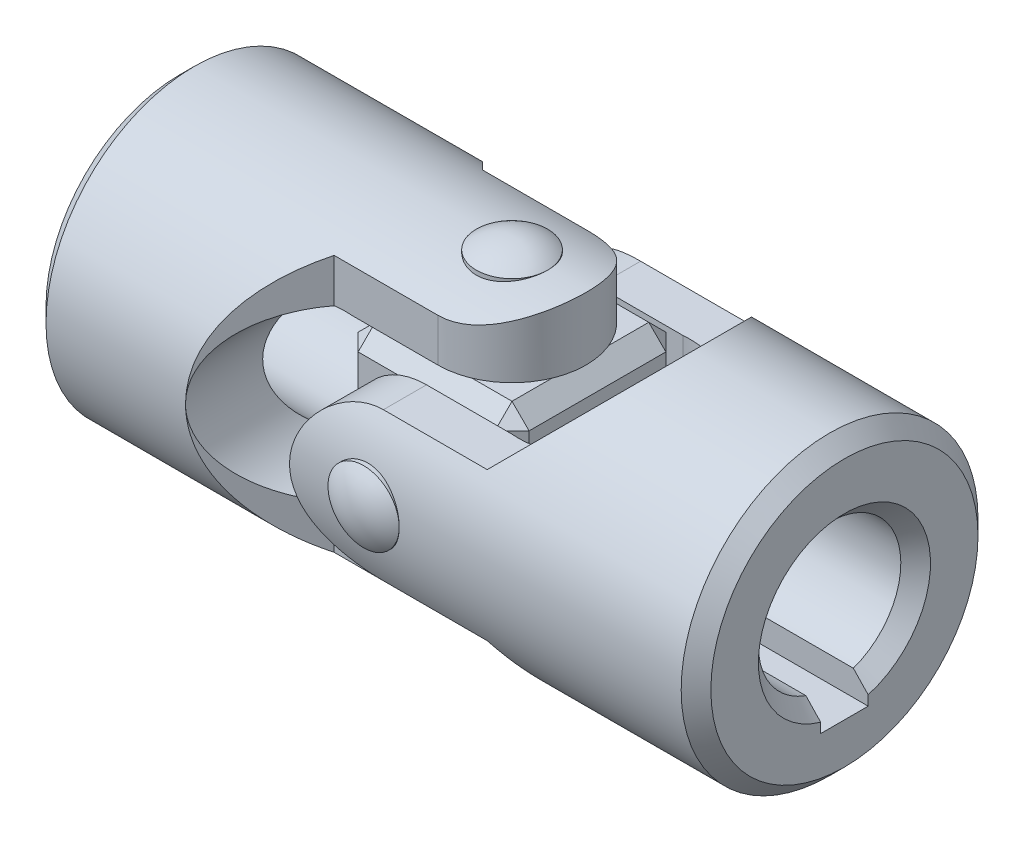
ISO-10303-21;
HEADER;
FILE_DESCRIPTION(('STEP AP214'),'2;1');
FILE_NAME('part.step','',(''),(''),'','','');
FILE_SCHEMA(('AUTOMOTIVE_DESIGN { 1 0 10303 214 1 1 1 1 }'));
ENDSEC;
DATA;
#1=APPLICATION_CONTEXT('core data for automotive mechanical design processes');
#2=APPLICATION_PROTOCOL_DEFINITION('international standard','automotive_design',2000,#1);
#3=PRODUCT_CONTEXT('',#1,'mechanical');
#4=PRODUCT('Part','Part','',(#3));
#5=PRODUCT_RELATED_PRODUCT_CATEGORY('part','',(#4));
#6=PRODUCT_DEFINITION_FORMATION('','',#4);
#7=PRODUCT_DEFINITION_CONTEXT('part definition',#1,'design');
#8=PRODUCT_DEFINITION('design','',#6,#7);
#9=PRODUCT_DEFINITION_SHAPE('','',#8);
#10=(LENGTH_UNIT() NAMED_UNIT(*) SI_UNIT(.MILLI.,.METRE.));
#11=(NAMED_UNIT(*) PLANE_ANGLE_UNIT() SI_UNIT($,.RADIAN.));
#12=(NAMED_UNIT(*) SI_UNIT($,.STERADIAN.) SOLID_ANGLE_UNIT());
#13=UNCERTAINTY_MEASURE_WITH_UNIT(LENGTH_MEASURE(1.E-05),#10,'distance_accuracy_value','');
#14=(GEOMETRIC_REPRESENTATION_CONTEXT(3) GLOBAL_UNCERTAINTY_ASSIGNED_CONTEXT((#13)) GLOBAL_UNIT_ASSIGNED_CONTEXT((#10,
#11,#12)) REPRESENTATION_CONTEXT('',''));
#15=CARTESIAN_POINT('',(0.,0.,0.));
#16=DIRECTION('',(0.,0.,1.));
#17=DIRECTION('',(1.,0.,0.));
#18=AXIS2_PLACEMENT_3D('',#15,#16,#17);
#19=CARTESIAN_POINT('',(0.,12.5,0.));
#20=DIRECTION('',(0.,-1.,0.));
#21=DIRECTION('',(-1.,0.,0.));
#22=AXIS2_PLACEMENT_3D('',#19,#20,#21);
#23=CYLINDRICAL_SURFACE('',#22,3.);
#24=CARTESIAN_POINT('',(0.,12.5,0.));
#25=DIRECTION('',(0.,1.,0.));
#26=DIRECTION('',(1.,0.,0.));
#27=AXIS2_PLACEMENT_3D('',#24,#25,#26);
#28=CIRCLE('',#27,3.);
#29=CARTESIAN_POINT('',(3.,12.5,0.));
#30=VERTEX_POINT('',#29);
#31=EDGE_CURVE('P0_E10',#30,#30,#28,.T.);
#32=ORIENTED_EDGE('',*,*,#31,.F.);
#33=EDGE_LOOP('',(#32));
#34=FACE_BOUND('',#33,.T.);
#35=CARTESIAN_POINT('',(0.,-12.5,0.));
#36=DIRECTION('',(0.,-1.,0.));
#37=DIRECTION('',(0.,0.,-1.));
#38=AXIS2_PLACEMENT_3D('',#35,#36,#37);
#39=CIRCLE('',#38,3.);
#40=CARTESIAN_POINT('',(0.,-12.5,-3.));
#41=VERTEX_POINT('',#40);
#42=EDGE_CURVE('P0_E20',#41,#41,#39,.T.);
#43=ORIENTED_EDGE('',*,*,#42,.F.);
#44=EDGE_LOOP('',(#43));
#45=FACE_BOUND('',#44,.T.);
#46=ADVANCED_FACE('P0_F14',(#34,#45),#23,.T.);
#47=CARTESIAN_POINT('',(0.,8.5,0.));
#48=DIRECTION('',(0.,-1.,0.));
#49=DIRECTION('',(0.,0.,-1.));
#50=AXIS2_PLACEMENT_3D('',#47,#48,#49);
#51=SPHERICAL_SURFACE('',#50,5.);
#52=ORIENTED_EDGE('',*,*,#31,.T.);
#53=EDGE_LOOP('',(#52));
#54=FACE_BOUND('',#53,.T.);
#55=ADVANCED_FACE('P0_F29',(#54),#51,.T.);
#56=CARTESIAN_POINT('',(0.,-8.5,0.));
#57=DIRECTION('',(0.,1.,0.));
#58=DIRECTION('',(0.,0.,-1.));
#59=AXIS2_PLACEMENT_3D('',#56,#57,#58);
#60=SPHERICAL_SURFACE('',#59,5.);
#61=ORIENTED_EDGE('',*,*,#42,.T.);
#62=EDGE_LOOP('',(#61));
#63=FACE_BOUND('',#62,.T.);
#64=ADVANCED_FACE('P0_F26',(#63),#60,.T.);
#65=CLOSED_SHELL('',(#46,#55,#64));
#66=MANIFOLD_SOLID_BREP('P0_B1',#65);
#67=CARTESIAN_POINT('',(0.,0.,12.5));
#68=DIRECTION('',(0.,0.,-1.));
#69=DIRECTION('',(-1.,0.,0.));
#70=AXIS2_PLACEMENT_3D('',#67,#68,#69);
#71=CYLINDRICAL_SURFACE('',#70,3.);
#72=CARTESIAN_POINT('',(0.,0.,12.5));
#73=DIRECTION('',(0.,0.,1.));
#74=DIRECTION('',(1.,0.,0.));
#75=AXIS2_PLACEMENT_3D('',#72,#73,#74);
#76=CIRCLE('',#75,3.);
#77=CARTESIAN_POINT('',(3.,0.,12.5));
#78=VERTEX_POINT('',#77);
#79=EDGE_CURVE('P1_E10',#78,#78,#76,.T.);
#80=ORIENTED_EDGE('',*,*,#79,.F.);
#81=EDGE_LOOP('',(#80));
#82=FACE_BOUND('',#81,.T.);
#83=CARTESIAN_POINT('',(0.,0.,-12.5));
#84=DIRECTION('',(0.,0.,-1.));
#85=DIRECTION('',(0.,1.,0.));
#86=AXIS2_PLACEMENT_3D('',#83,#84,#85);
#87=CIRCLE('',#86,3.);
#88=CARTESIAN_POINT('',(0.,3.,-12.5));
#89=VERTEX_POINT('',#88);
#90=EDGE_CURVE('P1_E20',#89,#89,#87,.T.);
#91=ORIENTED_EDGE('',*,*,#90,.F.);
#92=EDGE_LOOP('',(#91));
#93=FACE_BOUND('',#92,.T.);
#94=ADVANCED_FACE('P1_F14',(#82,#93),#71,.T.);
#95=CARTESIAN_POINT('',(0.,0.,8.5));
#96=DIRECTION('',(0.,0.,-1.));
#97=DIRECTION('',(0.,1.,0.));
#98=AXIS2_PLACEMENT_3D('',#95,#96,#97);
#99=SPHERICAL_SURFACE('',#98,5.);
#100=ORIENTED_EDGE('',*,*,#79,.T.);
#101=EDGE_LOOP('',(#100));
#102=FACE_BOUND('',#101,.T.);
#103=ADVANCED_FACE('P1_F29',(#102),#99,.T.);
#104=CARTESIAN_POINT('',(0.,0.,-8.5));
#105=DIRECTION('',(0.,0.,1.));
#106=DIRECTION('',(0.,1.,0.));
#107=AXIS2_PLACEMENT_3D('',#104,#105,#106);
#108=SPHERICAL_SURFACE('',#107,5.);
#109=ORIENTED_EDGE('',*,*,#90,.T.);
#110=EDGE_LOOP('',(#109));
#111=FACE_BOUND('',#110,.T.);
#112=ADVANCED_FACE('P1_F26',(#111),#108,.T.);
#113=CLOSED_SHELL('',(#94,#103,#112));
#114=MANIFOLD_SOLID_BREP('P1_B1',#113);
#115=CARTESIAN_POINT('',(0.,-12.5,-6.24));
#116=DIRECTION('',(0.,0.,1.));
#117=DIRECTION('',(1.,0.,0.));
#118=AXIS2_PLACEMENT_3D('',#115,#116,#117);
#119=PLANE('',#118);
#120=DIRECTION('',(0.,1.,0.));
#121=VECTOR('',#120,1.);
#122=CARTESIAN_POINT('',(0.,-12.5,-6.24));
#123=LINE('',#122,#121);
#124=CARTESIAN_POINT('',(0.,7.19999999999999,-6.24));
#125=VERTEX_POINT('',#124);
#126=CARTESIAN_POINT('',(0.,10.8310848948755,-6.24));
#127=VERTEX_POINT('',#126);
#128=EDGE_CURVE('P2_E349',#125,#127,#123,.T.);
#129=ORIENTED_EDGE('',*,*,#128,.F.);
#130=DIRECTION('',(-1.,0.,0.));
#131=VECTOR('',#130,1.);
#132=CARTESIAN_POINT('',(0.,7.19999999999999,-6.24));
#133=LINE('',#132,#131);
#134=CARTESIAN_POINT('',(-7.2,7.2,-6.24));
#135=VERTEX_POINT('',#134);
#136=EDGE_CURVE('P2_E179',#125,#135,#133,.T.);
#137=ORIENTED_EDGE('',*,*,#136,.T.);
#138=CARTESIAN_POINT('',(-7.77692307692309,0.,-6.24));
#139=DIRECTION('',(0.,0.,1.));
#140=DIRECTION('',(1.,0.,0.));
#141=AXIS2_PLACEMENT_3D('',#138,#139,#140);
#142=CIRCLE('',#141,7.22307692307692);
#143=CARTESIAN_POINT('',(-8.74000000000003,7.15858387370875,-6.24));
#144=VERTEX_POINT('',#143);
#145=EDGE_CURVE('P2_E196',#135,#144,#142,.T.);
#146=ORIENTED_EDGE('',*,*,#145,.T.);
#147=DIRECTION('',(0.,1.,0.));
#148=VECTOR('',#147,1.);
#149=CARTESIAN_POINT('',(-8.74000000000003,-12.5,-6.24));
#150=LINE('',#149,#148);
#151=CARTESIAN_POINT('',(-8.74000000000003,10.8310848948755,-6.24));
#152=VERTEX_POINT('',#151);
#153=EDGE_CURVE('P2_E356',#144,#152,#150,.T.);
#154=ORIENTED_EDGE('',*,*,#153,.T.);
#155=DIRECTION('',(1.,0.,0.));
#156=VECTOR('',#155,1.);
#157=CARTESIAN_POINT('',(-28.,10.8310848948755,-6.24));
#158=LINE('',#157,#156);
#159=EDGE_CURVE('P2_E283',#127,#152,#158,.F.);
#160=ORIENTED_EDGE('',*,*,#159,.F.);
#161=EDGE_LOOP('',(#129,#137,#146,#154,#160));
#162=FACE_BOUND('',#161,.T.);
#163=ADVANCED_FACE('P2_F16',(#162),#119,.F.);
#164=CARTESIAN_POINT('',(-8.74000000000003,-12.5,-6.24));
#165=DIRECTION('',(-0.707106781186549,0.,0.707106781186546));
#166=DIRECTION('',(0.707106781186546,0.,0.707106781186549));
#167=AXIS2_PLACEMENT_3D('',#164,#165,#166);
#168=PLANE('',#167);
#169=CARTESIAN_POINT('',(-2.50000000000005,0.,0.));
#170=DIRECTION('',(-0.707106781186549,0.,0.707106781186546));
#171=DIRECTION('',(0.707106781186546,0.,0.707106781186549));
#172=AXIS2_PLACEMENT_3D('',#169,#170,#171);
#173=ELLIPSE('',#172,17.6776695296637,12.5);
#174=CARTESIAN_POINT('',(-15.,0.,-12.5));
#175=VERTEX_POINT('',#174);
#176=CARTESIAN_POINT('',(-8.74000000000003,-10.8310848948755,-6.24));
#177=VERTEX_POINT('',#176);
#178=EDGE_CURVE('P2_E286',#175,#177,#173,.T.);
#179=ORIENTED_EDGE('',*,*,#178,.F.);
#180=CARTESIAN_POINT('',(-7.77692307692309,0.,-5.27692307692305));
#181=DIRECTION('',(-0.707106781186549,0.,0.707106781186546));
#182=DIRECTION('',(-0.707106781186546,0.,-0.707106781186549));
#183=AXIS2_PLACEMENT_3D('',#180,#181,#182);
#184=ELLIPSE('',#183,10.2149733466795,7.22307692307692);
#185=CARTESIAN_POINT('',(-8.74000000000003,-7.15858387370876,-6.24));
#186=VERTEX_POINT('',#185);
#187=EDGE_CURVE('P2_E192',#175,#186,#184,.T.);
#188=ORIENTED_EDGE('',*,*,#187,.T.);
#189=EDGE_CURVE('P2_E353',#177,#186,#150,.T.);
#190=ORIENTED_EDGE('',*,*,#189,.F.);
#191=EDGE_LOOP('',(#179,#188,#190));
#192=FACE_BOUND('',#191,.T.);
#193=ADVANCED_FACE('P2_F234',(#192),#168,.F.);
#194=CARTESIAN_POINT('',(-8.74000000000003,-12.5,6.24));
#195=DIRECTION('',(-0.707106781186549,0.,-0.707106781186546));
#196=DIRECTION('',(-0.707106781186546,0.,0.707106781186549));
#197=AXIS2_PLACEMENT_3D('',#194,#195,#196);
#198=PLANE('',#197);
#199=DIRECTION('',(0.,1.,0.));
#200=VECTOR('',#199,1.);
#201=CARTESIAN_POINT('',(-8.74000000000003,-12.5,6.24));
#202=LINE('',#201,#200);
#203=CARTESIAN_POINT('',(-8.74000000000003,-10.8310848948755,6.24));
#204=VERTEX_POINT('',#203);
#205=CARTESIAN_POINT('',(-8.74000000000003,-7.15858387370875,6.24));
#206=VERTEX_POINT('',#205);
#207=EDGE_CURVE('P2_E359',#204,#206,#202,.T.);
#208=ORIENTED_EDGE('',*,*,#207,.T.);
#209=CARTESIAN_POINT('',(-7.77692307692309,0.,5.27692307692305));
#210=DIRECTION('',(-0.707106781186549,0.,-0.707106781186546));
#211=DIRECTION('',(0.707106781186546,0.,-0.707106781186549));
#212=AXIS2_PLACEMENT_3D('',#209,#210,#211);
#213=ELLIPSE('',#212,10.2149733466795,7.22307692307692);
#214=CARTESIAN_POINT('',(-15.,0.,12.5));
#215=VERTEX_POINT('',#214);
#216=EDGE_CURVE('P2_E188',#206,#215,#213,.T.);
#217=ORIENTED_EDGE('',*,*,#216,.T.);
#218=CARTESIAN_POINT('',(-2.50000000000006,0.,0.));
#219=DIRECTION('',(-0.707106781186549,0.,-0.707106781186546));
#220=DIRECTION('',(0.707106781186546,0.,-0.707106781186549));
#221=AXIS2_PLACEMENT_3D('',#218,#219,#220);
#222=ELLIPSE('',#221,17.6776695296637,12.5);
#223=EDGE_CURVE('P2_E297',#204,#215,#222,.T.);
#224=ORIENTED_EDGE('',*,*,#223,.F.);
#225=EDGE_LOOP('',(#208,#217,#224));
#226=FACE_BOUND('',#225,.T.);
#227=ADVANCED_FACE('P2_F239',(#226),#198,.F.);
#228=CARTESIAN_POINT('',(0.,-12.5,6.24));
#229=DIRECTION('',(0.,0.,-1.));
#230=DIRECTION('',(-1.,0.,0.));
#231=AXIS2_PLACEMENT_3D('',#228,#229,#230);
#232=PLANE('',#231);
#233=CARTESIAN_POINT('',(-7.77692307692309,0.,6.24));
#234=DIRECTION('',(0.,0.,-1.));
#235=DIRECTION('',(-1.,0.,0.));
#236=AXIS2_PLACEMENT_3D('',#233,#234,#235);
#237=CIRCLE('',#236,7.22307692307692);
#238=CARTESIAN_POINT('',(-8.74000000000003,7.15858387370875,6.24));
#239=VERTEX_POINT('',#238);
#240=CARTESIAN_POINT('',(-7.2,7.2,6.24));
#241=VERTEX_POINT('',#240);
#242=EDGE_CURVE('P2_E311',#239,#241,#237,.T.);
#243=ORIENTED_EDGE('',*,*,#242,.T.);
#244=DIRECTION('',(1.,0.,0.));
#245=VECTOR('',#244,1.);
#246=CARTESIAN_POINT('',(0.,7.19999999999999,6.24));
#247=LINE('',#246,#245);
#248=CARTESIAN_POINT('',(0.,7.19999999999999,6.24));
#249=VERTEX_POINT('',#248);
#250=EDGE_CURVE('P2_E176',#241,#249,#247,.T.);
#251=ORIENTED_EDGE('',*,*,#250,.T.);
#252=DIRECTION('',(0.,1.,0.));
#253=VECTOR('',#252,1.);
#254=CARTESIAN_POINT('',(0.,-12.5,6.24));
#255=LINE('',#254,#253);
#256=CARTESIAN_POINT('',(0.,10.8310848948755,6.24));
#257=VERTEX_POINT('',#256);
#258=EDGE_CURVE('P2_E204',#249,#257,#255,.T.);
#259=ORIENTED_EDGE('',*,*,#258,.T.);
#260=DIRECTION('',(1.,0.,0.));
#261=VECTOR('',#260,1.);
#262=CARTESIAN_POINT('',(-28.,10.8310848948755,6.24));
#263=LINE('',#262,#261);
#264=CARTESIAN_POINT('',(-8.74000000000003,10.8310848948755,6.24));
#265=VERTEX_POINT('',#264);
#266=EDGE_CURVE('P2_E300',#265,#257,#263,.T.);
#267=ORIENTED_EDGE('',*,*,#266,.F.);
#268=EDGE_CURVE('P2_E361',#239,#265,#202,.T.);
#269=ORIENTED_EDGE('',*,*,#268,.F.);
#270=EDGE_LOOP('',(#243,#251,#259,#267,#269));
#271=FACE_BOUND('',#270,.T.);
#272=ADVANCED_FACE('P2_F243',(#271),#232,.F.);
#273=CARTESIAN_POINT('',(0.,-12.5,0.));
#274=DIRECTION('',(0.,1.,0.));
#275=DIRECTION('',(0.,0.,-1.));
#276=AXIS2_PLACEMENT_3D('',#273,#274,#275);
#277=CYLINDRICAL_SURFACE('',#276,6.24);
#278=ORIENTED_EDGE('',*,*,#258,.F.);
#279=CARTESIAN_POINT('',(0.,7.19999999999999,0.));
#280=DIRECTION('',(0.,1.,0.));
#281=DIRECTION('',(1.,0.,0.));
#282=AXIS2_PLACEMENT_3D('',#279,#280,#281);
#283=CIRCLE('',#282,6.24);
#284=EDGE_CURVE('P2_E305',#249,#125,#283,.T.);
#285=ORIENTED_EDGE('',*,*,#284,.T.);
#286=ORIENTED_EDGE('',*,*,#128,.T.);
#287=CARTESIAN_POINT('',(0.,10.8310848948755,6.24));
#288=CARTESIAN_POINT('',(0.163456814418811,10.83103605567,6.24003072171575));
#289=CARTESIAN_POINT('',(0.326890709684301,10.8347835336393,6.23357884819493));
#290=CARTESIAN_POINT('',(0.652332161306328,10.8495074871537,6.20794528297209));
#291=CARTESIAN_POINT('',(0.814340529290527,10.860479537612,6.18877138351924));
#292=CARTESIAN_POINT('',(1.13483511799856,10.8892074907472,6.13807390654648));
#293=CARTESIAN_POINT('',(1.29333617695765,10.9069242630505,6.10662153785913));
#294=CARTESIAN_POINT('',(1.60667183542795,10.9485017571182,6.03176194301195));
#295=CARTESIAN_POINT('',(1.76150601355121,10.972363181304,5.98835335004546));
#296=CARTESIAN_POINT('',(2.06617229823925,11.0253803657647,5.89016839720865));
#297=CARTESIAN_POINT('',(2.21601544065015,11.0545233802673,5.8354193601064));
#298=CARTESIAN_POINT('',(2.51030779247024,11.1172544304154,5.71500352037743));
#299=CARTESIAN_POINT('',(2.65475491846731,11.1508441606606,5.64933255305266));
#300=CARTESIAN_POINT('',(3.07924477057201,11.2569589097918,5.43654316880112));
#301=CARTESIAN_POINT('',(3.35026460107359,11.3347979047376,5.27370406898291));
#302=CARTESIAN_POINT('',(3.88424363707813,11.5034875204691,4.8955131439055));
#303=CARTESIAN_POINT('',(4.1447451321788,11.5948815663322,4.67696285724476));
#304=CARTESIAN_POINT('',(4.62739257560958,11.7760405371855,4.19997354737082));
#305=CARTESIAN_POINT('',(4.84952814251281,11.8658050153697,3.94152376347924));
#306=CARTESIAN_POINT('',(5.15659303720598,11.9955620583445,3.51857019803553));
#307=CARTESIAN_POINT('',(5.25724092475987,12.0392644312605,3.36637250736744));
#308=CARTESIAN_POINT('',(5.44523462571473,12.1225356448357,3.05292785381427));
#309=CARTESIAN_POINT('',(5.53258608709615,12.162106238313,2.89168477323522));
#310=CARTESIAN_POINT('',(5.69312545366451,12.2359715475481,2.56118606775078));
#311=CARTESIAN_POINT('',(5.76631669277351,12.2702675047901,2.39193234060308));
#312=CARTESIAN_POINT('',(5.8977278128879,12.3325683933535,2.04658833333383));
#313=CARTESIAN_POINT('',(5.95594927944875,12.360573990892,1.87049877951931));
#314=CARTESIAN_POINT('',(6.05309176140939,12.4076850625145,1.52560285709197));
#315=CARTESIAN_POINT('',(6.09308915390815,12.4272810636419,1.35716631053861));
#316=CARTESIAN_POINT('',(6.15901746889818,12.4597379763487,1.01691947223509));
#317=CARTESIAN_POINT('',(6.18494900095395,12.4725991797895,0.845109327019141));
#318=CARTESIAN_POINT('',(6.2223910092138,12.4912083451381,0.499626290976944));
#319=CARTESIAN_POINT('',(6.23390857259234,12.4969598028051,0.325954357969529));
#320=CARTESIAN_POINT('',(6.24238525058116,12.5011902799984,-0.0218286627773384));
#321=CARTESIAN_POINT('',(6.23934525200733,12.4996697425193,-0.195939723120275));
#322=CARTESIAN_POINT('',(6.21965099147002,12.4898517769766,-0.527966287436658));
#323=CARTESIAN_POINT('',(6.20420414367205,12.4821554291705,-0.685972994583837));
#324=CARTESIAN_POINT('',(6.16138628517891,12.4609283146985,-1.00002028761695));
#325=CARTESIAN_POINT('',(6.13401123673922,12.4473955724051,-1.15606018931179));
#326=CARTESIAN_POINT('',(6.06764661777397,12.4148258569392,-1.46499791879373));
#327=CARTESIAN_POINT('',(6.02866128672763,12.39579089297,-1.61789687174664));
#328=CARTESIAN_POINT('',(5.93945429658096,12.3526512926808,-1.91970251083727));
#329=CARTESIAN_POINT('',(5.88922833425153,12.3285447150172,-2.06860764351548));
#330=CARTESIAN_POINT('',(5.77726100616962,12.2754503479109,-2.36348336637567));
#331=CARTESIAN_POINT('',(5.7153739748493,12.246401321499,-2.50938763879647));
#332=CARTESIAN_POINT('',(5.58106814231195,12.1843007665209,-2.79540222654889));
#333=CARTESIAN_POINT('',(5.50864553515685,12.1512477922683,-2.93551042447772));
#334=CARTESIAN_POINT('',(5.27638038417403,12.0471306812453,-3.34606495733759));
#335=CARTESIAN_POINT('',(5.10147378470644,11.9710757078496,-3.60691545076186));
#336=CARTESIAN_POINT('',(4.69783517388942,11.8044532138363,-4.12126974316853));
#337=CARTESIAN_POINT('',(4.46558433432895,11.7131934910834,-4.37176534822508));
#338=CARTESIAN_POINT('',(3.96297095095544,11.5309486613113,-4.83203036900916));
#339=CARTESIAN_POINT('',(3.69257465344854,11.4399638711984,-5.04176332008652));
#340=CARTESIAN_POINT('',(3.25338074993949,11.3082133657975,-5.32788347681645));
#341=CARTESIAN_POINT('',(3.09617562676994,11.2638539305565,-5.42077424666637));
#342=CARTESIAN_POINT('',(2.77334744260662,11.1794279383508,-5.59281276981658));
#343=CARTESIAN_POINT('',(2.60772812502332,11.1393594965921,-5.67196656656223));
#344=CARTESIAN_POINT('',(2.2693462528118,11.0650421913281,-5.81561567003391));
#345=CARTESIAN_POINT('',(2.09659719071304,11.0307829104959,-5.88013728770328));
#346=CARTESIAN_POINT('',(1.7450017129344,10.9693871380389,-5.9938897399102));
#347=CARTESIAN_POINT('',(1.56615797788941,10.9422475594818,-6.04312720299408));
#348=CARTESIAN_POINT('',(1.15928061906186,10.8906576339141,-6.135723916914));
#349=CARTESIAN_POINT('',(0.929918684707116,10.8684902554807,-6.1746968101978));
#350=CARTESIAN_POINT('',(0.582953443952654,10.846142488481,-6.21380630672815));
#351=CARTESIAN_POINT('',(0.466690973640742,10.8405102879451,-6.22361793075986));
#352=CARTESIAN_POINT('',(0.233631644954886,10.8329770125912,-6.23671706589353));
#353=CARTESIAN_POINT('',(0.116834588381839,10.831077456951,-6.24000192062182));
#354=CARTESIAN_POINT('',(0.,10.8310848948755,-6.24));
#355=B_SPLINE_CURVE_WITH_KNOTS('',3,(#287,#288,#289,#290,#291,#292,#293,#294,#295,#296,#297,
#298,#299,#300,#301,#302,#303,#304,#305,#306,#307,#308,#309,#310,#311,#312,#313,#314,#315,#316,
#317,#318,#319,#320,#321,#322,#323,#324,#325,#326,#327,#328,#329,#330,#331,#332,#333,#334,#335,
#336,#337,#338,#339,#340,#341,#342,#343,#344,#345,#346,#347,#348,#349,#350,#351,#352,#353,#354),
.UNSPECIFIED.,.F.,.F.,(4,2,2,2,2,2,2,2,2,2,2,2,2,2,2,2,2,2,2,2,2,2,2,2,2,2,2,2,2,2,2,2,2,4),(0.,
0.490164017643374,0.980028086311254,1.46709241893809,1.95421245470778,2.44017223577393,
2.92631774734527,3.89915165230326,4.95128247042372,6.00369753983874,6.56596661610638,
7.12799618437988,7.68989326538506,8.25173080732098,8.7737013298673,9.29564923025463,
9.81734039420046,10.3389997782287,10.8152761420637,11.291713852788,11.7679778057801,
12.2444243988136,12.7272730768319,13.2102966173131,14.1757816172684,15.2322399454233,
16.2896390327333,16.8527525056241,17.4156176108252,17.9774624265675,18.5390632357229,
19.238082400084,19.5883086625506,19.9386774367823),.UNSPECIFIED.);
#356=EDGE_CURVE('P2_E258',#257,#127,#355,.T.);
#357=ORIENTED_EDGE('',*,*,#356,.F.);
#358=EDGE_LOOP('',(#278,#285,#286,#357));
#359=FACE_BOUND('',#358,.T.);
#360=ADVANCED_FACE('P2_F247',(#359),#277,.T.);
#361=CARTESIAN_POINT('',(-28.,0.,0.));
#362=DIRECTION('',(-1.,0.,0.));
#363=DIRECTION('',(0.,0.,1.));
#364=AXIS2_PLACEMENT_3D('',#361,#362,#363);
#365=PLANE('',#364);
#366=DIRECTION('',(0.,0.,1.));
#367=VECTOR('',#366,1.);
#368=CARTESIAN_POINT('',(-28.,-2.,-7.8));
#369=LINE('',#368,#367);
#370=CARTESIAN_POINT('',(-28.,-2.,-7.8));
#371=VERTEX_POINT('',#370);
#372=CARTESIAN_POINT('',(-28.,-2.,-6.96867993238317));
#373=VERTEX_POINT('',#372);
#374=EDGE_CURVE('P2_E139',#371,#373,#369,.T.);
#375=ORIENTED_EDGE('',*,*,#374,.F.);
#376=DIRECTION('',(0.,-1.,0.));
#377=VECTOR('',#376,1.);
#378=CARTESIAN_POINT('',(-28.,-2.,-7.8));
#379=LINE('',#378,#377);
#380=CARTESIAN_POINT('',(-28.,2.,-7.8));
#381=VERTEX_POINT('',#380);
#382=EDGE_CURVE('P2_E135',#381,#371,#379,.T.);
#383=ORIENTED_EDGE('',*,*,#382,.F.);
#384=DIRECTION('',(0.,0.,-1.));
#385=VECTOR('',#384,1.);
#386=CARTESIAN_POINT('',(-28.,2.,-7.8));
#387=LINE('',#386,#385);
#388=CARTESIAN_POINT('',(-28.,2.,-6.96867993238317));
#389=VERTEX_POINT('',#388);
#390=EDGE_CURVE('P2_E142',#389,#381,#387,.T.);
#391=ORIENTED_EDGE('',*,*,#390,.F.);
#392=CARTESIAN_POINT('',(-28.,0.,0.));
#393=DIRECTION('',(-1.,0.,0.));
#394=DIRECTION('',(0.,0.,1.));
#395=AXIS2_PLACEMENT_3D('',#392,#393,#394);
#396=CIRCLE('',#395,7.24999999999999);
#397=EDGE_CURVE('P2_E318',#389,#373,#396,.F.);
#398=ORIENTED_EDGE('',*,*,#397,.T.);
#399=EDGE_LOOP('',(#375,#383,#391,#398));
#400=FACE_BOUND('',#399,.T.);
#401=CARTESIAN_POINT('',(-28.,0.,0.));
#402=DIRECTION('',(-1.,0.,0.));
#403=DIRECTION('',(0.,0.,1.));
#404=AXIS2_PLACEMENT_3D('',#401,#402,#403);
#405=CIRCLE('',#404,11.25);
#406=CARTESIAN_POINT('',(-28.,0.,11.25));
#407=VERTEX_POINT('',#406);
#408=EDGE_CURVE('P2_E315',#407,#407,#405,.T.);
#409=ORIENTED_EDGE('',*,*,#408,.T.);
#410=EDGE_LOOP('',(#409));
#411=FACE_BOUND('',#410,.T.);
#412=ADVANCED_FACE('P2_F149',(#400,#411),#365,.T.);
#413=CARTESIAN_POINT('',(-28.,0.,0.));
#414=DIRECTION('',(1.,0.,0.));
#415=DIRECTION('',(0.,0.,-1.));
#416=AXIS2_PLACEMENT_3D('',#413,#414,#415);
#417=CYLINDRICAL_SURFACE('',#416,12.5);
#418=CARTESIAN_POINT('',(-26.75,0.,0.));
#419=DIRECTION('',(-1.,0.,0.));
#420=DIRECTION('',(0.,0.,1.));
#421=AXIS2_PLACEMENT_3D('',#418,#419,#420);
#422=CIRCLE('',#421,12.5);
#423=CARTESIAN_POINT('',(-26.75,0.,12.5));
#424=VERTEX_POINT('',#423);
#425=EDGE_CURVE('P2_E320',#424,#424,#422,.F.);
#426=ORIENTED_EDGE('',*,*,#425,.T.);
#427=EDGE_LOOP('',(#426));
#428=FACE_BOUND('',#427,.T.);
#429=CARTESIAN_POINT('',(3.,-12.5,0.));
#430=CARTESIAN_POINT('',(2.99999497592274,-12.4999970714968,-0.165963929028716));
#431=CARTESIAN_POINT('',(2.98618158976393,-12.4966615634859,-0.331985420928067));
#432=CARTESIAN_POINT('',(2.93136726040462,-12.4836783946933,-0.65928429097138));
#433=CARTESIAN_POINT('',(2.89034957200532,-12.4740268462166,-0.820558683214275));
#434=CARTESIAN_POINT('',(2.78250766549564,-12.4494823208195,-1.13358839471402));
#435=CARTESIAN_POINT('',(2.71571311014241,-12.4345953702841,-1.28535442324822));
#436=CARTESIAN_POINT('',(2.55831456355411,-12.4011725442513,-1.57552517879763));
#437=CARTESIAN_POINT('',(2.46771023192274,-12.3826366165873,-1.71392971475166));
#438=CARTESIAN_POINT('',(2.26343582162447,-12.3435386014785,-1.97609263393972));
#439=CARTESIAN_POINT('',(2.14939721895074,-12.3229472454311,-2.0995595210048));
#440=CARTESIAN_POINT('',(1.90228113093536,-12.2822574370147,-2.32581080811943));
#441=CARTESIAN_POINT('',(1.76920165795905,-12.2621590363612,-2.42859304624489));
#442=CARTESIAN_POINT('',(1.48555416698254,-12.224437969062,-2.61189993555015));
#443=CARTESIAN_POINT('',(1.33477341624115,-12.2068525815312,-2.69210377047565));
#444=CARTESIAN_POINT('',(1.02138016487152,-12.1765733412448,-2.82591582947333));
#445=CARTESIAN_POINT('',(0.858769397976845,-12.1638787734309,-2.87952794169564));
#446=CARTESIAN_POINT('',(0.529523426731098,-12.1451184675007,-2.95765058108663));
#447=CARTESIAN_POINT('',(0.363018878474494,-12.1389341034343,-2.98268262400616));
#448=CARTESIAN_POINT('',(0.0280676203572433,-12.1335389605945,-3.00455808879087));
#449=CARTESIAN_POINT('',(-0.140378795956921,-12.1343271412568,-3.00140571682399));
#450=CARTESIAN_POINT('',(-0.47047596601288,-12.1426811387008,-2.96741912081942));
#451=CARTESIAN_POINT('',(-0.632194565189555,-12.1500960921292,-2.93720103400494));
#452=CARTESIAN_POINT('',(-0.948197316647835,-12.1706283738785,-2.85092141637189));
#453=CARTESIAN_POINT('',(-1.10248097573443,-12.1837460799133,-2.79485817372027));
#454=CARTESIAN_POINT('',(-1.40091297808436,-12.2143476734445,-2.65794121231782));
#455=CARTESIAN_POINT('',(-1.54495245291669,-12.2318714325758,-2.5768594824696));
#456=CARTESIAN_POINT('',(-1.81760450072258,-12.2692875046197,-2.39236688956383));
#457=CARTESIAN_POINT('',(-1.94621456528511,-12.2891802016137,-2.28895240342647));
#458=CARTESIAN_POINT('',(-2.18789357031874,-12.329732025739,-2.05951493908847));
#459=CARTESIAN_POINT('',(-2.30046709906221,-12.3503975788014,-1.93297064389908));
#460=CARTESIAN_POINT('',(-2.50288471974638,-12.3896951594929,-1.66255592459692));
#461=CARTESIAN_POINT('',(-2.59272822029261,-12.4083271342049,-1.51868504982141));
#462=CARTESIAN_POINT('',(-2.74729722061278,-12.4415394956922,-1.21702847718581));
#463=CARTESIAN_POINT('',(-2.81194745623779,-12.4561077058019,-1.05920278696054));
#464=CARTESIAN_POINT('',(-2.91366507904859,-12.4794620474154,-0.734497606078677));
#465=CARTESIAN_POINT('',(-2.95073731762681,-12.4882491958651,-0.567619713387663));
#466=CARTESIAN_POINT('',(-2.99550206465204,-12.4989027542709,-0.233787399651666));
#467=CARTESIAN_POINT('',(-3.00386989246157,-12.5009282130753,-0.0669284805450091));
#468=CARTESIAN_POINT('',(-2.9928332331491,-12.4982807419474,0.265804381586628));
#469=CARTESIAN_POINT('',(-2.97343103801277,-12.4936083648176,0.431678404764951));
#470=CARTESIAN_POINT('',(-2.90796302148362,-12.4781916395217,0.755422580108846));
#471=CARTESIAN_POINT('',(-2.8622608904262,-12.4675301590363,0.913370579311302));
#472=CARTESIAN_POINT('',(-2.74590180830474,-12.4413335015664,1.21935330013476));
#473=CARTESIAN_POINT('',(-2.6752424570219,-12.4257978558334,1.3673870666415));
#474=CARTESIAN_POINT('',(-2.50963340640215,-12.3911910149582,1.6520615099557));
#475=CARTESIAN_POINT('',(-2.41429928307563,-12.3720653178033,1.78847176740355));
#476=CARTESIAN_POINT('',(-2.20254307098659,-12.3324936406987,2.04359904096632));
#477=CARTESIAN_POINT('',(-2.08611764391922,-12.3120474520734,2.16231325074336));
#478=CARTESIAN_POINT('',(-1.83235916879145,-12.2715742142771,2.38142453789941));
#479=CARTESIAN_POINT('',(-1.6946148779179,-12.2515669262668,2.48134974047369));
#480=CARTESIAN_POINT('',(-1.40390957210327,-12.2147538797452,2.65666020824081));
#481=CARTESIAN_POINT('',(-1.25094923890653,-12.1979479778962,2.7320465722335));
#482=CARTESIAN_POINT('',(-0.934987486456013,-12.1696189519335,2.85558993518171));
#483=CARTESIAN_POINT('',(-0.772051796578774,-12.1580647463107,2.90390754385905));
#484=CARTESIAN_POINT('',(-0.440053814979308,-12.1415072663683,2.97238380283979));
#485=CARTESIAN_POINT('',(-0.270992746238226,-12.1365026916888,2.99254804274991));
#486=CARTESIAN_POINT('',(0.0636707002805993,-12.1337046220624,3.00387066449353));
#487=CARTESIAN_POINT('',(0.229246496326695,-12.1357241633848,2.99578106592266));
#488=CARTESIAN_POINT('',(0.556599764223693,-12.1463176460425,2.95253345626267));
#489=CARTESIAN_POINT('',(0.718377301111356,-12.1548914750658,2.91737590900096));
#490=CARTESIAN_POINT('',(1.03279755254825,-12.1775274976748,2.82138591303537));
#491=CARTESIAN_POINT('',(1.18548227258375,-12.191561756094,2.76068402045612));
#492=CARTESIAN_POINT('',(1.47860441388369,-12.2235433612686,2.61543373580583));
#493=CARTESIAN_POINT('',(1.61904026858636,-12.2414912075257,2.53088229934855));
#494=CARTESIAN_POINT('',(1.88733700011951,-12.279819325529,2.33793007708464));
#495=CARTESIAN_POINT('',(2.01481232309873,-12.3002478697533,2.22900267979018));
#496=CARTESIAN_POINT('',(2.24991998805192,-12.3409359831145,1.99143074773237));
#497=CARTESIAN_POINT('',(2.35754766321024,-12.361195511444,1.86278158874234));
#498=CARTESIAN_POINT('',(2.55160925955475,-12.3996570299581,1.5868829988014));
#499=CARTESIAN_POINT('',(2.637668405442,-12.4178200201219,1.43936414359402));
#500=CARTESIAN_POINT('',(2.78362953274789,-12.4496380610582,1.13153622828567));
#501=CARTESIAN_POINT('',(2.84355134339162,-12.4632965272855,0.971236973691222));
#502=CARTESIAN_POINT('',(2.92603862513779,-12.4824059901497,0.675887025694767));
#503=CARTESIAN_POINT('',(2.9537166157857,-12.4889599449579,0.542312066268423));
#504=CARTESIAN_POINT('',(2.99069878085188,-12.4977580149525,0.272504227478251));
#505=CARTESIAN_POINT('',(3.00000412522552,-12.5000024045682,0.136271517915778));
#506=CARTESIAN_POINT('',(3.,-12.5,0.));
#507=B_SPLINE_CURVE_WITH_KNOTS('',3,(#429,#430,#431,#432,#433,#434,#435,#436,#437,#438,#439,
#440,#441,#442,#443,#444,#445,#446,#447,#448,#449,#450,#451,#452,#453,#454,#455,#456,#457,#458,
#459,#460,#461,#462,#463,#464,#465,#466,#467,#468,#469,#470,#471,#472,#473,#474,#475,#476,#477,
#478,#479,#480,#481,#482,#483,#484,#485,#486,#487,#488,#489,#490,#491,#492,#493,#494,#495,#496,
#497,#498,#499,#500,#501,#502,#503,#504,#505,#506),.UNSPECIFIED.,.T.,.F.,(4,2,2,2,2,2,2,2,2,2,2,
2,2,2,2,2,2,2,2,2,2,2,2,2,2,2,2,2,2,2,2,2,2,2,2,2,2,2,4),(0.,0.497392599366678,
0.995091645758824,1.49221966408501,1.98935478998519,2.49500570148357,3.00070943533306,
3.51327262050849,4.02576083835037,4.52873995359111,5.03164400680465,5.52338274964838,
6.01515406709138,6.51154667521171,7.00801987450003,7.51749958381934,8.0269925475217,
8.53799614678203,9.04890983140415,9.54771776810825,10.0464845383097,10.5385143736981,
11.0305915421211,11.5308523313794,12.031192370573,12.5427824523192,13.0543496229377,
13.5628484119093,14.0712462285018,14.5662165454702,15.0611783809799,15.5536406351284,
16.0461657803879,16.5505844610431,17.0551215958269,17.5678974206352,18.0802835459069,
18.4887142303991,18.897118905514),.UNSPECIFIED.);
#508=CARTESIAN_POINT('',(3.,-12.5,0.));
#509=VERTEX_POINT('',#508);
#510=EDGE_CURVE('P2_E278',#509,#509,#507,.T.);
#511=ORIENTED_EDGE('',*,*,#510,.T.);
#512=EDGE_LOOP('',(#511));
#513=FACE_BOUND('',#512,.T.);
#514=CARTESIAN_POINT('',(0.,12.1346610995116,-3.));
#515=CARTESIAN_POINT('',(0.165886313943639,12.1346643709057,-2.999994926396));
#516=CARTESIAN_POINT('',(0.331830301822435,12.1380998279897,-2.98619401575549));
#517=CARTESIAN_POINT('',(0.658968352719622,12.1514386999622,-2.93143372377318));
#518=CARTESIAN_POINT('',(0.820159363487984,12.1613461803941,-2.89045727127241));
#519=CARTESIAN_POINT('',(1.13301229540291,12.1864438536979,-2.78273587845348));
#520=CARTESIAN_POINT('',(1.28468563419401,12.2016275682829,-2.71602252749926));
#521=CARTESIAN_POINT('',(1.57469954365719,12.2355589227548,-2.55881551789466));
#522=CARTESIAN_POINT('',(1.71303982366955,12.2543066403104,-2.46832134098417));
#523=CARTESIAN_POINT('',(1.97526881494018,12.2936793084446,-2.26416092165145));
#524=CARTESIAN_POINT('',(2.09884715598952,12.3143323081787,-2.15010136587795));
#525=CARTESIAN_POINT('',(2.32531539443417,12.3549444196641,-1.90289576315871));
#526=CARTESIAN_POINT('',(2.42820347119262,12.3749034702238,-1.7697480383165));
#527=CARTESIAN_POINT('',(2.61162643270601,12.4121875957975,-1.48603435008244));
#528=CARTESIAN_POINT('',(2.69185852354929,12.429475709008,-1.33526735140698));
#529=CARTESIAN_POINT('',(2.82572653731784,12.4591511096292,-1.02190364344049));
#530=CARTESIAN_POINT('',(2.87936606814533,12.471539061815,-0.859308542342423));
#531=CARTESIAN_POINT('',(2.95753815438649,12.4898200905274,-0.530137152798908));
#532=CARTESIAN_POINT('',(2.98259721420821,12.4958305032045,-0.363692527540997));
#533=CARTESIAN_POINT('',(3.00454751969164,12.5010873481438,-0.0288605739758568));
#534=CARTESIAN_POINT('',(3.00144261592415,12.5003347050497,0.139526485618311));
#535=CARTESIAN_POINT('',(2.96753629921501,12.4922383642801,0.469819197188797));
#536=CARTESIAN_POINT('',(2.93730291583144,12.4850298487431,0.631786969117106));
#537=CARTESIAN_POINT('',(2.85090826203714,12.4649879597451,0.948279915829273));
#538=CARTESIAN_POINT('',(2.79474567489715,12.4521543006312,1.10280471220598));
#539=CARTESIAN_POINT('',(2.65761316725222,12.4220937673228,1.40154850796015));
#540=CARTESIAN_POINT('',(2.57643674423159,12.4048305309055,1.54566890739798));
#541=CARTESIAN_POINT('',(2.39173656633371,12.3677903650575,1.8184437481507));
#542=CARTESIAN_POINT('',(2.28820919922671,12.3480130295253,1.94709568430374));
#543=CARTESIAN_POINT('',(2.0586845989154,12.307523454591,2.18866676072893));
#544=CARTESIAN_POINT('',(1.93219063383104,12.2868002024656,2.30111257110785));
#545=CARTESIAN_POINT('',(1.66192436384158,12.247210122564,2.50329554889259));
#546=CARTESIAN_POINT('',(1.51815137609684,12.2283433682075,2.59303181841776));
#547=CARTESIAN_POINT('',(1.21653474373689,12.1945661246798,2.74751986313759));
#548=CARTESIAN_POINT('',(1.05863494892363,12.1796724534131,2.81216594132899));
#549=CARTESIAN_POINT('',(0.733766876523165,12.155748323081,2.91385324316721));
#550=CARTESIAN_POINT('',(0.566800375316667,12.1467167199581,2.95089985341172));
#551=CARTESIAN_POINT('',(0.232906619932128,12.1357772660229,2.99556850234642));
#552=CARTESIAN_POINT('',(0.0660779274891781,12.1337008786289,3.0038868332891));
#553=CARTESIAN_POINT('',(-0.266583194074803,12.1364495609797,2.99276203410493));
#554=CARTESIAN_POINT('',(-0.432415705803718,12.1412740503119,2.97332123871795));
#555=CARTESIAN_POINT('',(-0.75584591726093,12.1571201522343,2.90783852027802));
#556=CARTESIAN_POINT('',(-0.913529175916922,12.1680489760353,2.86219461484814));
#557=CARTESIAN_POINT('',(-1.21900782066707,12.1947857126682,2.74603914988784));
#558=CARTESIAN_POINT('',(-1.3668021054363,12.2105941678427,2.6755248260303));
#559=CARTESIAN_POINT('',(-1.65127875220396,12.2456689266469,2.51014743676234));
#560=CARTESIAN_POINT('',(-1.78770937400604,12.2649930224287,2.41486385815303));
#561=CARTESIAN_POINT('',(-2.04290073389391,12.3047764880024,2.2031905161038));
#562=CARTESIAN_POINT('',(-2.16165880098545,12.3252360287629,2.08679756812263));
#563=CARTESIAN_POINT('',(-2.38091500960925,12.3655511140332,1.8330286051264));
#564=CARTESIAN_POINT('',(-2.48093375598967,12.3853821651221,1.69523379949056));
#565=CARTESIAN_POINT('',(-2.65640846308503,12.4217193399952,1.40439761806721));
#566=CARTESIAN_POINT('',(-2.73186567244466,12.438225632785,1.25135701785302));
#567=CARTESIAN_POINT('',(-2.85544747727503,12.4659520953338,0.935406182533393));
#568=CARTESIAN_POINT('',(-2.90376232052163,12.4772089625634,0.772573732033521));
#569=CARTESIAN_POINT('',(-2.97226782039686,12.4933282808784,0.440797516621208));
#570=CARTESIAN_POINT('',(-2.99246345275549,12.4981918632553,0.271854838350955));
#571=CARTESIAN_POINT('',(-3.00389586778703,12.5009346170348,-0.0628273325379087));
#572=CARTESIAN_POINT('',(-2.9958427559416,12.4989850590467,-0.228541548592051));
#573=CARTESIAN_POINT('',(-2.95262003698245,12.4886960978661,-0.556181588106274));
#574=CARTESIAN_POINT('',(-2.91745112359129,12.4803568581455,-0.718107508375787));
#575=CARTESIAN_POINT('',(-2.8213631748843,12.4582475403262,-1.03289533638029));
#576=CARTESIAN_POINT('',(-2.76056343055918,12.4445026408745,-1.18579554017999));
#577=CARTESIAN_POINT('',(-2.6150497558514,12.4130357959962,-1.47930912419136));
#578=CARTESIAN_POINT('',(-2.53033302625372,12.3953133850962,-1.61992106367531));
#579=CARTESIAN_POINT('',(-2.33717452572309,12.3573152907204,-1.88826701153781));
#580=CARTESIAN_POINT('',(-2.22824492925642,12.3369914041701,-2.01564306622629));
#581=CARTESIAN_POINT('',(-1.99071238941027,12.2963112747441,-2.25054951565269));
#582=CARTESIAN_POINT('',(-1.86210455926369,12.2759550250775,-2.35807496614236));
#583=CARTESIAN_POINT('',(-1.58626060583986,12.2371275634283,-2.5519948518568));
#584=CARTESIAN_POINT('',(-1.438747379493,12.2186938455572,-2.63800316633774));
#585=CARTESIAN_POINT('',(-1.13093815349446,12.1862909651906,-2.78387070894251));
#586=CARTESIAN_POINT('',(-0.970652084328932,12.1723183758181,-2.84375002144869));
#587=CARTESIAN_POINT('',(-0.675407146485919,12.1527391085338,-2.92614436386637));
#588=CARTESIAN_POINT('',(-0.541929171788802,12.1460087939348,-2.95378236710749));
#589=CARTESIAN_POINT('',(-0.272313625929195,12.1369686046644,-2.99071161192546));
#590=CARTESIAN_POINT('',(-0.13617624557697,12.1346584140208,-3.00000416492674));
#591=CARTESIAN_POINT('',(0.,12.1346610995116,-3.));
#592=B_SPLINE_CURVE_WITH_KNOTS('',3,(#514,#515,#516,#517,#518,#519,#520,#521,#522,#523,#524,
#525,#526,#527,#528,#529,#530,#531,#532,#533,#534,#535,#536,#537,#538,#539,#540,#541,#542,#543,
#544,#545,#546,#547,#548,#549,#550,#551,#552,#553,#554,#555,#556,#557,#558,#559,#560,#561,#562,
#563,#564,#565,#566,#567,#568,#569,#570,#571,#572,#573,#574,#575,#576,#577,#578,#579,#580,#581,
#582,#583,#584,#585,#586,#587,#588,#589,#590,#591),.UNSPECIFIED.,.T.,.F.,(4,2,2,2,2,2,2,2,2,2,2,
2,2,2,2,2,2,2,2,2,2,2,2,2,2,2,2,2,2,2,2,2,2,2,2,2,2,2,4),(0.,0.497159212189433,
0.994631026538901,1.49149417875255,1.98836816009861,2.49432418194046,3.00032470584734,
3.51279830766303,4.02520236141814,4.52800628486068,5.03074146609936,5.52318961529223,
6.01566277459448,6.51231571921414,7.00904899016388,7.51819168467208,8.02735450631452,
8.5386395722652,9.04982482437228,9.54852995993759,10.047193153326,10.5384749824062,
11.0298114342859,11.5301065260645,12.0304771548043,12.5422844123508,13.0540656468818,
13.5622134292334,14.0702712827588,14.5656502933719,15.0610166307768,15.5541024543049,
16.047246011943,16.5514085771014,17.0556965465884,17.56847227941,18.0808531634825,
18.4890008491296,18.8971193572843),.UNSPECIFIED.);
#593=CARTESIAN_POINT('',(0.,12.1346610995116,-3.));
#594=VERTEX_POINT('',#593);
#595=EDGE_CURVE('P2_E273',#594,#594,#592,.T.);
#596=ORIENTED_EDGE('',*,*,#595,.T.);
#597=EDGE_LOOP('',(#596));
#598=FACE_BOUND('',#597,.T.);
#599=ORIENTED_EDGE('',*,*,#266,.T.);
#600=ORIENTED_EDGE('',*,*,#356,.T.);
#601=ORIENTED_EDGE('',*,*,#159,.T.);
#602=EDGE_CURVE('P2_E287',#152,#175,#173,.T.);
#603=ORIENTED_EDGE('',*,*,#602,.T.);
#604=ORIENTED_EDGE('',*,*,#178,.T.);
#605=DIRECTION('',(1.,0.,0.));
#606=VECTOR('',#605,1.);
#607=CARTESIAN_POINT('',(-28.,-10.8310848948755,-6.24));
#608=LINE('',#607,#606);
#609=CARTESIAN_POINT('',(0.,-10.8310848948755,-6.24));
#610=VERTEX_POINT('',#609);
#611=EDGE_CURVE('P2_E290',#177,#610,#608,.T.);
#612=ORIENTED_EDGE('',*,*,#611,.T.);
#613=CARTESIAN_POINT('',(0.,-10.8310848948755,-6.24));
#614=CARTESIAN_POINT('',(0.163456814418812,-10.83103605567,-6.24003072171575));
#615=CARTESIAN_POINT('',(0.326890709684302,-10.8347835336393,-6.23357884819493));
#616=CARTESIAN_POINT('',(0.65233216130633,-10.8495074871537,-6.20794528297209));
#617=CARTESIAN_POINT('',(0.814340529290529,-10.860479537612,-6.18877138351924));
#618=CARTESIAN_POINT('',(1.13483511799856,-10.8892074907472,-6.13807390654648));
#619=CARTESIAN_POINT('',(1.29333617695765,-10.9069242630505,-6.10662153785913));
#620=CARTESIAN_POINT('',(1.60667183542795,-10.9485017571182,-6.03176194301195));
#621=CARTESIAN_POINT('',(1.76150601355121,-10.972363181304,-5.98835335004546));
#622=CARTESIAN_POINT('',(2.06617229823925,-11.0253803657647,-5.89016839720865));
#623=CARTESIAN_POINT('',(2.21601544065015,-11.0545233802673,-5.8354193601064));
#624=CARTESIAN_POINT('',(2.51030779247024,-11.1172544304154,-5.71500352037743));
#625=CARTESIAN_POINT('',(2.65475491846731,-11.1508441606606,-5.64933255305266));
#626=CARTESIAN_POINT('',(3.07924477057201,-11.2569589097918,-5.43654316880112));
#627=CARTESIAN_POINT('',(3.35026460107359,-11.3347979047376,-5.27370406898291));
#628=CARTESIAN_POINT('',(3.88424363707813,-11.5034875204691,-4.8955131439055));
#629=CARTESIAN_POINT('',(4.1447451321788,-11.5948815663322,-4.67696285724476));
#630=CARTESIAN_POINT('',(4.62739257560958,-11.7760405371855,-4.19997354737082));
#631=CARTESIAN_POINT('',(4.84952814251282,-11.8658050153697,-3.94152376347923));
#632=CARTESIAN_POINT('',(5.15659303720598,-11.9955620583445,-3.51857019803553));
#633=CARTESIAN_POINT('',(5.25724092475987,-12.0392644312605,-3.36637250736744));
#634=CARTESIAN_POINT('',(5.44523462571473,-12.1225356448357,-3.05292785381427));
#635=CARTESIAN_POINT('',(5.53258608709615,-12.162106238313,-2.89168477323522));
#636=CARTESIAN_POINT('',(5.69312545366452,-12.2359715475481,-2.56118606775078));
#637=CARTESIAN_POINT('',(5.76631669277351,-12.2702675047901,-2.39193234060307));
#638=CARTESIAN_POINT('',(5.89772781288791,-12.3325683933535,-2.04658833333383));
#639=CARTESIAN_POINT('',(5.95594927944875,-12.360573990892,-1.87049877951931));
#640=CARTESIAN_POINT('',(6.05309176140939,-12.4076850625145,-1.52560285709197));
#641=CARTESIAN_POINT('',(6.09308915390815,-12.4272810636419,-1.35716631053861));
#642=CARTESIAN_POINT('',(6.15901746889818,-12.4597379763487,-1.01691947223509));
#643=CARTESIAN_POINT('',(6.18494900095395,-12.4725991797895,-0.845109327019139));
#644=CARTESIAN_POINT('',(6.2223910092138,-12.4912083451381,-0.499626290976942));
#645=CARTESIAN_POINT('',(6.23390857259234,-12.4969598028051,-0.325954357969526));
#646=CARTESIAN_POINT('',(6.24238525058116,-12.5011902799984,0.021828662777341));
#647=CARTESIAN_POINT('',(6.23934525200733,-12.4996697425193,0.195939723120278));
#648=CARTESIAN_POINT('',(6.21965099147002,-12.4898517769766,0.52796628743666));
#649=CARTESIAN_POINT('',(6.20420414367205,-12.4821554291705,0.68597299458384));
#650=CARTESIAN_POINT('',(6.16138628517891,-12.4609283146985,1.00002028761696));
#651=CARTESIAN_POINT('',(6.13401123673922,-12.4473955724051,1.1560601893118));
#652=CARTESIAN_POINT('',(6.06764661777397,-12.4148258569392,1.46499791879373));
#653=CARTESIAN_POINT('',(6.02866128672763,-12.39579089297,1.61789687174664));
#654=CARTESIAN_POINT('',(5.93945429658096,-12.3526512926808,1.91970251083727));
#655=CARTESIAN_POINT('',(5.88922833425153,-12.3285447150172,2.06860764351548));
#656=CARTESIAN_POINT('',(5.77726100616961,-12.2754503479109,2.36348336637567));
#657=CARTESIAN_POINT('',(5.7153739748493,-12.246401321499,2.50938763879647));
#658=CARTESIAN_POINT('',(5.58106814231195,-12.1843007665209,2.79540222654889));
#659=CARTESIAN_POINT('',(5.50864553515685,-12.1512477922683,2.93551042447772));
#660=CARTESIAN_POINT('',(5.27638038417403,-12.0471306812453,3.34606495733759));
#661=CARTESIAN_POINT('',(5.10147378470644,-11.9710757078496,3.60691545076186));
#662=CARTESIAN_POINT('',(4.69783517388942,-11.8044532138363,4.12126974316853));
#663=CARTESIAN_POINT('',(4.46558433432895,-11.7131934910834,4.37176534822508));
#664=CARTESIAN_POINT('',(3.96297095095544,-11.5309486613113,4.83203036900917));
#665=CARTESIAN_POINT('',(3.69257465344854,-11.4399638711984,5.04176332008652));
#666=CARTESIAN_POINT('',(3.25338074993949,-11.3082133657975,5.32788347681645));
#667=CARTESIAN_POINT('',(3.09617562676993,-11.2638539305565,5.42077424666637));
#668=CARTESIAN_POINT('',(2.77334744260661,-11.1794279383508,5.59281276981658));
#669=CARTESIAN_POINT('',(2.60772812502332,-11.1393594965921,5.67196656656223));
#670=CARTESIAN_POINT('',(2.2693462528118,-11.0650421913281,5.81561567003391));
#671=CARTESIAN_POINT('',(2.09659719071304,-11.0307829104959,5.88013728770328));
#672=CARTESIAN_POINT('',(1.7450017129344,-10.9693871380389,5.99388973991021));
#673=CARTESIAN_POINT('',(1.5661579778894,-10.9422475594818,6.04312720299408));
#674=CARTESIAN_POINT('',(1.15928061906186,-10.8906576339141,6.135723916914));
#675=CARTESIAN_POINT('',(0.929918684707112,-10.8684902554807,6.1746968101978));
#676=CARTESIAN_POINT('',(0.58295344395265,-10.846142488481,6.21380630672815));
#677=CARTESIAN_POINT('',(0.466690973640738,-10.8405102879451,6.22361793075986));
#678=CARTESIAN_POINT('',(0.233631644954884,-10.8329770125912,6.23671706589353));
#679=CARTESIAN_POINT('',(0.116834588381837,-10.831077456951,6.24000192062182));
#680=CARTESIAN_POINT('',(0.,-10.8310848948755,6.24));
#681=B_SPLINE_CURVE_WITH_KNOTS('',3,(#613,#614,#615,#616,#617,#618,#619,#620,#621,#622,#623,
#624,#625,#626,#627,#628,#629,#630,#631,#632,#633,#634,#635,#636,#637,#638,#639,#640,#641,#642,
#643,#644,#645,#646,#647,#648,#649,#650,#651,#652,#653,#654,#655,#656,#657,#658,#659,#660,#661,
#662,#663,#664,#665,#666,#667,#668,#669,#670,#671,#672,#673,#674,#675,#676,#677,#678,#679,#680),
.UNSPECIFIED.,.F.,.F.,(4,2,2,2,2,2,2,2,2,2,2,2,2,2,2,2,2,2,2,2,2,2,2,2,2,2,2,2,2,2,2,2,2,4),(0.,
0.490164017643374,0.980028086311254,1.46709241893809,1.95421245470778,2.44017223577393,
2.92631774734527,3.89915165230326,4.95128247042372,6.00369753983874,6.56596661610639,
7.12799618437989,7.68989326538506,8.25173080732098,8.77370132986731,9.29564923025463,
9.81734039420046,10.3389997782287,10.8152761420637,11.291713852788,11.7679778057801,
12.2444243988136,12.7272730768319,13.2102966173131,14.1757816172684,15.2322399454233,
16.2896390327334,16.8527525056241,17.4156176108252,17.9774624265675,18.5390632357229,
19.2380824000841,19.5883086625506,19.9386774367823),.UNSPECIFIED.);
#682=CARTESIAN_POINT('',(0.,-10.8310848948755,6.24));
#683=VERTEX_POINT('',#682);
#684=EDGE_CURVE('P2_E251',#610,#683,#681,.T.);
#685=ORIENTED_EDGE('',*,*,#684,.T.);
#686=DIRECTION('',(1.,0.,0.));
#687=VECTOR('',#686,1.);
#688=CARTESIAN_POINT('',(-28.,-10.8310848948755,6.24));
#689=LINE('',#688,#687);
#690=EDGE_CURVE('P2_E293',#683,#204,#689,.F.);
#691=ORIENTED_EDGE('',*,*,#690,.T.);
#692=ORIENTED_EDGE('',*,*,#223,.T.);
#693=EDGE_CURVE('P2_E296',#215,#265,#222,.T.);
#694=ORIENTED_EDGE('',*,*,#693,.T.);
#695=EDGE_LOOP('',(#599,#600,#601,#603,#604,#612,#685,#691,#692,#694));
#696=FACE_BOUND('',#695,.T.);
#697=ADVANCED_FACE('P2_F266',(#428,#513,#598,#696),#417,.T.);
#698=CARTESIAN_POINT('',(-28.,0.,0.));
#699=DIRECTION('',(1.,0.,0.));
#700=DIRECTION('',(0.,0.,-1.));
#701=AXIS2_PLACEMENT_3D('',#698,#699,#700);
#702=CYLINDRICAL_SURFACE('',#701,6.);
#703=DIRECTION('',(1.,0.,0.));
#704=VECTOR('',#703,1.);
#705=CARTESIAN_POINT('',(-28.,-2.,-5.65685424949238));
#706=LINE('',#705,#704);
#707=CARTESIAN_POINT('',(-26.75,-2.,-5.65685424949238));
#708=VERTEX_POINT('',#707);
#709=CARTESIAN_POINT('',(-14.7175887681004,-2.,-5.65685424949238));
#710=VERTEX_POINT('',#709);
#711=EDGE_CURVE('P2_E158',#708,#710,#706,.T.);
#712=ORIENTED_EDGE('',*,*,#711,.F.);
#713=CARTESIAN_POINT('',(-26.75,0.,0.));
#714=DIRECTION('',(-1.,0.,0.));
#715=DIRECTION('',(0.,0.,1.));
#716=AXIS2_PLACEMENT_3D('',#713,#714,#715);
#717=CIRCLE('',#716,6.);
#718=CARTESIAN_POINT('',(-26.75,2.,-5.65685424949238));
#719=VERTEX_POINT('',#718);
#720=EDGE_CURVE('P2_E312',#708,#719,#717,.T.);
#721=ORIENTED_EDGE('',*,*,#720,.T.);
#722=DIRECTION('',(1.,0.,0.));
#723=VECTOR('',#722,1.);
#724=CARTESIAN_POINT('',(-28.,2.,-5.65685424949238));
#725=LINE('',#724,#723);
#726=CARTESIAN_POINT('',(-14.7175887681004,2.,-5.65685424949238));
#727=VERTEX_POINT('',#726);
#728=EDGE_CURVE('P2_E31',#727,#719,#725,.F.);
#729=ORIENTED_EDGE('',*,*,#728,.F.);
#730=CARTESIAN_POINT('',(-15.,0.,-6.));
#731=CARTESIAN_POINT('',(-15.0000052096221,-0.142671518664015,-6.0000053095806));
#732=CARTESIAN_POINT('',(-14.9957673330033,-0.28529832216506,-5.99490627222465));
#733=CARTESIAN_POINT('',(-14.9789278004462,-0.569380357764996,-5.97461854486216));
#734=CARTESIAN_POINT('',(-14.9663246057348,-0.710835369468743,-5.95942799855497));
#735=CARTESIAN_POINT('',(-14.9330301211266,-0.991440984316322,-5.9192190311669));
#736=CARTESIAN_POINT('',(-14.9123344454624,-1.13059029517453,-5.89419528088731));
#737=CARTESIAN_POINT('',(-14.8633038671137,-1.40554628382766,-5.83474376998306));
#738=CARTESIAN_POINT('',(-14.8349655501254,-1.54135143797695,-5.8003118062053));
#739=CARTESIAN_POINT('',(-14.7714410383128,-1.80781368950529,-5.72284287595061));
#740=CARTESIAN_POINT('',(-14.7363011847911,-1.93849880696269,-5.67986409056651));
#741=CARTESIAN_POINT('',(-14.6597070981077,-2.19501163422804,-5.58575135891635));
#742=CARTESIAN_POINT('',(-14.6182501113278,-2.32083719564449,-5.53461385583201));
#743=CARTESIAN_POINT('',(-14.4854384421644,-2.69015836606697,-5.36987897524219));
#744=CARTESIAN_POINT('',(-14.3855953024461,-2.92569231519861,-5.24490164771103));
#745=CARTESIAN_POINT('',(-14.2034916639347,-3.30165907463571,-5.01311411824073));
#746=CARTESIAN_POINT('',(-14.125663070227,-3.44860299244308,-4.91306700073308));
#747=CARTESIAN_POINT('',(-13.9639219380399,-3.73099395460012,-4.70220146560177));
#748=CARTESIAN_POINT('',(-13.8800094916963,-3.86644117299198,-4.59138321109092));
#749=CARTESIAN_POINT('',(-13.7076273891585,-4.12600788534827,-4.35963675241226));
#750=CARTESIAN_POINT('',(-13.6191460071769,-4.25009570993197,-4.23868198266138));
#751=CARTESIAN_POINT('',(-13.439613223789,-4.4865132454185,-3.98759688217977));
#752=CARTESIAN_POINT('',(-13.348562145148,-4.59884442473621,-3.85746770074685));
#753=CARTESIAN_POINT('',(-13.1641000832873,-4.81368538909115,-3.58593827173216));
#754=CARTESIAN_POINT('',(-13.0706762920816,-4.91597947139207,-3.44437611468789));
#755=CARTESIAN_POINT('',(-12.8853397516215,-5.10830217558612,-3.15212124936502));
#756=CARTESIAN_POINT('',(-12.7934275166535,-5.19832669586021,-3.00142551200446));
#757=CARTESIAN_POINT('',(-12.6141355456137,-5.36555631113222,-2.69105865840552));
#758=CARTESIAN_POINT('',(-12.5267453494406,-5.44279199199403,-2.53141021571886));
#759=CARTESIAN_POINT('',(-12.3599229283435,-5.58398415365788,-2.20253188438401));
#760=CARTESIAN_POINT('',(-12.28048393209,-5.64795198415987,-2.0333103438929));
#761=CARTESIAN_POINT('',(-12.1270060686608,-5.76714475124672,-1.6674833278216));
#762=CARTESIAN_POINT('',(-12.0542599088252,-5.82089796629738,-1.46981958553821));
#763=CARTESIAN_POINT('',(-11.9627209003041,-5.88671063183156,-1.16508565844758));
#764=CARTESIAN_POINT('',(-11.9351505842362,-5.90617054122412,-1.06220659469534));
#765=CARTESIAN_POINT('',(-11.8869056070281,-5.93984413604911,-0.85402310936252));
#766=CARTESIAN_POINT('',(-11.8662273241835,-5.95406057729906,-0.748719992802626));
#767=CARTESIAN_POINT('',(-11.8325022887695,-5.97708499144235,-0.534933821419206));
#768=CARTESIAN_POINT('',(-11.8195539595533,-5.98582327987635,-0.42642748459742));
#769=CARTESIAN_POINT('',(-11.802400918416,-5.99737256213,-0.208409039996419));
#770=CARTESIAN_POINT('',(-11.7981954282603,-6.00018408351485,-0.098897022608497));
#771=CARTESIAN_POINT('',(-11.79877266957,-5.99979718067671,0.120102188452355));
#772=CARTESIAN_POINT('',(-11.8035561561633,-5.99659825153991,0.229589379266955));
#773=CARTESIAN_POINT('',(-11.8218328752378,-5.984284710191,0.447495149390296));
#774=CARTESIAN_POINT('',(-11.8353271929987,-5.97516936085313,0.555913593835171));
#775=CARTESIAN_POINT('',(-11.871869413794,-5.95019185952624,0.780444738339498));
#776=CARTESIAN_POINT('',(-11.8956654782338,-5.93379801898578,0.896375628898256));
#777=CARTESIAN_POINT('',(-11.951437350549,-5.89469532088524,1.12519438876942));
#778=CARTESIAN_POINT('',(-11.9834189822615,-5.8719819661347,1.23808002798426));
#779=CARTESIAN_POINT('',(-12.0896104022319,-5.79492577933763,1.57196887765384));
#780=CARTESIAN_POINT('',(-12.1739823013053,-5.73172044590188,1.78774797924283));
#781=CARTESIAN_POINT('',(-12.3397943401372,-5.60016344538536,2.16073203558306));
#782=CARTESIAN_POINT('',(-12.4181732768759,-5.53563699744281,2.32076477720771));
#783=CARTESIAN_POINT('',(-12.5814287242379,-5.39455318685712,2.6321073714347));
#784=CARTESIAN_POINT('',(-12.6663089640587,-5.31798889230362,2.78341212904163));
#785=CARTESIAN_POINT('',(-12.8396284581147,-5.15326893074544,3.07771060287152));
#786=CARTESIAN_POINT('',(-12.928072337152,-5.06509784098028,3.22069288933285));
#787=CARTESIAN_POINT('',(-13.1060478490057,-4.87749825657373,3.49829385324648));
#788=CARTESIAN_POINT('',(-13.1955792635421,-4.77807198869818,3.63291417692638));
#789=CARTESIAN_POINT('',(-13.3782313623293,-4.56279474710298,3.90023112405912));
#790=CARTESIAN_POINT('',(-13.4713087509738,-4.44637240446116,4.03249808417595));
#791=CARTESIAN_POINT('',(-13.6545331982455,-4.20118645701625,4.28734120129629));
#792=CARTESIAN_POINT('',(-13.7446798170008,-4.07242101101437,4.40991590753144));
#793=CARTESIAN_POINT('',(-13.9199469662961,-3.80287921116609,4.64434533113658));
#794=CARTESIAN_POINT('',(-14.0050776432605,-3.66212861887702,4.75622199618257));
#795=CARTESIAN_POINT('',(-14.16864877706,-3.36851736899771,4.968489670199));
#796=CARTESIAN_POINT('',(-14.2470892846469,-3.21565680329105,5.06888076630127));
#797=CARTESIAN_POINT('',(-14.3767850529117,-2.9380118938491,5.2332786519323));
#798=CARTESIAN_POINT('',(-14.4299316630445,-2.81577203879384,5.30010428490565));
#799=CARTESIAN_POINT('',(-14.5305504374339,-2.56507116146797,5.42587009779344));
#800=CARTESIAN_POINT('',(-14.5780239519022,-2.43661162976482,5.4848121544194));
#801=CARTESIAN_POINT('',(-14.6664807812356,-2.17394458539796,5.59412152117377));
#802=CARTESIAN_POINT('',(-14.707465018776,-2.0397378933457,5.64449005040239));
#803=CARTESIAN_POINT('',(-14.7821483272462,-1.76627757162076,5.73594255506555));
#804=CARTESIAN_POINT('',(-14.8158504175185,-1.62702606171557,5.77703037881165));
#805=CARTESIAN_POINT('',(-14.8755039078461,-1.3431969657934,5.84956742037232));
#806=CARTESIAN_POINT('',(-14.9013932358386,-1.19858647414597,5.88093949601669));
#807=CARTESIAN_POINT('',(-14.9444562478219,-0.906170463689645,5.93303520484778));
#808=CARTESIAN_POINT('',(-14.9616299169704,-0.75836493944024,5.9537588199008));
#809=CARTESIAN_POINT('',(-14.9868235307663,-0.460914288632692,5.98413706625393));
#810=CARTESIAN_POINT('',(-14.9948479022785,-0.311270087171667,5.99379705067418));
#811=CARTESIAN_POINT('',(-15.0015463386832,-0.0114770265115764,6.00186192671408));
#812=CARTESIAN_POINT('',(-15.0002213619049,0.138671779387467,6.00026797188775));
#813=CARTESIAN_POINT('',(-14.9889600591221,0.420576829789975,5.98670595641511));
#814=CARTESIAN_POINT('',(-14.9800459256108,0.552436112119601,5.97596930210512));
#815=CARTESIAN_POINT('',(-14.9551332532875,0.814539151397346,5.94591723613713));
#816=CARTESIAN_POINT('',(-14.9391323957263,0.944782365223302,5.92659901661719));
#817=CARTESIAN_POINT('',(-14.9003598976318,1.20269879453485,5.87968425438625));
#818=CARTESIAN_POINT('',(-14.8775903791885,1.33037280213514,5.85209030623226));
#819=CARTESIAN_POINT('',(-14.8257000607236,1.58245870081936,5.78901843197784));
#820=CARTESIAN_POINT('',(-14.7965768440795,1.70686933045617,5.75353750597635));
#821=CARTESIAN_POINT('',(-14.6992672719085,2.07850408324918,5.63454927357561));
#822=CARTESIAN_POINT('',(-14.6218293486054,2.31968738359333,5.53932027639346));
#823=CARTESIAN_POINT('',(-14.447371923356,2.7819336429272,5.32223868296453));
#824=CARTESIAN_POINT('',(-14.3503454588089,3.00298940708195,5.20037661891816));
#825=CARTESIAN_POINT('',(-14.1702657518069,3.36556463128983,4.97047191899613));
#826=CARTESIAN_POINT('',(-14.0906682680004,3.51228098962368,4.86779176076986));
#827=CARTESIAN_POINT('',(-13.9255431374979,3.79393645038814,4.65161928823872));
#828=CARTESIAN_POINT('',(-13.8400152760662,3.92887512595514,4.53812658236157));
#829=CARTESIAN_POINT('',(-13.6645550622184,4.1872540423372,4.30090321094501));
#830=CARTESIAN_POINT('',(-13.5746096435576,4.31065659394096,4.17714132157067));
#831=CARTESIAN_POINT('',(-13.3924133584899,4.5454574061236,3.92034253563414));
#832=CARTESIAN_POINT('',(-13.3001628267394,4.65685739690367,3.78730698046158));
#833=CARTESIAN_POINT('',(-13.1136784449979,4.86952034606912,3.50982510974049));
#834=CARTESIAN_POINT('',(-13.0194384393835,4.97056845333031,3.36521825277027));
#835=CARTESIAN_POINT('',(-12.8329735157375,5.16012270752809,3.06666301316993));
#836=CARTESIAN_POINT('',(-12.7407493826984,5.24862403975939,2.91271107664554));
#837=CARTESIAN_POINT('',(-12.5616130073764,5.41241682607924,2.59566508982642));
#838=CARTESIAN_POINT('',(-12.4746856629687,5.48774710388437,2.43259984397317));
#839=CARTESIAN_POINT('',(-12.3098298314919,5.6246830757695,2.0966269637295));
#840=CARTESIAN_POINT('',(-12.2318924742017,5.68630235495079,1.92372928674));
#841=CARTESIAN_POINT('',(-12.0851946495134,5.79833992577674,1.5552275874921));
#842=CARTESIAN_POINT('',(-12.0174296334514,5.84770069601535,1.35887951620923));
#843=CARTESIAN_POINT('',(-11.9338658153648,5.90710094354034,1.05673398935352));
#844=CARTESIAN_POINT('',(-11.9090367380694,5.92445351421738,0.954825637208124));
#845=CARTESIAN_POINT('',(-11.8663568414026,5.9539941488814,0.748841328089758));
#846=CARTESIAN_POINT('',(-11.848502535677,5.9661847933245,0.644766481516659));
#847=CARTESIAN_POINT('',(-11.8204480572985,5.98523524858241,0.433918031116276));
#848=CARTESIAN_POINT('',(-11.8103341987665,5.99203497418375,0.327127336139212));
#849=CARTESIAN_POINT('',(-11.7986318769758,5.99989581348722,0.112868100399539));
#850=CARTESIAN_POINT('',(-11.7970428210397,6.0009573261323,0.0053996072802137));
#851=CARTESIAN_POINT('',(-11.8024802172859,5.99731106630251,-0.209251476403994));
#852=CARTESIAN_POINT('',(-11.8095093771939,5.99260148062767,-0.316433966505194));
#853=CARTESIAN_POINT('',(-11.8318021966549,5.97753903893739,-0.529577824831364));
#854=CARTESIAN_POINT('',(-11.8470702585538,5.96718316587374,-0.635538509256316));
#855=CARTESIAN_POINT('',(-11.8877029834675,5.93927737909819,-0.859924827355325));
#856=CARTESIAN_POINT('',(-11.9141710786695,5.92093126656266,-0.978050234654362));
#857=CARTESIAN_POINT('',(-11.9753344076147,5.87771884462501,-1.2109805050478));
#858=CARTESIAN_POINT('',(-12.010035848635,5.85284761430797,-1.32578278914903));
#859=CARTESIAN_POINT('',(-12.0862055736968,5.79699547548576,-1.5519170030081));
#860=CARTESIAN_POINT('',(-12.1276914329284,5.76599865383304,-1.66323900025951));
#861=CARTESIAN_POINT('',(-12.2159079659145,5.69836346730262,-1.88195509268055));
#862=CARTESIAN_POINT('',(-12.2626374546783,5.66172637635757,-1.98935006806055));
#863=CARTESIAN_POINT('',(-12.3885152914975,5.56020232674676,-2.26184283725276));
#864=CARTESIAN_POINT('',(-12.4706755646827,5.49130180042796,-2.42406238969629));
#865=CARTESIAN_POINT('',(-12.6409967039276,5.34102578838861,-2.73933562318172));
#866=CARTESIAN_POINT('',(-12.7291609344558,5.25964327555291,-2.8923840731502));
#867=CARTESIAN_POINT('',(-12.9085628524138,5.08476453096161,-3.18982170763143));
#868=CARTESIAN_POINT('',(-12.9998044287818,4.99125251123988,-3.33419924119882));
#869=CARTESIAN_POINT('',(-13.182823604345,4.79242556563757,-3.61415619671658));
#870=CARTESIAN_POINT('',(-13.2746010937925,4.68711298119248,-3.74973735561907));
#871=CARTESIAN_POINT('',(-13.4606077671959,4.45993721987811,-4.01759983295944));
#872=CARTESIAN_POINT('',(-13.554772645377,4.33755704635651,-4.14948848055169));
#873=CARTESIAN_POINT('',(-13.7394484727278,4.07998158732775,-4.4029990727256));
#874=CARTESIAN_POINT('',(-13.8299588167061,3.94478419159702,-4.52461932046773));
#875=CARTESIAN_POINT('',(-14.0051341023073,3.66194565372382,-4.75641840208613));
#876=CARTESIAN_POINT('',(-14.0898106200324,3.51433052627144,-4.86662012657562));
#877=CARTESIAN_POINT('',(-14.2514978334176,3.20669386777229,-5.07459866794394));
#878=CARTESIAN_POINT('',(-14.3285118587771,3.04667777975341,-5.17238088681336));
#879=CARTESIAN_POINT('',(-14.4527619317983,2.76099330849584,-5.32874862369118));
#880=CARTESIAN_POINT('',(-14.5023224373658,2.63815076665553,-5.39067165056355));
#881=CARTESIAN_POINT('',(-14.5956168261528,2.38667786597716,-5.50662605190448));
#882=CARTESIAN_POINT('',(-14.6393521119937,2.25804891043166,-5.56065932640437));
#883=CARTESIAN_POINT('',(-14.720191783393,1.99566368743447,-5.66012180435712));
#884=CARTESIAN_POINT('',(-14.7573042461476,1.86191391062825,-5.70556149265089));
#885=CARTESIAN_POINT('',(-14.8242407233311,1.58990110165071,-5.78726118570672));
#886=CARTESIAN_POINT('',(-14.8540661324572,1.45163893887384,-5.82352294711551));
#887=CARTESIAN_POINT('',(-14.9192047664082,1.09879304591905,-5.90254945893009));
#888=CARTESIAN_POINT('',(-14.9493619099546,0.881762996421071,-5.93895787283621));
#889=CARTESIAN_POINT('',(-14.989756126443,0.443119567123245,-5.98767980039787));
#890=CARTESIAN_POINT('',(-14.9999919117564,0.221505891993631,-5.99999175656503));
#891=CARTESIAN_POINT('',(-15.,0.,-6.));
#892=B_SPLINE_CURVE_WITH_KNOTS('',3,(#730,#731,#732,#733,#734,#735,#736,#737,#738,#739,#740,
#741,#742,#743,#744,#745,#746,#747,#748,#749,#750,#751,#752,#753,#754,#755,#756,#757,#758,#759,
#760,#761,#762,#763,#764,#765,#766,#767,#768,#769,#770,#771,#772,#773,#774,#775,#776,#777,#778,
#779,#780,#781,#782,#783,#784,#785,#786,#787,#788,#789,#790,#791,#792,#793,#794,#795,#796,#797,
#798,#799,#800,#801,#802,#803,#804,#805,#806,#807,#808,#809,#810,#811,#812,#813,#814,#815,#816,
#817,#818,#819,#820,#821,#822,#823,#824,#825,#826,#827,#828,#829,#830,#831,#832,#833,#834,#835,
#836,#837,#838,#839,#840,#841,#842,#843,#844,#845,#846,#847,#848,#849,#850,#851,#852,#853,#854,
#855,#856,#857,#858,#859,#860,#861,#862,#863,#864,#865,#866,#867,#868,#869,#870,#871,#872,#873,
#874,#875,#876,#877,#878,#879,#880,#881,#882,#883,#884,#885,#886,#887,#888,#889,#890,#891),
.UNSPECIFIED.,.T.,.F.,(4,2,2,2,2,2,2,2,2,2,2,2,2,2,2,2,2,2,2,2,2,2,2,2,2,2,2,2,2,2,2,2,2,2,2,2,
2,2,2,2,2,2,2,2,2,2,2,2,2,2,2,2,2,2,2,2,2,2,2,2,2,2,2,2,2,2,2,2,2,2,2,2,2,2,2,2,2,2,2,2,4),(0.,
0.427784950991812,0.855648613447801,1.28374448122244,1.71203191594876,2.13749793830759,
2.5631499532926,3.41383727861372,3.99536974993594,4.57689341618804,5.15999187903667,
5.74301742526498,6.33664333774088,6.93046721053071,7.52284971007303,8.11472335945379,
8.76461650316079,9.08912680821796,9.41346631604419,9.74185203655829,10.0702085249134,
10.3985925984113,10.7270175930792,11.0848922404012,11.4430222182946,12.1606652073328,
12.7285764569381,13.2968159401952,13.8658182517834,14.4347081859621,15.031928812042,
15.6292386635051,16.2252955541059,16.8213479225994,17.2682669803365,17.7150794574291,
18.161828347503,18.6083916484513,19.0584147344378,19.5084385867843,19.9582446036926,
20.4080045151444,20.8053176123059,21.2027608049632,21.6000795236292,21.9975496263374,
22.8060499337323,23.6148381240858,24.2020170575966,24.7892172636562,25.3782733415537,
25.9672443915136,26.5666621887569,27.1663093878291,27.7641580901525,28.3614117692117,
28.9996113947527,29.3182449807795,29.6367190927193,29.958694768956,30.2806480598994,
30.6027025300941,30.924929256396,31.2916707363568,31.6586895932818,32.0266747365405,
32.3945768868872,32.9770564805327,33.5598652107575,34.1434402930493,34.7268997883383,
35.3354514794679,35.9441035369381,36.5515108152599,37.1586529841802,37.5969227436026,
38.0350867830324,38.4727127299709,38.9102548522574,39.574373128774,40.2385343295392),.UNSPECIFIED.);
#893=EDGE_CURVE('P2_E197',#710,#727,#892,.T.);
#894=ORIENTED_EDGE('',*,*,#893,.F.);
#895=EDGE_LOOP('',(#712,#721,#729,#894));
#896=FACE_BOUND('',#895,.T.);
#897=ADVANCED_FACE('P2_F207',(#896),#702,.F.);
#898=CARTESIAN_POINT('',(0.,-12.5,0.));
#899=DIRECTION('',(0.,1.,0.));
#900=DIRECTION('',(0.,0.,-1.));
#901=AXIS2_PLACEMENT_3D('',#898,#899,#900);
#902=CYLINDRICAL_SURFACE('',#901,3.);
#903=CARTESIAN_POINT('',(0.,7.19999999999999,0.));
#904=DIRECTION('',(0.,1.,0.));
#905=DIRECTION('',(1.,0.,0.));
#906=AXIS2_PLACEMENT_3D('',#903,#904,#905);
#907=CIRCLE('',#906,3.);
#908=CARTESIAN_POINT('',(3.,7.19999999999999,0.));
#909=VERTEX_POINT('',#908);
#910=EDGE_CURVE('P2_E182',#909,#909,#907,.F.);
#911=ORIENTED_EDGE('',*,*,#910,.T.);
#912=EDGE_LOOP('',(#911));
#913=FACE_BOUND('',#912,.T.);
#914=ORIENTED_EDGE('',*,*,#595,.F.);
#915=EDGE_LOOP('',(#914));
#916=FACE_BOUND('',#915,.T.);
#917=ADVANCED_FACE('P2_F383',(#913,#916),#902,.F.);
#918=CARTESIAN_POINT('',(0.,-7.2,0.));
#919=DIRECTION('',(0.,-1.,0.));
#920=DIRECTION('',(0.,0.,1.));
#921=AXIS2_PLACEMENT_3D('',#918,#919,#920);
#922=CIRCLE('',#921,3.);
#923=CARTESIAN_POINT('',(0.,-7.2,3.));
#924=VERTEX_POINT('',#923);
#925=EDGE_CURVE('P2_E173',#924,#924,#922,.F.);
#926=ORIENTED_EDGE('',*,*,#925,.T.);
#927=EDGE_LOOP('',(#926));
#928=FACE_BOUND('',#927,.T.);
#929=ORIENTED_EDGE('',*,*,#510,.F.);
#930=EDGE_LOOP('',(#929));
#931=FACE_BOUND('',#930,.T.);
#932=ADVANCED_FACE('P2_F228',(#928,#931),#902,.F.);
#933=ORIENTED_EDGE('',*,*,#189,.T.);
#934=CARTESIAN_POINT('',(-7.2,-7.2,-6.24));
#935=VERTEX_POINT('',#934);
#936=EDGE_CURVE('P2_E193',#186,#935,#142,.T.);
#937=ORIENTED_EDGE('',*,*,#936,.T.);
#938=DIRECTION('',(1.,0.,0.));
#939=VECTOR('',#938,1.);
#940=CARTESIAN_POINT('',(0.,-7.2,-6.24));
#941=LINE('',#940,#939);
#942=CARTESIAN_POINT('',(0.,-7.2,-6.24));
#943=VERTEX_POINT('',#942);
#944=EDGE_CURVE('P2_E170',#935,#943,#941,.T.);
#945=ORIENTED_EDGE('',*,*,#944,.T.);
#946=EDGE_CURVE('P2_E205',#610,#943,#123,.T.);
#947=ORIENTED_EDGE('',*,*,#946,.F.);
#948=ORIENTED_EDGE('',*,*,#611,.F.);
#949=EDGE_LOOP('',(#933,#937,#945,#947,#948));
#950=FACE_BOUND('',#949,.T.);
#951=ADVANCED_FACE('P2_F224',(#950),#119,.F.);
#952=ORIENTED_EDGE('',*,*,#153,.F.);
#953=EDGE_CURVE('P2_E189',#144,#175,#184,.T.);
#954=ORIENTED_EDGE('',*,*,#953,.T.);
#955=ORIENTED_EDGE('',*,*,#602,.F.);
#956=EDGE_LOOP('',(#952,#954,#955));
#957=FACE_BOUND('',#956,.T.);
#958=ADVANCED_FACE('P2_F227',(#957),#168,.F.);
#959=ORIENTED_EDGE('',*,*,#693,.F.);
#960=EDGE_CURVE('P2_E185',#215,#239,#213,.T.);
#961=ORIENTED_EDGE('',*,*,#960,.T.);
#962=ORIENTED_EDGE('',*,*,#268,.T.);
#963=EDGE_LOOP('',(#959,#961,#962));
#964=FACE_BOUND('',#963,.T.);
#965=ADVANCED_FACE('P2_F232',(#964),#198,.F.);
#966=DIRECTION('',(-1.,0.,0.));
#967=VECTOR('',#966,1.);
#968=CARTESIAN_POINT('',(0.,-7.2,6.24));
#969=LINE('',#968,#967);
#970=CARTESIAN_POINT('',(0.,-7.2,6.24));
#971=VERTEX_POINT('',#970);
#972=CARTESIAN_POINT('',(-7.2,-7.2,6.24));
#973=VERTEX_POINT('',#972);
#974=EDGE_CURVE('P2_E39',#971,#973,#969,.T.);
#975=ORIENTED_EDGE('',*,*,#974,.T.);
#976=EDGE_CURVE('P2_E308',#973,#206,#237,.T.);
#977=ORIENTED_EDGE('',*,*,#976,.T.);
#978=ORIENTED_EDGE('',*,*,#207,.F.);
#979=ORIENTED_EDGE('',*,*,#690,.F.);
#980=EDGE_CURVE('P2_E264',#683,#971,#255,.T.);
#981=ORIENTED_EDGE('',*,*,#980,.T.);
#982=EDGE_LOOP('',(#975,#977,#978,#979,#981));
#983=FACE_BOUND('',#982,.T.);
#984=ADVANCED_FACE('P2_F237',(#983),#232,.F.);
#985=ORIENTED_EDGE('',*,*,#946,.T.);
#986=CARTESIAN_POINT('',(0.,-7.2,0.));
#987=DIRECTION('',(0.,-1.,0.));
#988=DIRECTION('',(0.,0.,1.));
#989=AXIS2_PLACEMENT_3D('',#986,#987,#988);
#990=CIRCLE('',#989,6.24);
#991=EDGE_CURVE('P2_E303',#943,#971,#990,.T.);
#992=ORIENTED_EDGE('',*,*,#991,.T.);
#993=ORIENTED_EDGE('',*,*,#980,.F.);
#994=ORIENTED_EDGE('',*,*,#684,.F.);
#995=EDGE_LOOP('',(#985,#992,#993,#994));
#996=FACE_BOUND('',#995,.T.);
#997=ADVANCED_FACE('P2_F217',(#996),#277,.T.);
#998=CARTESIAN_POINT('',(-7.77692307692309,0.,12.5));
#999=DIRECTION('',(0.,0.,-1.));
#1000=DIRECTION('',(-1.,0.,0.));
#1001=AXIS2_PLACEMENT_3D('',#998,#999,#1000);
#1002=CYLINDRICAL_SURFACE('',#1001,7.22307692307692);
#1003=CARTESIAN_POINT('',(-7.77692307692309,0.,-7.8));
#1004=DIRECTION('',(0.,0.,-1.));
#1005=DIRECTION('',(-1.,0.,0.));
#1006=AXIS2_PLACEMENT_3D('',#1003,#1004,#1005);
#1007=CIRCLE('',#1006,7.22307692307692);
#1008=CARTESIAN_POINT('',(-14.7175887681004,2.,-7.8));
#1009=VERTEX_POINT('',#1008);
#1010=CARTESIAN_POINT('',(-14.7175887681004,-2.,-7.8));
#1011=VERTEX_POINT('',#1010);
#1012=EDGE_CURVE('P2_E11',#1009,#1011,#1007,.F.);
#1013=ORIENTED_EDGE('',*,*,#1012,.T.);
#1014=DIRECTION('',(0.,0.,-1.));
#1015=VECTOR('',#1014,1.);
#1016=CARTESIAN_POINT('',(-14.7175887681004,-2.,12.5));
#1017=LINE('',#1016,#1015);
#1018=EDGE_CURVE('P2_E160',#1011,#710,#1017,.F.);
#1019=ORIENTED_EDGE('',*,*,#1018,.T.);
#1020=ORIENTED_EDGE('',*,*,#893,.T.);
#1021=DIRECTION('',(0.,0.,-1.));
#1022=VECTOR('',#1021,1.);
#1023=CARTESIAN_POINT('',(-14.7175887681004,2.,12.5));
#1024=LINE('',#1023,#1022);
#1025=EDGE_CURVE('P2_E156',#727,#1009,#1024,.T.);
#1026=ORIENTED_EDGE('',*,*,#1025,.T.);
#1027=EDGE_LOOP('',(#1013,#1019,#1020,#1026));
#1028=FACE_BOUND('',#1027,.T.);
#1029=DIRECTION('',(0.,0.,-1.));
#1030=VECTOR('',#1029,1.);
#1031=CARTESIAN_POINT('',(-7.2,7.2,12.5));
#1032=LINE('',#1031,#1030);
#1033=EDGE_CURVE('P2_E164',#241,#135,#1032,.T.);
#1034=ORIENTED_EDGE('',*,*,#1033,.F.);
#1035=ORIENTED_EDGE('',*,*,#242,.F.);
#1036=ORIENTED_EDGE('',*,*,#960,.F.);
#1037=ORIENTED_EDGE('',*,*,#216,.F.);
#1038=ORIENTED_EDGE('',*,*,#976,.F.);
#1039=DIRECTION('',(0.,0.,-1.));
#1040=VECTOR('',#1039,1.);
#1041=CARTESIAN_POINT('',(-7.2,-7.2,12.5));
#1042=LINE('',#1041,#1040);
#1043=EDGE_CURVE('P2_E163',#973,#935,#1042,.T.);
#1044=ORIENTED_EDGE('',*,*,#1043,.T.);
#1045=ORIENTED_EDGE('',*,*,#936,.F.);
#1046=ORIENTED_EDGE('',*,*,#187,.F.);
#1047=ORIENTED_EDGE('',*,*,#953,.F.);
#1048=ORIENTED_EDGE('',*,*,#145,.F.);
#1049=EDGE_LOOP('',(#1034,#1035,#1036,#1037,#1038,#1044,#1045,#1046,#1047,#1048));
#1050=FACE_BOUND('',#1049,.T.);
#1051=ADVANCED_FACE('P2_F211',(#1028,#1050),#1002,.F.);
#1052=CARTESIAN_POINT('',(-7.2,7.2,12.5));
#1053=DIRECTION('',(0.,1.,0.));
#1054=DIRECTION('',(1.,0.,0.));
#1055=AXIS2_PLACEMENT_3D('',#1052,#1053,#1054);
#1056=PLANE('',#1055);
#1057=ORIENTED_EDGE('',*,*,#284,.F.);
#1058=ORIENTED_EDGE('',*,*,#250,.F.);
#1059=ORIENTED_EDGE('',*,*,#1033,.T.);
#1060=ORIENTED_EDGE('',*,*,#136,.F.);
#1061=EDGE_LOOP('',(#1057,#1058,#1059,#1060));
#1062=FACE_BOUND('',#1061,.T.);
#1063=ORIENTED_EDGE('',*,*,#910,.F.);
#1064=EDGE_LOOP('',(#1063));
#1065=FACE_BOUND('',#1064,.T.);
#1066=ADVANCED_FACE('P2_F216',(#1062,#1065),#1056,.F.);
#1067=CARTESIAN_POINT('',(14.4,-7.2,12.5));
#1068=DIRECTION('',(0.,-1.,0.));
#1069=DIRECTION('',(0.,0.,1.));
#1070=AXIS2_PLACEMENT_3D('',#1067,#1068,#1069);
#1071=PLANE('',#1070);
#1072=ORIENTED_EDGE('',*,*,#1043,.F.);
#1073=ORIENTED_EDGE('',*,*,#974,.F.);
#1074=ORIENTED_EDGE('',*,*,#991,.F.);
#1075=ORIENTED_EDGE('',*,*,#944,.F.);
#1076=EDGE_LOOP('',(#1072,#1073,#1074,#1075));
#1077=FACE_BOUND('',#1076,.T.);
#1078=ORIENTED_EDGE('',*,*,#925,.F.);
#1079=EDGE_LOOP('',(#1078));
#1080=FACE_BOUND('',#1079,.T.);
#1081=ADVANCED_FACE('P2_F220',(#1077,#1080),#1071,.F.);
#1082=CARTESIAN_POINT('',(-26.75,0.,0.));
#1083=DIRECTION('',(-1.,0.,0.));
#1084=DIRECTION('',(0.,0.,1.));
#1085=AXIS2_PLACEMENT_3D('',#1082,#1083,#1084);
#1086=CONICAL_SURFACE('',#1085,6.,0.78539816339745);
#1087=CARTESIAN_POINT('',(-32.4143816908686,-2.,-11.4916404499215));
#1088=CARTESIAN_POINT('',(-32.1019878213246,-2.,-11.1745337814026));
#1089=CARTESIAN_POINT('',(-31.78977059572,-2.,-10.8572526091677));
#1090=CARTESIAN_POINT('',(-31.1655445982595,-2.,-10.2218970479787));
#1091=CARTESIAN_POINT('',(-30.8535363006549,-2.,-9.90382219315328));
#1092=CARTESIAN_POINT('',(-30.2248967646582,-2.,-9.26164262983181));
#1093=CARTESIAN_POINT('',(-29.9082766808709,-2.,-8.93752699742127));
#1094=CARTESIAN_POINT('',(-29.2762599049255,-2.,-8.288698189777));
#1095=CARTESIAN_POINT('',(-28.9608623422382,-2.,-7.96398586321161));
#1096=CARTESIAN_POINT('',(-28.4040544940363,-2.,-7.38840668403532));
#1097=CARTESIAN_POINT('',(-28.1623752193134,-2.,-7.13780015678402));
#1098=CARTESIAN_POINT('',(-27.6800471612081,-2.,-6.63554655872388));
#1099=CARTESIAN_POINT('',(-27.4393984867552,-2.,-6.3838993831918));
#1100=CARTESIAN_POINT('',(-26.9587505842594,-2.,-5.87832918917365));
#1101=CARTESIAN_POINT('',(-26.7187564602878,-2.,-5.62440131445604));
#1102=CARTESIAN_POINT('',(-26.2410200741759,-2.,-5.1146153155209));
#1103=CARTESIAN_POINT('',(-26.0032769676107,-2.,-4.85875798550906));
#1104=CARTESIAN_POINT('',(-25.6508598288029,-2.,-4.47447733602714));
#1105=CARTESIAN_POINT('',(-25.5349110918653,-2.,-4.34722368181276));
#1106=CARTESIAN_POINT('',(-25.3040676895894,-2.,-4.09176468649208));
#1107=CARTESIAN_POINT('',(-25.1891730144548,-2.,-3.96355935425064));
#1108=CARTESIAN_POINT('',(-24.9605708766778,-2.,-3.70573457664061));
#1109=CARTESIAN_POINT('',(-24.8468655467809,-2.,-3.57611323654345));
#1110=CARTESIAN_POINT('',(-24.6212930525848,-2.,-3.31529819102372));
#1111=CARTESIAN_POINT('',(-24.5094257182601,-2.,-3.18410463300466));
#1112=CARTESIAN_POINT('',(-24.2889063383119,-2.,-2.92045520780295));
#1113=CARTESIAN_POINT('',(-24.1802383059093,-2.,-2.78801277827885));
#1114=CARTESIAN_POINT('',(-23.966442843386,-2.,-2.52031749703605));
#1115=CARTESIAN_POINT('',(-23.8613149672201,-2.,-2.38506500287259));
#1116=CARTESIAN_POINT('',(-23.6564996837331,-2.,-2.11094355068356));
#1117=CARTESIAN_POINT('',(-23.5567998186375,-2.,-1.972084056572));
#1118=CARTESIAN_POINT('',(-23.4134245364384,-2.,-1.75969304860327));
#1119=CARTESIAN_POINT('',(-23.3666773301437,-2.,-1.68823845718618));
#1120=CARTESIAN_POINT('',(-23.2758200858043,-2.,-1.5436773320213));
#1121=CARTESIAN_POINT('',(-23.2317094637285,-2.,-1.47057116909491));
#1122=CARTESIAN_POINT('',(-23.1702442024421,-2.,-1.36320327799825));
#1123=CARTESIAN_POINT('',(-23.151530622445,-2.,-1.32971728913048));
#1124=CARTESIAN_POINT('',(-23.1148759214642,-2.,-1.2623149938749));
#1125=CARTESIAN_POINT('',(-23.0969349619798,-2.,-1.22839859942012));
#1126=CARTESIAN_POINT('',(-23.0619269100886,-2.,-1.16011431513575));
#1127=CARTESIAN_POINT('',(-23.0448598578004,-2.,-1.12574640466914));
#1128=CARTESIAN_POINT('',(-23.0117145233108,-2.,-1.05653911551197));
#1129=CARTESIAN_POINT('',(-22.9956362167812,-2.,-1.02169974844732));
#1130=CARTESIAN_POINT('',(-22.9493650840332,-2.,-0.91711239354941));
#1131=CARTESIAN_POINT('',(-22.9207919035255,-2.,-0.846633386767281));
#1132=CARTESIAN_POINT('',(-22.8691300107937,-2.,-0.703666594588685));
#1133=CARTESIAN_POINT('',(-22.8460408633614,-2.,-0.631178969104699));
#1134=CARTESIAN_POINT('',(-22.8108633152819,-2.,-0.50022980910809));
#1135=CARTESIAN_POINT('',(-22.797476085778,-2.,-0.442119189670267));
#1136=CARTESIAN_POINT('',(-22.7754210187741,-2.,-0.325012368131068));
#1137=CARTESIAN_POINT('',(-22.7667518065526,-2.,-0.266016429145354));
#1138=CARTESIAN_POINT('',(-22.7545783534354,-2.,-0.147621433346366));
#1139=CARTESIAN_POINT('',(-22.7510624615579,-2.,-0.0882235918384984));
#1140=CARTESIAN_POINT('',(-22.7493517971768,-2.,0.0306541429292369));
#1141=CARTESIAN_POINT('',(-22.7511573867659,-2.,0.0901340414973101));
#1142=CARTESIAN_POINT('',(-22.7599786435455,-2.,0.208550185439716));
#1143=CARTESIAN_POINT('',(-22.7669812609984,-2.,0.267487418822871));
#1144=CARTESIAN_POINT('',(-22.785820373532,-2.,0.384587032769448));
#1145=CARTESIAN_POINT('',(-22.7976580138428,-2.,0.44274922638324));
#1146=CARTESIAN_POINT('',(-22.8256814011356,-2.,0.558214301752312));
#1147=CARTESIAN_POINT('',(-22.8418818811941,-2.,0.615513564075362));
#1148=CARTESIAN_POINT('',(-22.8780080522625,-2.,0.728908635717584));
#1149=CARTESIAN_POINT('',(-22.8979336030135,-2.,0.785004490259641));
#1150=CARTESIAN_POINT('',(-22.9483043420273,-2.,0.91502342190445));
#1151=CARTESIAN_POINT('',(-22.980012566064,-2.,0.988455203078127));
#1152=CARTESIAN_POINT('',(-23.0478629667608,-2.,1.13325562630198));
#1153=CARTESIAN_POINT('',(-23.0840074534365,-2.,1.20462316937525));
#1154=CARTESIAN_POINT('',(-23.1598077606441,-2.,1.34562834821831));
#1155=CARTESIAN_POINT('',(-23.1994700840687,-2.,1.41526246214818));
#1156=CARTESIAN_POINT('',(-23.2815056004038,-2.,1.55292196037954));
#1157=CARTESIAN_POINT('',(-23.3238793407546,-2.,1.62094701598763));
#1158=CARTESIAN_POINT('',(-23.4550312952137,-2.,1.82429916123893));
#1159=CARTESIAN_POINT('',(-23.5470673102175,-2.,1.95752047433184));
#1160=CARTESIAN_POINT('',(-23.7365180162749,-2.,2.21978241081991));
#1161=CARTESIAN_POINT('',(-23.8339265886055,-2.,2.34882753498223));
#1162=CARTESIAN_POINT('',(-24.0659524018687,-2.,2.64709190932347));
#1163=CARTESIAN_POINT('',(-24.2020314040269,-2.,2.81516969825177));
#1164=CARTESIAN_POINT('',(-24.4783988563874,-2.,3.14793173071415));
#1165=CARTESIAN_POINT('',(-24.6186893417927,-2.,3.31261426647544));
#1166=CARTESIAN_POINT('',(-24.897618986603,-2.,3.63441433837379));
#1167=CARTESIAN_POINT('',(-25.0361716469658,-2.,3.79160703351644));
#1168=CARTESIAN_POINT('',(-25.2453430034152,-2.,4.02608277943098));
#1169=CARTESIAN_POINT('',(-25.3152627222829,-2.,4.10399206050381));
#1170=CARTESIAN_POINT('',(-25.4555032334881,-2.,4.25944631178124));
#1171=CARTESIAN_POINT('',(-25.5258240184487,-2.,4.33699128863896));
#1172=CARTESIAN_POINT('',(-25.5963146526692,-2.,4.41438169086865));
#1173=B_SPLINE_CURVE_WITH_KNOTS('',3,(#1087,#1088,#1089,#1090,#1091,#1092,#1093,#1094,#1095,
#1096,#1097,#1098,#1099,#1100,#1101,#1102,#1103,#1104,#1105,#1106,#1107,#1108,#1109,#1110,#1111,
#1112,#1113,#1114,#1115,#1116,#1117,#1118,#1119,#1120,#1121,#1122,#1123,#1124,#1125,#1126,#1127,
#1128,#1129,#1130,#1131,#1132,#1133,#1134,#1135,#1136,#1137,#1138,#1139,#1140,#1141,#1142,#1143,
#1144,#1145,#1146,#1147,#1148,#1149,#1150,#1151,#1152,#1153,#1154,#1155,#1156,#1157,#1158,#1159,
#1160,#1161,#1162,#1163,#1164,#1165,#1166,#1167,#1168,#1169,#1170,#1171,#1172),.UNSPECIFIED.,
.F.,.F.,(4,2,2,2,2,2,2,2,2,2,2,2,2,2,2,2,2,2,2,2,2,2,2,2,2,2,2,2,2,2,2,2,2,2,2,2,2,2,2,2,2,2,4),
(0.,1.33541017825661,2.67207971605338,4.03137718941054,5.38939625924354,6.43386176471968,
7.47843506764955,8.52661176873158,9.5743783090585,10.0908412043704,10.6072992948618,
11.124563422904,11.6417794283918,12.1556878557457,12.669531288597,13.1821408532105,
13.4382642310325,13.6943306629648,13.8094032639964,13.9244998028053,14.0396016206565,
14.1547006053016,14.3826644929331,14.6106102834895,14.789338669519,14.9680149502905,
15.1462866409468,15.3245704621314,15.5024081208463,15.6802879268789,15.8587761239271,
16.0372576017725,16.2770135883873,16.5168949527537,16.7572293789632,16.9976124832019,
17.4831210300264,17.9680876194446,18.6167426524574,19.2657163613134,19.8943095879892,
20.2083589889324,20.5224026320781),.UNSPECIFIED.);
#1174=EDGE_CURVE('P2_E24',#373,#708,#1173,.T.);
#1175=ORIENTED_EDGE('',*,*,#1174,.F.);
#1176=ORIENTED_EDGE('',*,*,#397,.F.);
#1177=CARTESIAN_POINT('',(-25.5963146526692,2.,4.41438169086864));
#1178=CARTESIAN_POINT('',(-25.4785106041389,2.,4.28501128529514));
#1179=CARTESIAN_POINT('',(-25.3611479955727,2.,4.15523237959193));
#1180=CARTESIAN_POINT('',(-25.1276484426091,2.,3.8945167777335));
#1181=CARTESIAN_POINT('',(-25.0115118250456,2.,3.7635797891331));
#1182=CARTESIAN_POINT('',(-24.7800006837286,2.,3.49928325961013));
#1183=CARTESIAN_POINT('',(-24.6646384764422,2.,3.36591290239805));
#1184=CARTESIAN_POINT('',(-24.4361906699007,2.,3.09725998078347));
#1185=CARTESIAN_POINT('',(-24.3231047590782,2.,2.96197768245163));
#1186=CARTESIAN_POINT('',(-24.1159916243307,2.,2.70822393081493));
#1187=CARTESIAN_POINT('',(-24.0215416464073,2.,2.59009865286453));
#1188=CARTESIAN_POINT('',(-23.8359264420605,2.,2.35129796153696));
#1189=CARTESIAN_POINT('',(-23.7447608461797,2.,2.23062283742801));
#1190=CARTESIAN_POINT('',(-23.567269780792,2.,1.98597531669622));
#1191=CARTESIAN_POINT('',(-23.4809383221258,2.,1.86200729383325));
#1192=CARTESIAN_POINT('',(-23.3153726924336,2.,1.60943481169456));
#1193=CARTESIAN_POINT('',(-23.2361336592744,2.,1.48083361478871));
#1194=CARTESIAN_POINT('',(-23.1268367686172,2.,1.28534404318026));
#1195=CARTESIAN_POINT('',(-23.092504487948,2.,1.22086400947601));
#1196=CARTESIAN_POINT('',(-23.0271555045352,2.,1.09025226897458));
#1197=CARTESIAN_POINT('',(-22.9961394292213,2.,1.02412025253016));
#1198=CARTESIAN_POINT('',(-22.9094203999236,2.,0.823188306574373));
#1199=CARTESIAN_POINT('',(-22.8598403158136,2.,0.685501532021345));
#1200=CARTESIAN_POINT('',(-22.8077235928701,2.,0.487133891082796));
#1201=CARTESIAN_POINT('',(-22.7947185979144,2.,0.429159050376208));
#1202=CARTESIAN_POINT('',(-22.7734318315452,2.,0.312358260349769));
#1203=CARTESIAN_POINT('',(-22.7651477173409,2.,0.253532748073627));
#1204=CARTESIAN_POINT('',(-22.7537222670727,2.,0.135460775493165));
#1205=CARTESIAN_POINT('',(-22.7505738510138,2.,0.0762150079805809));
#1206=CARTESIAN_POINT('',(-22.7495697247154,2.,-0.0423236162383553));
#1207=CARTESIAN_POINT('',(-22.7517140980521,2.,-0.101616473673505));
#1208=CARTESIAN_POINT('',(-22.7611654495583,2.,-0.219634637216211));
#1209=CARTESIAN_POINT('',(-22.7684596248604,2.,-0.27836098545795));
#1210=CARTESIAN_POINT('',(-22.7878251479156,2.,-0.395023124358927));
#1211=CARTESIAN_POINT('',(-22.7998976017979,2.,-0.452958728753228));
#1212=CARTESIAN_POINT('',(-22.828312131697,2.,-0.567881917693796));
#1213=CARTESIAN_POINT('',(-22.8446625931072,2.,-0.624867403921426));
#1214=CARTESIAN_POINT('',(-22.8810244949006,2.,-0.737641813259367));
#1215=CARTESIAN_POINT('',(-22.9010358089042,2.,-0.79343077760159));
#1216=CARTESIAN_POINT('',(-22.9520663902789,2.,-0.924081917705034));
#1217=CARTESIAN_POINT('',(-22.9844282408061,2.,-0.998417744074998));
#1218=CARTESIAN_POINT('',(-23.0536499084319,2.,-1.14497986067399));
#1219=CARTESIAN_POINT('',(-23.0905121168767,2.,-1.21720500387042));
#1220=CARTESIAN_POINT('',(-23.1677896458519,2.,-1.35989330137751));
#1221=CARTESIAN_POINT('',(-23.2082116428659,2.,-1.43035281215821));
#1222=CARTESIAN_POINT('',(-23.2917829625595,2.,-1.56963819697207));
#1223=CARTESIAN_POINT('',(-23.3349326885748,2.,-1.63846382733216));
#1224=CARTESIAN_POINT('',(-23.4237530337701,2.,-1.77529886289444));
#1225=CARTESIAN_POINT('',(-23.4694420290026,2.,-1.84329628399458));
#1226=CARTESIAN_POINT('',(-23.5625556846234,2.,-1.97809072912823));
#1227=CARTESIAN_POINT('',(-23.6099804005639,2.,-2.04488771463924));
#1228=CARTESIAN_POINT('',(-23.7061650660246,2.,-2.17738040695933));
#1229=CARTESIAN_POINT('',(-23.754923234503,2.,-2.24307741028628));
#1230=CARTESIAN_POINT('',(-23.8535765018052,2.,-2.3736063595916));
#1231=CARTESIAN_POINT('',(-23.9034715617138,2.,-2.43843833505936));
#1232=CARTESIAN_POINT('',(-24.0678951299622,2.,-2.64892176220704));
#1233=CARTESIAN_POINT('',(-24.1843465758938,2.,-2.79307078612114));
#1234=CARTESIAN_POINT('',(-24.4204462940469,2.,-3.07873317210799));
#1235=CARTESIAN_POINT('',(-24.5400949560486,2.,-3.22024620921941));
#1236=CARTESIAN_POINT('',(-24.7816871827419,2.,-3.50138125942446));
#1237=CARTESIAN_POINT('',(-24.9036315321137,2.,-3.64100259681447));
#1238=CARTESIAN_POINT('',(-25.1491711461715,2.,-3.9187879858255));
#1239=CARTESIAN_POINT('',(-25.2727664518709,2.,-4.05695200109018));
#1240=CARTESIAN_POINT('',(-25.6457338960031,2.,-4.47017008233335));
#1241=CARTESIAN_POINT('',(-25.8969477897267,2.,-4.74356000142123));
#1242=CARTESIAN_POINT('',(-26.4022612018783,2.,-5.28753739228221));
#1243=CARTESIAN_POINT('',(-26.6563600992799,2.,-5.55812544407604));
#1244=CARTESIAN_POINT('',(-27.165239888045,2.,-6.09613671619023));
#1245=CARTESIAN_POINT('',(-27.4200112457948,2.,-6.36356896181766));
#1246=CARTESIAN_POINT('',(-27.9308899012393,2.,-6.89717998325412));
#1247=CARTESIAN_POINT('',(-28.1869972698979,2.,-7.16335869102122));
#1248=CARTESIAN_POINT('',(-28.7000012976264,2.,-7.69462653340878));
#1249=CARTESIAN_POINT('',(-28.956897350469,2.,-7.95971625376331));
#1250=CARTESIAN_POINT('',(-29.4713965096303,2.,-8.48920872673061));
#1251=CARTESIAN_POINT('',(-29.7289996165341,2.,-8.75361147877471));
#1252=CARTESIAN_POINT('',(-30.188455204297,2.,-9.22423049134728));
#1253=CARTESIAN_POINT('',(-30.3902026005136,2.,-9.43054938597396));
#1254=CARTESIAN_POINT('',(-30.7939966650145,2.,-9.84294798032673));
#1255=CARTESIAN_POINT('',(-30.9960433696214,2.,-10.0490276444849));
#1256=CARTESIAN_POINT('',(-31.4007093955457,2.,-10.461317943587));
#1257=CARTESIAN_POINT('',(-31.6033291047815,2.,-10.6675281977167));
#1258=CARTESIAN_POINT('',(-32.0087334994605,2.,-11.0797316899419));
#1259=CARTESIAN_POINT('',(-32.2115181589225,2.,-11.2857249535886));
#1260=CARTESIAN_POINT('',(-32.4143816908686,2.,-11.4916404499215));
#1261=B_SPLINE_CURVE_WITH_KNOTS('',3,(#1177,#1178,#1179,#1180,#1181,#1182,#1183,#1184,#1185,
#1186,#1187,#1188,#1189,#1190,#1191,#1192,#1193,#1194,#1195,#1196,#1197,#1198,#1199,#1200,#1201,
#1202,#1203,#1204,#1205,#1206,#1207,#1208,#1209,#1210,#1211,#1212,#1213,#1214,#1215,#1216,#1217,
#1218,#1219,#1220,#1221,#1222,#1223,#1224,#1225,#1226,#1227,#1228,#1229,#1230,#1231,#1232,#1233,
#1234,#1235,#1236,#1237,#1238,#1239,#1240,#1241,#1242,#1243,#1244,#1245,#1246,#1247,#1248,#1249,
#1250,#1251,#1252,#1253,#1254,#1255,#1256,#1257,#1258,#1259,#1260),.UNSPECIFIED.,.F.,.F.,(4,2,2,
2,2,2,2,2,2,2,2,2,2,2,2,2,2,2,2,2,2,2,2,2,2,2,2,2,2,2,2,2,2,2,2,2,2,2,2,2,2,4),(0.,
0.524916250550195,1.04996907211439,1.5789740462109,2.10790611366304,2.56159583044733,
3.0152343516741,3.46829781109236,3.92104826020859,4.14010733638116,4.3592077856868,
4.79619258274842,4.97428304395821,5.15228504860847,5.3300414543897,5.50780066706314,
5.68511950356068,5.86247941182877,6.04018960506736,6.21789366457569,6.46091292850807,
6.70406189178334,6.94767701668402,7.19132824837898,7.437059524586,7.68279867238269,
7.9282242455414,8.17364143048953,8.72949164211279,9.285409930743,9.84152181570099,
10.3976475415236,11.511450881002,12.6250188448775,13.7330984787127,14.8412375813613,
15.9486712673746,17.0561058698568,17.9217992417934,18.7876080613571,19.654900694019,
20.5220761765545),.UNSPECIFIED.);
#1262=EDGE_CURVE('P2_E144',#719,#389,#1261,.T.);
#1263=ORIENTED_EDGE('',*,*,#1262,.F.);
#1264=ORIENTED_EDGE('',*,*,#720,.F.);
#1265=EDGE_LOOP('',(#1175,#1176,#1263,#1264));
#1266=FACE_BOUND('',#1265,.T.);
#1267=ADVANCED_FACE('P2_F223',(#1266),#1086,.F.);
#1268=CARTESIAN_POINT('',(-28.,0.,0.));
#1269=DIRECTION('',(1.,0.,0.));
#1270=DIRECTION('',(0.,0.,-1.));
#1271=AXIS2_PLACEMENT_3D('',#1268,#1269,#1270);
#1272=CONICAL_SURFACE('',#1271,11.25,0.785398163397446);
#1273=ORIENTED_EDGE('',*,*,#425,.F.);
#1274=EDGE_LOOP('',(#1273));
#1275=FACE_BOUND('',#1274,.T.);
#1276=ORIENTED_EDGE('',*,*,#408,.F.);
#1277=EDGE_LOOP('',(#1276));
#1278=FACE_BOUND('',#1277,.T.);
#1279=ADVANCED_FACE('P2_F18',(#1275,#1278),#1272,.T.);
#1280=CARTESIAN_POINT('',(6.24,-2.,-7.8));
#1281=DIRECTION('',(0.,0.,-1.));
#1282=DIRECTION('',(-1.,0.,0.));
#1283=AXIS2_PLACEMENT_3D('',#1280,#1281,#1282);
#1284=PLANE('',#1283);
#1285=DIRECTION('',(-1.,0.,0.));
#1286=VECTOR('',#1285,1.);
#1287=CARTESIAN_POINT('',(6.24,2.,-7.8));
#1288=LINE('',#1287,#1286);
#1289=EDGE_CURVE('P2_E130',#1009,#381,#1288,.T.);
#1290=ORIENTED_EDGE('',*,*,#1289,.T.);
#1291=ORIENTED_EDGE('',*,*,#382,.T.);
#1292=DIRECTION('',(-1.,0.,0.));
#1293=VECTOR('',#1292,1.);
#1294=CARTESIAN_POINT('',(6.24,-2.,-7.8));
#1295=LINE('',#1294,#1293);
#1296=EDGE_CURVE('P2_E138',#1011,#371,#1295,.T.);
#1297=ORIENTED_EDGE('',*,*,#1296,.F.);
#1298=ORIENTED_EDGE('',*,*,#1012,.F.);
#1299=EDGE_LOOP('',(#1290,#1291,#1297,#1298));
#1300=FACE_BOUND('',#1299,.T.);
#1301=ADVANCED_FACE('P2_F132',(#1300),#1284,.F.);
#1302=CARTESIAN_POINT('',(6.24,-2.,-7.8));
#1303=DIRECTION('',(0.,-1.,0.));
#1304=DIRECTION('',(0.,0.,1.));
#1305=AXIS2_PLACEMENT_3D('',#1302,#1303,#1304);
#1306=PLANE('',#1305);
#1307=ORIENTED_EDGE('',*,*,#1296,.T.);
#1308=ORIENTED_EDGE('',*,*,#374,.T.);
#1309=ORIENTED_EDGE('',*,*,#1174,.T.);
#1310=ORIENTED_EDGE('',*,*,#711,.T.);
#1311=ORIENTED_EDGE('',*,*,#1018,.F.);
#1312=EDGE_LOOP('',(#1307,#1308,#1309,#1310,#1311));
#1313=FACE_BOUND('',#1312,.T.);
#1314=ADVANCED_FACE('P2_F333',(#1313),#1306,.F.);
#1315=CARTESIAN_POINT('',(6.24,2.,-7.8));
#1316=DIRECTION('',(0.,1.,0.));
#1317=DIRECTION('',(0.,0.,-1.));
#1318=AXIS2_PLACEMENT_3D('',#1315,#1316,#1317);
#1319=PLANE('',#1318);
#1320=ORIENTED_EDGE('',*,*,#728,.T.);
#1321=ORIENTED_EDGE('',*,*,#1262,.T.);
#1322=ORIENTED_EDGE('',*,*,#390,.T.);
#1323=ORIENTED_EDGE('',*,*,#1289,.F.);
#1324=ORIENTED_EDGE('',*,*,#1025,.F.);
#1325=EDGE_LOOP('',(#1320,#1321,#1322,#1323,#1324));
#1326=FACE_BOUND('',#1325,.T.);
#1327=ADVANCED_FACE('P2_F143',(#1326),#1319,.F.);
#1328=CLOSED_SHELL('',(#163,#193,#227,#272,#360,#412,#697,#897,#917,#932,#951,#958,#965,#984,
#997,#1051,#1066,#1081,#1267,#1279,#1301,#1314,#1327));
#1329=MANIFOLD_SOLID_BREP('P2_B1',#1328);
#1330=CARTESIAN_POINT('',(0.,0.,7.2));
#1331=DIRECTION('',(0.,0.,-1.));
#1332=DIRECTION('',(-1.,0.,0.));
#1333=AXIS2_PLACEMENT_3D('',#1330,#1331,#1332);
#1334=CYLINDRICAL_SURFACE('',#1333,3.);
#1335=CARTESIAN_POINT('',(0.,0.,0.));
#1336=DIRECTION('',(0.,0.707106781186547,-0.707106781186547));
#1337=DIRECTION('',(0.,-0.707106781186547,-0.707106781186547));
#1338=AXIS2_PLACEMENT_3D('',#1335,#1336,#1337);
#1339=ELLIPSE('',#1338,4.24264068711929,3.);
#1340=CARTESIAN_POINT('',(3.,0.,0.));
#1341=VERTEX_POINT('',#1340);
#1342=CARTESIAN_POINT('',(-3.,0.,0.));
#1343=VERTEX_POINT('',#1342);
#1344=EDGE_CURVE('P3_E119',#1341,#1343,#1339,.F.);
#1345=ORIENTED_EDGE('',*,*,#1344,.F.);
#1346=CARTESIAN_POINT('',(0.,0.,0.));
#1347=DIRECTION('',(0.,-0.707106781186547,-0.707106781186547));
#1348=DIRECTION('',(0.,0.707106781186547,-0.707106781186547));
#1349=AXIS2_PLACEMENT_3D('',#1346,#1347,#1348);
#1350=ELLIPSE('',#1349,4.24264068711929,3.);
#1351=EDGE_CURVE('P3_E123',#1343,#1341,#1350,.F.);
#1352=ORIENTED_EDGE('',*,*,#1351,.F.);
#1353=EDGE_LOOP('',(#1345,#1352));
#1354=FACE_BOUND('',#1353,.T.);
#1355=CARTESIAN_POINT('',(0.,0.,7.2));
#1356=DIRECTION('',(0.,0.,1.));
#1357=DIRECTION('',(1.,0.,0.));
#1358=AXIS2_PLACEMENT_3D('',#1355,#1356,#1357);
#1359=CIRCLE('',#1358,3.);
#1360=CARTESIAN_POINT('',(3.,0.,7.2));
#1361=VERTEX_POINT('',#1360);
#1362=EDGE_CURVE('P3_E130',#1361,#1361,#1359,.T.);
#1363=ORIENTED_EDGE('',*,*,#1362,.T.);
#1364=EDGE_LOOP('',(#1363));
#1365=FACE_BOUND('',#1364,.T.);
#1366=ADVANCED_FACE('P3_F16',(#1354,#1365),#1334,.F.);
#1367=CARTESIAN_POINT('',(7.2,7.2,7.2));
#1368=DIRECTION('',(0.,0.,-1.));
#1369=DIRECTION('',(-1.,0.,0.));
#1370=AXIS2_PLACEMENT_3D('',#1367,#1368,#1369);
#1371=PLANE('',#1370);
#1372=DIRECTION('',(0.,-1.,0.));
#1373=VECTOR('',#1372,1.);
#1374=CARTESIAN_POINT('',(-5.76000000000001,7.2,7.2));
#1375=LINE('',#1374,#1373);
#1376=CARTESIAN_POINT('',(-5.76000000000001,5.75999999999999,7.2));
#1377=VERTEX_POINT('',#1376);
#1378=CARTESIAN_POINT('',(-5.76000000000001,-5.76000000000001,7.2));
#1379=VERTEX_POINT('',#1378);
#1380=EDGE_CURVE('P3_E142',#1377,#1379,#1375,.T.);
#1381=ORIENTED_EDGE('',*,*,#1380,.T.);
#1382=DIRECTION('',(1.,0.,0.));
#1383=VECTOR('',#1382,1.);
#1384=CARTESIAN_POINT('',(7.2,-5.76000000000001,7.2));
#1385=LINE('',#1384,#1383);
#1386=CARTESIAN_POINT('',(5.76,-5.76000000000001,7.2));
#1387=VERTEX_POINT('',#1386);
#1388=EDGE_CURVE('P3_E144',#1379,#1387,#1385,.T.);
#1389=ORIENTED_EDGE('',*,*,#1388,.T.);
#1390=DIRECTION('',(0.,1.,0.));
#1391=VECTOR('',#1390,1.);
#1392=CARTESIAN_POINT('',(5.76,7.2,7.2));
#1393=LINE('',#1392,#1391);
#1394=CARTESIAN_POINT('',(5.76,5.75999999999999,7.2));
#1395=VERTEX_POINT('',#1394);
#1396=EDGE_CURVE('P3_E133',#1387,#1395,#1393,.T.);
#1397=ORIENTED_EDGE('',*,*,#1396,.T.);
#1398=DIRECTION('',(-1.,0.,0.));
#1399=VECTOR('',#1398,1.);
#1400=CARTESIAN_POINT('',(7.2,5.75999999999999,7.2));
#1401=LINE('',#1400,#1399);
#1402=EDGE_CURVE('P3_E140',#1395,#1377,#1401,.T.);
#1403=ORIENTED_EDGE('',*,*,#1402,.T.);
#1404=EDGE_LOOP('',(#1381,#1389,#1397,#1403));
#1405=FACE_BOUND('',#1404,.T.);
#1406=ORIENTED_EDGE('',*,*,#1362,.F.);
#1407=EDGE_LOOP('',(#1406));
#1408=FACE_BOUND('',#1407,.T.);
#1409=ADVANCED_FACE('P3_F285',(#1405,#1408),#1371,.F.);
#1410=CARTESIAN_POINT('',(7.2,7.2,-7.2));
#1411=DIRECTION('',(0.,0.,-1.));
#1412=DIRECTION('',(-1.,0.,0.));
#1413=AXIS2_PLACEMENT_3D('',#1410,#1411,#1412);
#1414=PLANE('',#1413);
#1415=DIRECTION('',(0.,-1.,0.));
#1416=VECTOR('',#1415,1.);
#1417=CARTESIAN_POINT('',(5.76,-7.2,-7.2));
#1418=LINE('',#1417,#1416);
#1419=CARTESIAN_POINT('',(5.76,5.75999999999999,-7.2));
#1420=VERTEX_POINT('',#1419);
#1421=CARTESIAN_POINT('',(5.76,-5.76,-7.2));
#1422=VERTEX_POINT('',#1421);
#1423=EDGE_CURVE('P3_E183',#1420,#1422,#1418,.T.);
#1424=ORIENTED_EDGE('',*,*,#1423,.T.);
#1425=DIRECTION('',(-1.,0.,0.));
#1426=VECTOR('',#1425,1.);
#1427=CARTESIAN_POINT('',(-7.2,-5.76,-7.2));
#1428=LINE('',#1427,#1426);
#1429=CARTESIAN_POINT('',(-5.76,-5.76,-7.2));
#1430=VERTEX_POINT('',#1429);
#1431=EDGE_CURVE('P3_E11',#1422,#1430,#1428,.T.);
#1432=ORIENTED_EDGE('',*,*,#1431,.T.);
#1433=DIRECTION('',(0.,1.,0.));
#1434=VECTOR('',#1433,1.);
#1435=CARTESIAN_POINT('',(-5.76,7.2,-7.2));
#1436=LINE('',#1435,#1434);
#1437=CARTESIAN_POINT('',(-5.76,5.75999999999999,-7.2));
#1438=VERTEX_POINT('',#1437);
#1439=EDGE_CURVE('P3_E25',#1430,#1438,#1436,.T.);
#1440=ORIENTED_EDGE('',*,*,#1439,.T.);
#1441=DIRECTION('',(1.,0.,0.));
#1442=VECTOR('',#1441,1.);
#1443=CARTESIAN_POINT('',(7.2,5.75999999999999,-7.2));
#1444=LINE('',#1443,#1442);
#1445=EDGE_CURVE('P3_E185',#1438,#1420,#1444,.T.);
#1446=ORIENTED_EDGE('',*,*,#1445,.T.);
#1447=EDGE_LOOP('',(#1424,#1432,#1440,#1446));
#1448=FACE_BOUND('',#1447,.T.);
#1449=CARTESIAN_POINT('',(0.,0.,-7.2));
#1450=DIRECTION('',(0.,0.,1.));
#1451=DIRECTION('',(1.,0.,0.));
#1452=AXIS2_PLACEMENT_3D('',#1449,#1450,#1451);
#1453=CIRCLE('',#1452,3.);
#1454=CARTESIAN_POINT('',(3.,0.,-7.2));
#1455=VERTEX_POINT('',#1454);
#1456=EDGE_CURVE('P3_E262',#1455,#1455,#1453,.T.);
#1457=ORIENTED_EDGE('',*,*,#1456,.T.);
#1458=EDGE_LOOP('',(#1457));
#1459=FACE_BOUND('',#1458,.T.);
#1460=ADVANCED_FACE('P3_F270',(#1448,#1459),#1414,.T.);
#1461=CARTESIAN_POINT('',(7.2,-7.2,7.2));
#1462=DIRECTION('',(-1.,0.,0.));
#1463=DIRECTION('',(0.,0.,1.));
#1464=AXIS2_PLACEMENT_3D('',#1461,#1462,#1463);
#1465=PLANE('',#1464);
#1466=DIRECTION('',(0.,0.,1.));
#1467=VECTOR('',#1466,1.);
#1468=CARTESIAN_POINT('',(7.2,5.75999999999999,7.2));
#1469=LINE('',#1468,#1467);
#1470=CARTESIAN_POINT('',(7.2,5.75999999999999,-5.76));
#1471=VERTEX_POINT('',#1470);
#1472=CARTESIAN_POINT('',(7.2,5.75999999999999,5.76));
#1473=VERTEX_POINT('',#1472);
#1474=EDGE_CURVE('P3_E174',#1471,#1473,#1469,.T.);
#1475=ORIENTED_EDGE('',*,*,#1474,.T.);
#1476=DIRECTION('',(0.,-1.,0.));
#1477=VECTOR('',#1476,1.);
#1478=CARTESIAN_POINT('',(7.2,-7.2,5.76));
#1479=LINE('',#1478,#1477);
#1480=CARTESIAN_POINT('',(7.2,-5.76,5.76));
#1481=VERTEX_POINT('',#1480);
#1482=EDGE_CURVE('P3_E180',#1473,#1481,#1479,.T.);
#1483=ORIENTED_EDGE('',*,*,#1482,.T.);
#1484=DIRECTION('',(0.,0.,-1.));
#1485=VECTOR('',#1484,1.);
#1486=CARTESIAN_POINT('',(7.2,-5.76,7.2));
#1487=LINE('',#1486,#1485);
#1488=CARTESIAN_POINT('',(7.2,-5.76,-5.76));
#1489=VERTEX_POINT('',#1488);
#1490=EDGE_CURVE('P3_E178',#1481,#1489,#1487,.T.);
#1491=ORIENTED_EDGE('',*,*,#1490,.T.);
#1492=DIRECTION('',(0.,1.,0.));
#1493=VECTOR('',#1492,1.);
#1494=CARTESIAN_POINT('',(7.2,7.2,-5.76));
#1495=LINE('',#1494,#1493);
#1496=EDGE_CURVE('P3_E176',#1489,#1471,#1495,.T.);
#1497=ORIENTED_EDGE('',*,*,#1496,.T.);
#1498=EDGE_LOOP('',(#1475,#1483,#1491,#1497));
#1499=FACE_BOUND('',#1498,.T.);
#1500=ADVANCED_FACE('P3_F293',(#1499),#1465,.F.);
#1501=CARTESIAN_POINT('',(-7.2,7.2,7.2));
#1502=DIRECTION('',(0.,-1.,0.));
#1503=DIRECTION('',(0.,0.,-1.));
#1504=AXIS2_PLACEMENT_3D('',#1501,#1502,#1503);
#1505=PLANE('',#1504);
#1506=DIRECTION('',(0.,0.,1.));
#1507=VECTOR('',#1506,1.);
#1508=CARTESIAN_POINT('',(-5.76000000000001,7.2,7.2));
#1509=LINE('',#1508,#1507);
#1510=CARTESIAN_POINT('',(-5.76000000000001,7.2,-5.76));
#1511=VERTEX_POINT('',#1510);
#1512=CARTESIAN_POINT('',(-5.76000000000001,7.2,5.76));
#1513=VERTEX_POINT('',#1512);
#1514=EDGE_CURVE('P3_E169',#1511,#1513,#1509,.T.);
#1515=ORIENTED_EDGE('',*,*,#1514,.T.);
#1516=DIRECTION('',(1.,0.,0.));
#1517=VECTOR('',#1516,1.);
#1518=CARTESIAN_POINT('',(-7.2,7.2,5.76));
#1519=LINE('',#1518,#1517);
#1520=CARTESIAN_POINT('',(5.76,7.2,5.76));
#1521=VERTEX_POINT('',#1520);
#1522=EDGE_CURVE('P3_E171',#1513,#1521,#1519,.T.);
#1523=ORIENTED_EDGE('',*,*,#1522,.T.);
#1524=DIRECTION('',(0.,0.,-1.));
#1525=VECTOR('',#1524,1.);
#1526=CARTESIAN_POINT('',(5.76,7.2,7.2));
#1527=LINE('',#1526,#1525);
#1528=CARTESIAN_POINT('',(5.76,7.2,-5.76));
#1529=VERTEX_POINT('',#1528);
#1530=EDGE_CURVE('P3_E165',#1521,#1529,#1527,.T.);
#1531=ORIENTED_EDGE('',*,*,#1530,.T.);
#1532=DIRECTION('',(-1.,0.,0.));
#1533=VECTOR('',#1532,1.);
#1534=CARTESIAN_POINT('',(-7.2,7.2,-5.76));
#1535=LINE('',#1534,#1533);
#1536=EDGE_CURVE('P3_E167',#1529,#1511,#1535,.T.);
#1537=ORIENTED_EDGE('',*,*,#1536,.T.);
#1538=EDGE_LOOP('',(#1515,#1523,#1531,#1537));
#1539=FACE_BOUND('',#1538,.T.);
#1540=CARTESIAN_POINT('',(0.,7.2,0.));
#1541=DIRECTION('',(0.,1.,0.));
#1542=DIRECTION('',(0.,0.,1.));
#1543=AXIS2_PLACEMENT_3D('',#1540,#1541,#1542);
#1544=CIRCLE('',#1543,3.);
#1545=CARTESIAN_POINT('',(0.,7.2,3.));
#1546=VERTEX_POINT('',#1545);
#1547=EDGE_CURVE('P3_E252',#1546,#1546,#1544,.T.);
#1548=ORIENTED_EDGE('',*,*,#1547,.F.);
#1549=EDGE_LOOP('',(#1548));
#1550=FACE_BOUND('',#1549,.T.);
#1551=ADVANCED_FACE('P3_F299',(#1539,#1550),#1505,.F.);
#1552=CARTESIAN_POINT('',(-7.2,-7.2,7.2));
#1553=DIRECTION('',(1.,0.,0.));
#1554=DIRECTION('',(0.,0.,-1.));
#1555=AXIS2_PLACEMENT_3D('',#1552,#1553,#1554);
#1556=PLANE('',#1555);
#1557=DIRECTION('',(0.,0.,1.));
#1558=VECTOR('',#1557,1.);
#1559=CARTESIAN_POINT('',(-7.2,-5.76,7.2));
#1560=LINE('',#1559,#1558);
#1561=CARTESIAN_POINT('',(-7.2,-5.76,-5.76));
#1562=VERTEX_POINT('',#1561);
#1563=CARTESIAN_POINT('',(-7.2,-5.76,5.76));
#1564=VERTEX_POINT('',#1563);
#1565=EDGE_CURVE('P3_E160',#1562,#1564,#1560,.T.);
#1566=ORIENTED_EDGE('',*,*,#1565,.T.);
#1567=DIRECTION('',(0.,1.,0.));
#1568=VECTOR('',#1567,1.);
#1569=CARTESIAN_POINT('',(-7.2,-7.2,5.76));
#1570=LINE('',#1569,#1568);
#1571=CARTESIAN_POINT('',(-7.2,5.75999999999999,5.76));
#1572=VERTEX_POINT('',#1571);
#1573=EDGE_CURVE('P3_E162',#1564,#1572,#1570,.T.);
#1574=ORIENTED_EDGE('',*,*,#1573,.T.);
#1575=DIRECTION('',(0.,0.,-1.));
#1576=VECTOR('',#1575,1.);
#1577=CARTESIAN_POINT('',(-7.2,5.75999999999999,7.2));
#1578=LINE('',#1577,#1576);
#1579=CARTESIAN_POINT('',(-7.2,5.75999999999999,-5.76));
#1580=VERTEX_POINT('',#1579);
#1581=EDGE_CURVE('P3_E156',#1572,#1580,#1578,.T.);
#1582=ORIENTED_EDGE('',*,*,#1581,.T.);
#1583=DIRECTION('',(0.,-1.,0.));
#1584=VECTOR('',#1583,1.);
#1585=CARTESIAN_POINT('',(-7.2,-7.2,-5.76));
#1586=LINE('',#1585,#1584);
#1587=EDGE_CURVE('P3_E158',#1580,#1562,#1586,.T.);
#1588=ORIENTED_EDGE('',*,*,#1587,.T.);
#1589=EDGE_LOOP('',(#1566,#1574,#1582,#1588));
#1590=FACE_BOUND('',#1589,.T.);
#1591=ADVANCED_FACE('P3_F280',(#1590),#1556,.F.);
#1592=CARTESIAN_POINT('',(-7.2,-7.2,7.2));
#1593=DIRECTION('',(0.,1.,0.));
#1594=DIRECTION('',(0.,0.,1.));
#1595=AXIS2_PLACEMENT_3D('',#1592,#1593,#1594);
#1596=PLANE('',#1595);
#1597=DIRECTION('',(1.,0.,0.));
#1598=VECTOR('',#1597,1.);
#1599=CARTESIAN_POINT('',(7.2,-7.2,-5.76));
#1600=LINE('',#1599,#1598);
#1601=CARTESIAN_POINT('',(-5.76000000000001,-7.2,-5.76));
#1602=VERTEX_POINT('',#1601);
#1603=CARTESIAN_POINT('',(5.76,-7.2,-5.76));
#1604=VERTEX_POINT('',#1603);
#1605=EDGE_CURVE('P3_E149',#1602,#1604,#1600,.T.);
#1606=ORIENTED_EDGE('',*,*,#1605,.T.);
#1607=DIRECTION('',(0.,0.,1.));
#1608=VECTOR('',#1607,1.);
#1609=CARTESIAN_POINT('',(5.76,-7.2,7.2));
#1610=LINE('',#1609,#1608);
#1611=CARTESIAN_POINT('',(5.76,-7.2,5.76));
#1612=VERTEX_POINT('',#1611);
#1613=EDGE_CURVE('P3_E154',#1604,#1612,#1610,.T.);
#1614=ORIENTED_EDGE('',*,*,#1613,.T.);
#1615=DIRECTION('',(-1.,0.,0.));
#1616=VECTOR('',#1615,1.);
#1617=CARTESIAN_POINT('',(-7.2,-7.2,5.76));
#1618=LINE('',#1617,#1616);
#1619=CARTESIAN_POINT('',(-5.76000000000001,-7.2,5.76));
#1620=VERTEX_POINT('',#1619);
#1621=EDGE_CURVE('P3_E151',#1612,#1620,#1618,.T.);
#1622=ORIENTED_EDGE('',*,*,#1621,.T.);
#1623=DIRECTION('',(0.,0.,-1.));
#1624=VECTOR('',#1623,1.);
#1625=CARTESIAN_POINT('',(-5.76000000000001,-7.2,7.2));
#1626=LINE('',#1625,#1624);
#1627=EDGE_CURVE('P3_E147',#1620,#1602,#1626,.T.);
#1628=ORIENTED_EDGE('',*,*,#1627,.T.);
#1629=EDGE_LOOP('',(#1606,#1614,#1622,#1628));
#1630=FACE_BOUND('',#1629,.T.);
#1631=CARTESIAN_POINT('',(0.,-7.2,0.));
#1632=DIRECTION('',(0.,1.,0.));
#1633=DIRECTION('',(0.,0.,1.));
#1634=AXIS2_PLACEMENT_3D('',#1631,#1632,#1633);
#1635=CIRCLE('',#1634,3.);
#1636=CARTESIAN_POINT('',(0.,-7.2,3.));
#1637=VERTEX_POINT('',#1636);
#1638=EDGE_CURVE('P3_E258',#1637,#1637,#1635,.T.);
#1639=ORIENTED_EDGE('',*,*,#1638,.T.);
#1640=EDGE_LOOP('',(#1639));
#1641=FACE_BOUND('',#1640,.T.);
#1642=ADVANCED_FACE('P3_F272',(#1630,#1641),#1596,.F.);
#1643=CARTESIAN_POINT('',(0.,0.,0.));
#1644=DIRECTION('',(0.,0.707106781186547,-0.707106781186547));
#1645=DIRECTION('',(0.,-0.707106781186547,-0.707106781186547));
#1646=AXIS2_PLACEMENT_3D('',#1643,#1644,#1645);
#1647=ELLIPSE('',#1646,4.24264068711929,3.);
#1648=EDGE_CURVE('P3_E122',#1341,#1343,#1647,.T.);
#1649=ORIENTED_EDGE('',*,*,#1648,.F.);
#1650=CARTESIAN_POINT('',(0.,0.,0.));
#1651=DIRECTION('',(0.,-0.707106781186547,-0.707106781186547));
#1652=DIRECTION('',(0.,0.707106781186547,-0.707106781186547));
#1653=AXIS2_PLACEMENT_3D('',#1650,#1651,#1652);
#1654=ELLIPSE('',#1653,4.24264068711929,3.);
#1655=EDGE_CURVE('P3_E114',#1343,#1341,#1654,.T.);
#1656=ORIENTED_EDGE('',*,*,#1655,.F.);
#1657=EDGE_LOOP('',(#1649,#1656));
#1658=FACE_BOUND('',#1657,.T.);
#1659=ORIENTED_EDGE('',*,*,#1456,.F.);
#1660=EDGE_LOOP('',(#1659));
#1661=FACE_BOUND('',#1660,.T.);
#1662=ADVANCED_FACE('P3_F135',(#1658,#1661),#1334,.F.);
#1663=CARTESIAN_POINT('',(0.,-7.2,0.));
#1664=DIRECTION('',(0.,1.,0.));
#1665=DIRECTION('',(0.,0.,1.));
#1666=AXIS2_PLACEMENT_3D('',#1663,#1664,#1665);
#1667=CYLINDRICAL_SURFACE('',#1666,3.);
#1668=ORIENTED_EDGE('',*,*,#1648,.T.);
#1669=ORIENTED_EDGE('',*,*,#1351,.T.);
#1670=EDGE_LOOP('',(#1668,#1669));
#1671=FACE_BOUND('',#1670,.T.);
#1672=ORIENTED_EDGE('',*,*,#1638,.F.);
#1673=EDGE_LOOP('',(#1672));
#1674=FACE_BOUND('',#1673,.T.);
#1675=ADVANCED_FACE('P3_F127',(#1671,#1674),#1667,.F.);
#1676=ORIENTED_EDGE('',*,*,#1344,.T.);
#1677=ORIENTED_EDGE('',*,*,#1655,.T.);
#1678=EDGE_LOOP('',(#1676,#1677));
#1679=FACE_BOUND('',#1678,.T.);
#1680=ORIENTED_EDGE('',*,*,#1547,.T.);
#1681=EDGE_LOOP('',(#1680));
#1682=FACE_BOUND('',#1681,.T.);
#1683=ADVANCED_FACE('P3_F116',(#1679,#1682),#1667,.F.);
#1684=CARTESIAN_POINT('',(-7.2,7.2,-5.76));
#1685=DIRECTION('',(0.,0.707106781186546,-0.707106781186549));
#1686=DIRECTION('',(0.,0.707106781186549,0.707106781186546));
#1687=AXIS2_PLACEMENT_3D('',#1684,#1685,#1686);
#1688=PLANE('',#1687);
#1689=DIRECTION('',(0.,-0.707106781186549,-0.707106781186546));
#1690=VECTOR('',#1689,1.);
#1691=CARTESIAN_POINT('',(-5.76,5.75999999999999,-7.2));
#1692=LINE('',#1691,#1690);
#1693=EDGE_CURVE('P3_E20',#1511,#1438,#1692,.T.);
#1694=ORIENTED_EDGE('',*,*,#1693,.F.);
#1695=ORIENTED_EDGE('',*,*,#1536,.F.);
#1696=DIRECTION('',(0.,0.707106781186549,0.707106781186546));
#1697=VECTOR('',#1696,1.);
#1698=CARTESIAN_POINT('',(5.76,5.75999999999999,-7.2));
#1699=LINE('',#1698,#1697);
#1700=EDGE_CURVE('P3_E245',#1420,#1529,#1699,.T.);
#1701=ORIENTED_EDGE('',*,*,#1700,.F.);
#1702=ORIENTED_EDGE('',*,*,#1445,.F.);
#1703=EDGE_LOOP('',(#1694,#1695,#1701,#1702));
#1704=FACE_BOUND('',#1703,.T.);
#1705=ADVANCED_FACE('P3_F18',(#1704),#1688,.T.);
#1706=CARTESIAN_POINT('',(-5.76,5.75999999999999,-7.2));
#1707=DIRECTION('',(-0.577350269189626,0.577350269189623,-0.577350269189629));
#1708=DIRECTION('',(-0.707106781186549,0.,0.707106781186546));
#1709=AXIS2_PLACEMENT_3D('',#1706,#1707,#1708);
#1710=PLANE('',#1709);
#1711=DIRECTION('',(-0.707106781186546,-0.707106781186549,0.));
#1712=VECTOR('',#1711,1.);
#1713=CARTESIAN_POINT('',(-6.48,6.47999999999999,-5.76));
#1714=LINE('',#1713,#1712);
#1715=EDGE_CURVE('P3_E240',#1511,#1580,#1714,.T.);
#1716=ORIENTED_EDGE('',*,*,#1715,.F.);
#1717=ORIENTED_EDGE('',*,*,#1693,.T.);
#1718=DIRECTION('',(-0.707106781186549,0.,0.707106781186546));
#1719=VECTOR('',#1718,1.);
#1720=CARTESIAN_POINT('',(-5.76,5.75999999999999,-7.2));
#1721=LINE('',#1720,#1719);
#1722=EDGE_CURVE('P3_E243',#1580,#1438,#1721,.F.);
#1723=ORIENTED_EDGE('',*,*,#1722,.F.);
#1724=EDGE_LOOP('',(#1716,#1717,#1723));
#1725=FACE_BOUND('',#1724,.T.);
#1726=ADVANCED_FACE('P3_F376',(#1725),#1710,.T.);
#1727=CARTESIAN_POINT('',(5.76,5.75999999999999,-7.2));
#1728=DIRECTION('',(0.577350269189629,0.577350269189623,-0.577350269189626));
#1729=DIRECTION('',(-0.707106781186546,0.,-0.707106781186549));
#1730=AXIS2_PLACEMENT_3D('',#1727,#1728,#1729);
#1731=PLANE('',#1730);
#1732=DIRECTION('',(-0.707106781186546,0.,-0.707106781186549));
#1733=VECTOR('',#1732,1.);
#1734=CARTESIAN_POINT('',(5.76,5.75999999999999,-7.2));
#1735=LINE('',#1734,#1733);
#1736=EDGE_CURVE('P3_E234',#1420,#1471,#1735,.F.);
#1737=ORIENTED_EDGE('',*,*,#1736,.F.);
#1738=ORIENTED_EDGE('',*,*,#1700,.T.);
#1739=DIRECTION('',(-0.707106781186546,0.707106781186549,0.));
#1740=VECTOR('',#1739,1.);
#1741=CARTESIAN_POINT('',(6.48,6.47999999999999,-5.76));
#1742=LINE('',#1741,#1740);
#1743=EDGE_CURVE('P3_E237',#1471,#1529,#1742,.T.);
#1744=ORIENTED_EDGE('',*,*,#1743,.F.);
#1745=EDGE_LOOP('',(#1737,#1738,#1744));
#1746=FACE_BOUND('',#1745,.T.);
#1747=ADVANCED_FACE('P3_F373',(#1746),#1731,.T.);
#1748=CARTESIAN_POINT('',(-7.2,-7.2,-5.76));
#1749=DIRECTION('',(-0.707106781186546,0.,-0.707106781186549));
#1750=DIRECTION('',(-0.707106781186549,0.,0.707106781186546));
#1751=AXIS2_PLACEMENT_3D('',#1748,#1749,#1750);
#1752=PLANE('',#1751);
#1753=ORIENTED_EDGE('',*,*,#1722,.T.);
#1754=ORIENTED_EDGE('',*,*,#1439,.F.);
#1755=DIRECTION('',(0.707106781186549,0.,-0.707106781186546));
#1756=VECTOR('',#1755,1.);
#1757=CARTESIAN_POINT('',(-5.76,-5.76,-7.2));
#1758=LINE('',#1757,#1756);
#1759=EDGE_CURVE('P3_E33',#1562,#1430,#1758,.T.);
#1760=ORIENTED_EDGE('',*,*,#1759,.F.);
#1761=ORIENTED_EDGE('',*,*,#1587,.F.);
#1762=EDGE_LOOP('',(#1753,#1754,#1760,#1761));
#1763=FACE_BOUND('',#1762,.T.);
#1764=ADVANCED_FACE('P3_F369',(#1763),#1752,.T.);
#1765=CARTESIAN_POINT('',(-7.2,5.75999999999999,7.2));
#1766=DIRECTION('',(0.707106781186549,-0.707106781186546,0.));
#1767=DIRECTION('',(0.707106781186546,0.707106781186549,0.));
#1768=AXIS2_PLACEMENT_3D('',#1765,#1766,#1767);
#1769=PLANE('',#1768);
#1770=ORIENTED_EDGE('',*,*,#1715,.T.);
#1771=ORIENTED_EDGE('',*,*,#1581,.F.);
#1772=DIRECTION('',(0.707106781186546,0.707106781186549,0.));
#1773=VECTOR('',#1772,1.);
#1774=CARTESIAN_POINT('',(-7.2,5.75999999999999,5.76));
#1775=LINE('',#1774,#1773);
#1776=EDGE_CURVE('P3_E228',#1513,#1572,#1775,.F.);
#1777=ORIENTED_EDGE('',*,*,#1776,.F.);
#1778=ORIENTED_EDGE('',*,*,#1514,.F.);
#1779=EDGE_LOOP('',(#1770,#1771,#1777,#1778));
#1780=FACE_BOUND('',#1779,.T.);
#1781=ADVANCED_FACE('P3_F365',(#1780),#1769,.F.);
#1782=CARTESIAN_POINT('',(7.2,5.75999999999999,7.2));
#1783=DIRECTION('',(0.,-0.707106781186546,-0.707106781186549));
#1784=DIRECTION('',(0.,0.707106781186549,-0.707106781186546));
#1785=AXIS2_PLACEMENT_3D('',#1782,#1783,#1784);
#1786=PLANE('',#1785);
#1787=DIRECTION('',(0.,0.707106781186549,-0.707106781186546));
#1788=VECTOR('',#1787,1.);
#1789=CARTESIAN_POINT('',(5.76,7.2,5.76));
#1790=LINE('',#1789,#1788);
#1791=EDGE_CURVE('P3_E222',#1521,#1395,#1790,.F.);
#1792=ORIENTED_EDGE('',*,*,#1791,.F.);
#1793=ORIENTED_EDGE('',*,*,#1522,.F.);
#1794=DIRECTION('',(0.,-0.707106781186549,0.707106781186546));
#1795=VECTOR('',#1794,1.);
#1796=CARTESIAN_POINT('',(-5.76000000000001,6.47999999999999,6.48));
#1797=LINE('',#1796,#1795);
#1798=EDGE_CURVE('P3_E225',#1377,#1513,#1797,.F.);
#1799=ORIENTED_EDGE('',*,*,#1798,.F.);
#1800=ORIENTED_EDGE('',*,*,#1402,.F.);
#1801=EDGE_LOOP('',(#1792,#1793,#1799,#1800));
#1802=FACE_BOUND('',#1801,.T.);
#1803=ADVANCED_FACE('P3_F361',(#1802),#1786,.F.);
#1804=CARTESIAN_POINT('',(5.76,7.2,7.2));
#1805=DIRECTION('',(-0.707106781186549,-0.707106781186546,0.));
#1806=DIRECTION('',(0.707106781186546,-0.707106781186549,0.));
#1807=AXIS2_PLACEMENT_3D('',#1804,#1805,#1806);
#1808=PLANE('',#1807);
#1809=ORIENTED_EDGE('',*,*,#1743,.T.);
#1810=ORIENTED_EDGE('',*,*,#1530,.F.);
#1811=DIRECTION('',(0.707106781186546,-0.707106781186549,0.));
#1812=VECTOR('',#1811,1.);
#1813=CARTESIAN_POINT('',(5.76,7.2,5.76));
#1814=LINE('',#1813,#1812);
#1815=EDGE_CURVE('P3_E220',#1473,#1521,#1814,.F.);
#1816=ORIENTED_EDGE('',*,*,#1815,.F.);
#1817=ORIENTED_EDGE('',*,*,#1474,.F.);
#1818=EDGE_LOOP('',(#1809,#1810,#1816,#1817));
#1819=FACE_BOUND('',#1818,.T.);
#1820=ADVANCED_FACE('P3_F357',(#1819),#1808,.F.);
#1821=CARTESIAN_POINT('',(7.2,-7.2,-5.76));
#1822=DIRECTION('',(0.707106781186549,0.,-0.707106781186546));
#1823=DIRECTION('',(-0.707106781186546,0.,-0.707106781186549));
#1824=AXIS2_PLACEMENT_3D('',#1821,#1822,#1823);
#1825=PLANE('',#1824);
#1826=ORIENTED_EDGE('',*,*,#1736,.T.);
#1827=ORIENTED_EDGE('',*,*,#1496,.F.);
#1828=DIRECTION('',(0.707106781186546,0.,0.707106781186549));
#1829=VECTOR('',#1828,1.);
#1830=CARTESIAN_POINT('',(6.48,-5.76,-6.48));
#1831=LINE('',#1830,#1829);
#1832=EDGE_CURVE('P3_E217',#1422,#1489,#1831,.T.);
#1833=ORIENTED_EDGE('',*,*,#1832,.F.);
#1834=ORIENTED_EDGE('',*,*,#1423,.F.);
#1835=EDGE_LOOP('',(#1826,#1827,#1833,#1834));
#1836=FACE_BOUND('',#1835,.T.);
#1837=ADVANCED_FACE('P3_F353',(#1836),#1825,.T.);
#1838=CARTESIAN_POINT('',(-7.2,-7.2,-5.76));
#1839=DIRECTION('',(0.,-0.707106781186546,-0.707106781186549));
#1840=DIRECTION('',(0.,0.707106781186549,-0.707106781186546));
#1841=AXIS2_PLACEMENT_3D('',#1838,#1839,#1840);
#1842=PLANE('',#1841);
#1843=DIRECTION('',(0.,-0.707106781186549,0.707106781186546));
#1844=VECTOR('',#1843,1.);
#1845=CARTESIAN_POINT('',(-5.76,-5.76,-7.2));
#1846=LINE('',#1845,#1844);
#1847=EDGE_CURVE('P3_E232',#1430,#1602,#1846,.T.);
#1848=ORIENTED_EDGE('',*,*,#1847,.F.);
#1849=ORIENTED_EDGE('',*,*,#1431,.F.);
#1850=DIRECTION('',(0.,0.707106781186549,-0.707106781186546));
#1851=VECTOR('',#1850,1.);
#1852=CARTESIAN_POINT('',(5.76,-7.2,-5.76));
#1853=LINE('',#1852,#1851);
#1854=EDGE_CURVE('P3_E214',#1604,#1422,#1853,.T.);
#1855=ORIENTED_EDGE('',*,*,#1854,.F.);
#1856=ORIENTED_EDGE('',*,*,#1605,.F.);
#1857=EDGE_LOOP('',(#1848,#1849,#1855,#1856));
#1858=FACE_BOUND('',#1857,.T.);
#1859=ADVANCED_FACE('P3_F350',(#1858),#1842,.T.);
#1860=CARTESIAN_POINT('',(-5.76,-5.76,-7.2));
#1861=DIRECTION('',(-0.577350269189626,-0.577350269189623,-0.577350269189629));
#1862=DIRECTION('',(-0.707106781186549,0.,0.707106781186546));
#1863=AXIS2_PLACEMENT_3D('',#1860,#1861,#1862);
#1864=PLANE('',#1863);
#1865=ORIENTED_EDGE('',*,*,#1759,.T.);
#1866=ORIENTED_EDGE('',*,*,#1847,.T.);
#1867=DIRECTION('',(0.707106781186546,-0.707106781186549,0.));
#1868=VECTOR('',#1867,1.);
#1869=CARTESIAN_POINT('',(-6.48,-6.48,-5.76));
#1870=LINE('',#1869,#1868);
#1871=EDGE_CURVE('P3_E211',#1562,#1602,#1870,.T.);
#1872=ORIENTED_EDGE('',*,*,#1871,.F.);
#1873=EDGE_LOOP('',(#1865,#1866,#1872));
#1874=FACE_BOUND('',#1873,.T.);
#1875=ADVANCED_FACE('P3_F346',(#1874),#1864,.T.);
#1876=CARTESIAN_POINT('',(-7.2,5.75999999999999,5.76));
#1877=DIRECTION('',(-0.577350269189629,0.577350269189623,0.577350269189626));
#1878=DIRECTION('',(0.707106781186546,0.,0.707106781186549));
#1879=AXIS2_PLACEMENT_3D('',#1876,#1877,#1878);
#1880=PLANE('',#1879);
#1881=ORIENTED_EDGE('',*,*,#1798,.T.);
#1882=ORIENTED_EDGE('',*,*,#1776,.T.);
#1883=DIRECTION('',(-0.707106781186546,0.,-0.707106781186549));
#1884=VECTOR('',#1883,1.);
#1885=CARTESIAN_POINT('',(-7.2,5.75999999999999,5.76));
#1886=LINE('',#1885,#1884);
#1887=EDGE_CURVE('P3_E209',#1377,#1572,#1886,.T.);
#1888=ORIENTED_EDGE('',*,*,#1887,.F.);
#1889=EDGE_LOOP('',(#1881,#1882,#1888));
#1890=FACE_BOUND('',#1889,.T.);
#1891=ADVANCED_FACE('P3_F342',(#1890),#1880,.T.);
#1892=CARTESIAN_POINT('',(5.76,7.2,5.76));
#1893=DIRECTION('',(0.577350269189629,0.577350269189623,0.577350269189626));
#1894=DIRECTION('',(0.707106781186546,0.,-0.707106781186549));
#1895=AXIS2_PLACEMENT_3D('',#1892,#1893,#1894);
#1896=PLANE('',#1895);
#1897=ORIENTED_EDGE('',*,*,#1815,.T.);
#1898=ORIENTED_EDGE('',*,*,#1791,.T.);
#1899=DIRECTION('',(-0.707106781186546,0.,0.707106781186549));
#1900=VECTOR('',#1899,1.);
#1901=CARTESIAN_POINT('',(6.48,5.75999999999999,6.48));
#1902=LINE('',#1901,#1900);
#1903=EDGE_CURVE('P3_E206',#1473,#1395,#1902,.T.);
#1904=ORIENTED_EDGE('',*,*,#1903,.F.);
#1905=EDGE_LOOP('',(#1897,#1898,#1904));
#1906=FACE_BOUND('',#1905,.T.);
#1907=ADVANCED_FACE('P3_F338',(#1906),#1896,.T.);
#1908=CARTESIAN_POINT('',(5.76,-7.2,-5.76));
#1909=DIRECTION('',(0.577350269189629,-0.577350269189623,-0.577350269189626));
#1910=DIRECTION('',(-0.707106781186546,0.,-0.707106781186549));
#1911=AXIS2_PLACEMENT_3D('',#1908,#1909,#1910);
#1912=PLANE('',#1911);
#1913=ORIENTED_EDGE('',*,*,#1854,.T.);
#1914=ORIENTED_EDGE('',*,*,#1832,.T.);
#1915=DIRECTION('',(0.707106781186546,0.707106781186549,0.));
#1916=VECTOR('',#1915,1.);
#1917=CARTESIAN_POINT('',(5.76,-7.2,-5.76));
#1918=LINE('',#1917,#1916);
#1919=EDGE_CURVE('P3_E203',#1604,#1489,#1918,.T.);
#1920=ORIENTED_EDGE('',*,*,#1919,.F.);
#1921=EDGE_LOOP('',(#1913,#1914,#1920));
#1922=FACE_BOUND('',#1921,.T.);
#1923=ADVANCED_FACE('P3_F334',(#1922),#1912,.T.);
#1924=CARTESIAN_POINT('',(-5.76000000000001,-7.2,7.2));
#1925=DIRECTION('',(0.707106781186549,0.707106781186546,0.));
#1926=DIRECTION('',(-0.707106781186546,0.707106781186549,0.));
#1927=AXIS2_PLACEMENT_3D('',#1924,#1925,#1926);
#1928=PLANE('',#1927);
#1929=ORIENTED_EDGE('',*,*,#1871,.T.);
#1930=ORIENTED_EDGE('',*,*,#1627,.F.);
#1931=DIRECTION('',(-0.707106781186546,0.707106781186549,0.));
#1932=VECTOR('',#1931,1.);
#1933=CARTESIAN_POINT('',(-5.76000000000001,-7.2,5.76));
#1934=LINE('',#1933,#1932);
#1935=EDGE_CURVE('P3_E200',#1564,#1620,#1934,.F.);
#1936=ORIENTED_EDGE('',*,*,#1935,.F.);
#1937=ORIENTED_EDGE('',*,*,#1565,.F.);
#1938=EDGE_LOOP('',(#1929,#1930,#1936,#1937));
#1939=FACE_BOUND('',#1938,.T.);
#1940=ADVANCED_FACE('P3_F330',(#1939),#1928,.F.);
#1941=CARTESIAN_POINT('',(-5.76000000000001,7.2,7.2));
#1942=DIRECTION('',(0.707106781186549,0.,-0.707106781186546));
#1943=DIRECTION('',(-0.707106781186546,0.,-0.707106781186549));
#1944=AXIS2_PLACEMENT_3D('',#1941,#1942,#1943);
#1945=PLANE('',#1944);
#1946=ORIENTED_EDGE('',*,*,#1887,.T.);
#1947=ORIENTED_EDGE('',*,*,#1573,.F.);
#1948=DIRECTION('',(0.707106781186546,0.,0.707106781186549));
#1949=VECTOR('',#1948,1.);
#1950=CARTESIAN_POINT('',(-6.48,-5.76,6.48));
#1951=LINE('',#1950,#1949);
#1952=EDGE_CURVE('P3_E197',#1379,#1564,#1951,.F.);
#1953=ORIENTED_EDGE('',*,*,#1952,.F.);
#1954=ORIENTED_EDGE('',*,*,#1380,.F.);
#1955=EDGE_LOOP('',(#1946,#1947,#1953,#1954));
#1956=FACE_BOUND('',#1955,.T.);
#1957=ADVANCED_FACE('P3_F326',(#1956),#1945,.F.);
#1958=CARTESIAN_POINT('',(5.76,7.2,7.2));
#1959=DIRECTION('',(-0.707106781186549,0.,-0.707106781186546));
#1960=DIRECTION('',(-0.707106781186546,0.,0.707106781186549));
#1961=AXIS2_PLACEMENT_3D('',#1958,#1959,#1960);
#1962=PLANE('',#1961);
#1963=ORIENTED_EDGE('',*,*,#1903,.T.);
#1964=ORIENTED_EDGE('',*,*,#1396,.F.);
#1965=DIRECTION('',(0.707106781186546,0.,-0.707106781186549));
#1966=VECTOR('',#1965,1.);
#1967=CARTESIAN_POINT('',(5.76,-5.76000000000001,7.2));
#1968=LINE('',#1967,#1966);
#1969=EDGE_CURVE('P3_E194',#1481,#1387,#1968,.F.);
#1970=ORIENTED_EDGE('',*,*,#1969,.F.);
#1971=ORIENTED_EDGE('',*,*,#1482,.F.);
#1972=EDGE_LOOP('',(#1963,#1964,#1970,#1971));
#1973=FACE_BOUND('',#1972,.T.);
#1974=ADVANCED_FACE('P3_F322',(#1973),#1962,.F.);
#1975=CARTESIAN_POINT('',(7.2,-5.76,7.2));
#1976=DIRECTION('',(-0.707106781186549,0.707106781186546,0.));
#1977=DIRECTION('',(-0.707106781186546,-0.707106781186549,0.));
#1978=AXIS2_PLACEMENT_3D('',#1975,#1976,#1977);
#1979=PLANE('',#1978);
#1980=ORIENTED_EDGE('',*,*,#1919,.T.);
#1981=ORIENTED_EDGE('',*,*,#1490,.F.);
#1982=DIRECTION('',(-0.707106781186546,-0.707106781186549,0.));
#1983=VECTOR('',#1982,1.);
#1984=CARTESIAN_POINT('',(6.48,-6.48,5.76));
#1985=LINE('',#1984,#1983);
#1986=EDGE_CURVE('P3_E192',#1612,#1481,#1985,.F.);
#1987=ORIENTED_EDGE('',*,*,#1986,.F.);
#1988=ORIENTED_EDGE('',*,*,#1613,.F.);
#1989=EDGE_LOOP('',(#1980,#1981,#1987,#1988));
#1990=FACE_BOUND('',#1989,.T.);
#1991=ADVANCED_FACE('P3_F318',(#1990),#1979,.F.);
#1992=CARTESIAN_POINT('',(-5.76000000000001,-7.2,5.76));
#1993=DIRECTION('',(-0.577350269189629,-0.577350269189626,0.577350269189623));
#1994=DIRECTION('',(0.707106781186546,-0.707106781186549,0.));
#1995=AXIS2_PLACEMENT_3D('',#1992,#1993,#1994);
#1996=PLANE('',#1995);
#1997=ORIENTED_EDGE('',*,*,#1952,.T.);
#1998=ORIENTED_EDGE('',*,*,#1935,.T.);
#1999=DIRECTION('',(0.,-0.707106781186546,-0.707106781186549));
#2000=VECTOR('',#1999,1.);
#2001=CARTESIAN_POINT('',(-5.76000000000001,-7.2,5.76));
#2002=LINE('',#2001,#2000);
#2003=EDGE_CURVE('P3_E190',#1379,#1620,#2002,.T.);
#2004=ORIENTED_EDGE('',*,*,#2003,.F.);
#2005=EDGE_LOOP('',(#1997,#1998,#2004));
#2006=FACE_BOUND('',#2005,.T.);
#2007=ADVANCED_FACE('P3_F314',(#2006),#1996,.T.);
#2008=CARTESIAN_POINT('',(5.76,-5.76000000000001,7.2));
#2009=DIRECTION('',(0.577350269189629,-0.577350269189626,0.577350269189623));
#2010=DIRECTION('',(0.707106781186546,0.707106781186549,0.));
#2011=AXIS2_PLACEMENT_3D('',#2008,#2009,#2010);
#2012=PLANE('',#2011);
#2013=ORIENTED_EDGE('',*,*,#1986,.T.);
#2014=ORIENTED_EDGE('',*,*,#1969,.T.);
#2015=DIRECTION('',(0.,0.707106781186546,0.707106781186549));
#2016=VECTOR('',#2015,1.);
#2017=CARTESIAN_POINT('',(5.76,-5.76000000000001,7.2));
#2018=LINE('',#2017,#2016);
#2019=EDGE_CURVE('P3_E188',#1612,#1387,#2018,.T.);
#2020=ORIENTED_EDGE('',*,*,#2019,.F.);
#2021=EDGE_LOOP('',(#2013,#2014,#2020));
#2022=FACE_BOUND('',#2021,.T.);
#2023=ADVANCED_FACE('P3_F310',(#2022),#2012,.T.);
#2024=CARTESIAN_POINT('',(7.2,-5.76000000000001,7.2));
#2025=DIRECTION('',(0.,0.707106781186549,-0.707106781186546));
#2026=DIRECTION('',(0.,0.707106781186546,0.707106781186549));
#2027=AXIS2_PLACEMENT_3D('',#2024,#2025,#2026);
#2028=PLANE('',#2027);
#2029=ORIENTED_EDGE('',*,*,#2003,.T.);
#2030=ORIENTED_EDGE('',*,*,#1621,.F.);
#2031=ORIENTED_EDGE('',*,*,#2019,.T.);
#2032=ORIENTED_EDGE('',*,*,#1388,.F.);
#2033=EDGE_LOOP('',(#2029,#2030,#2031,#2032));
#2034=FACE_BOUND('',#2033,.T.);
#2035=ADVANCED_FACE('P3_F307',(#2034),#2028,.F.);
#2036=CLOSED_SHELL('',(#1366,#1409,#1460,#1500,#1551,#1591,#1642,#1662,#1675,#1683,#1705,#1726,
#1747,#1764,#1781,#1803,#1820,#1837,#1859,#1875,#1891,#1907,#1923,#1940,#1957,#1974,#1991,#2007,
#2023,#2035));
#2037=MANIFOLD_SOLID_BREP('P3_B1',#2036);
#2038=CARTESIAN_POINT('',(0.,-6.24,-12.5));
#2039=DIRECTION('',(0.,1.,0.));
#2040=DIRECTION('',(-1.,0.,0.));
#2041=AXIS2_PLACEMENT_3D('',#2038,#2039,#2040);
#2042=PLANE('',#2041);
#2043=DIRECTION('',(0.,0.,1.));
#2044=VECTOR('',#2043,1.);
#2045=CARTESIAN_POINT('',(0.,-6.24,-12.5));
#2046=LINE('',#2045,#2044);
#2047=CARTESIAN_POINT('',(0.,-6.24,7.19999999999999));
#2048=VERTEX_POINT('',#2047);
#2049=CARTESIAN_POINT('',(0.,-6.24,10.8310848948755));
#2050=VERTEX_POINT('',#2049);
#2051=EDGE_CURVE('P4_E348',#2048,#2050,#2046,.T.);
#2052=ORIENTED_EDGE('',*,*,#2051,.F.);
#2053=DIRECTION('',(1.,0.,0.));
#2054=VECTOR('',#2053,1.);
#2055=CARTESIAN_POINT('',(0.,-6.24,7.19999999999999));
#2056=LINE('',#2055,#2054);
#2057=CARTESIAN_POINT('',(7.2,-6.24,7.2));
#2058=VERTEX_POINT('',#2057);
#2059=EDGE_CURVE('P4_E178',#2048,#2058,#2056,.T.);
#2060=ORIENTED_EDGE('',*,*,#2059,.T.);
#2061=CARTESIAN_POINT('',(7.77692307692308,-6.24,0.));
#2062=DIRECTION('',(0.,1.,0.));
#2063=DIRECTION('',(-1.,0.,0.));
#2064=AXIS2_PLACEMENT_3D('',#2061,#2062,#2063);
#2065=CIRCLE('',#2064,7.22307692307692);
#2066=CARTESIAN_POINT('',(8.74000000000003,-6.24,7.15858387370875));
#2067=VERTEX_POINT('',#2066);
#2068=EDGE_CURVE('P4_E195',#2058,#2067,#2065,.T.);
#2069=ORIENTED_EDGE('',*,*,#2068,.T.);
#2070=DIRECTION('',(0.,0.,1.));
#2071=VECTOR('',#2070,1.);
#2072=CARTESIAN_POINT('',(8.74000000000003,-6.24,-12.5));
#2073=LINE('',#2072,#2071);
#2074=CARTESIAN_POINT('',(8.74000000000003,-6.24,10.8310848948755));
#2075=VERTEX_POINT('',#2074);
#2076=EDGE_CURVE('P4_E355',#2067,#2075,#2073,.T.);
#2077=ORIENTED_EDGE('',*,*,#2076,.T.);
#2078=DIRECTION('',(-1.,0.,0.));
#2079=VECTOR('',#2078,1.);
#2080=CARTESIAN_POINT('',(28.,-6.23999999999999,10.8310848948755));
#2081=LINE('',#2080,#2079);
#2082=EDGE_CURVE('P4_E282',#2050,#2075,#2081,.F.);
#2083=ORIENTED_EDGE('',*,*,#2082,.F.);
#2084=EDGE_LOOP('',(#2052,#2060,#2069,#2077,#2083));
#2085=FACE_BOUND('',#2084,.T.);
#2086=ADVANCED_FACE('P4_F15',(#2085),#2042,.F.);
#2087=CARTESIAN_POINT('',(8.74000000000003,-6.24,-12.5));
#2088=DIRECTION('',(0.707106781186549,0.707106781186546,0.));
#2089=DIRECTION('',(-0.707106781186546,0.707106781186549,0.));
#2090=AXIS2_PLACEMENT_3D('',#2087,#2088,#2089);
#2091=PLANE('',#2090);
#2092=CARTESIAN_POINT('',(2.50000000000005,0.,0.));
#2093=DIRECTION('',(0.707106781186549,0.707106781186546,0.));
#2094=DIRECTION('',(-0.707106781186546,0.707106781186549,0.));
#2095=AXIS2_PLACEMENT_3D('',#2092,#2093,#2094);
#2096=ELLIPSE('',#2095,17.6776695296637,12.5);
#2097=CARTESIAN_POINT('',(15.,-12.5,0.));
#2098=VERTEX_POINT('',#2097);
#2099=CARTESIAN_POINT('',(8.74000000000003,-6.24,-10.8310848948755));
#2100=VERTEX_POINT('',#2099);
#2101=EDGE_CURVE('P4_E285',#2098,#2100,#2096,.T.);
#2102=ORIENTED_EDGE('',*,*,#2101,.F.);
#2103=CARTESIAN_POINT('',(7.77692307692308,-5.27692307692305,0.));
#2104=DIRECTION('',(0.707106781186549,0.707106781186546,0.));
#2105=DIRECTION('',(0.707106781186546,-0.707106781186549,0.));
#2106=AXIS2_PLACEMENT_3D('',#2103,#2104,#2105);
#2107=ELLIPSE('',#2106,10.2149733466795,7.22307692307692);
#2108=CARTESIAN_POINT('',(8.74000000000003,-6.24,-7.15858387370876));
#2109=VERTEX_POINT('',#2108);
#2110=EDGE_CURVE('P4_E191',#2098,#2109,#2107,.T.);
#2111=ORIENTED_EDGE('',*,*,#2110,.T.);
#2112=EDGE_CURVE('P4_E352',#2100,#2109,#2073,.T.);
#2113=ORIENTED_EDGE('',*,*,#2112,.F.);
#2114=EDGE_LOOP('',(#2102,#2111,#2113));
#2115=FACE_BOUND('',#2114,.T.);
#2116=ADVANCED_FACE('P4_F233',(#2115),#2091,.F.);
#2117=CARTESIAN_POINT('',(8.74000000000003,6.24,-12.5));
#2118=DIRECTION('',(0.707106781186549,-0.707106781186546,0.));
#2119=DIRECTION('',(0.707106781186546,0.707106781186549,0.));
#2120=AXIS2_PLACEMENT_3D('',#2117,#2118,#2119);
#2121=PLANE('',#2120);
#2122=DIRECTION('',(0.,0.,1.));
#2123=VECTOR('',#2122,1.);
#2124=CARTESIAN_POINT('',(8.74000000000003,6.24,-12.5));
#2125=LINE('',#2124,#2123);
#2126=CARTESIAN_POINT('',(8.74000000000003,6.24,-10.8310848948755));
#2127=VERTEX_POINT('',#2126);
#2128=CARTESIAN_POINT('',(8.74000000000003,6.24,-7.15858387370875));
#2129=VERTEX_POINT('',#2128);
#2130=EDGE_CURVE('P4_E358',#2127,#2129,#2125,.T.);
#2131=ORIENTED_EDGE('',*,*,#2130,.T.);
#2132=CARTESIAN_POINT('',(7.77692307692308,5.27692307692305,0.));
#2133=DIRECTION('',(0.707106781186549,-0.707106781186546,0.));
#2134=DIRECTION('',(-0.707106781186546,-0.707106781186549,0.));
#2135=AXIS2_PLACEMENT_3D('',#2132,#2133,#2134);
#2136=ELLIPSE('',#2135,10.2149733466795,7.22307692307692);
#2137=CARTESIAN_POINT('',(15.,12.5,0.));
#2138=VERTEX_POINT('',#2137);
#2139=EDGE_CURVE('P4_E187',#2129,#2138,#2136,.T.);
#2140=ORIENTED_EDGE('',*,*,#2139,.T.);
#2141=CARTESIAN_POINT('',(2.50000000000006,0.,0.));
#2142=DIRECTION('',(0.707106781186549,-0.707106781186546,0.));
#2143=DIRECTION('',(-0.707106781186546,-0.707106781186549,0.));
#2144=AXIS2_PLACEMENT_3D('',#2141,#2142,#2143);
#2145=ELLIPSE('',#2144,17.6776695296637,12.5);
#2146=EDGE_CURVE('P4_E296',#2127,#2138,#2145,.T.);
#2147=ORIENTED_EDGE('',*,*,#2146,.F.);
#2148=EDGE_LOOP('',(#2131,#2140,#2147));
#2149=FACE_BOUND('',#2148,.T.);
#2150=ADVANCED_FACE('P4_F238',(#2149),#2121,.F.);
#2151=CARTESIAN_POINT('',(0.,6.24,-12.5));
#2152=DIRECTION('',(0.,-1.,0.));
#2153=DIRECTION('',(1.,0.,0.));
#2154=AXIS2_PLACEMENT_3D('',#2151,#2152,#2153);
#2155=PLANE('',#2154);
#2156=CARTESIAN_POINT('',(7.77692307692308,6.24,0.));
#2157=DIRECTION('',(0.,-1.,0.));
#2158=DIRECTION('',(1.,0.,0.));
#2159=AXIS2_PLACEMENT_3D('',#2156,#2157,#2158);
#2160=CIRCLE('',#2159,7.22307692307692);
#2161=CARTESIAN_POINT('',(8.74000000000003,6.24,7.15858387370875));
#2162=VERTEX_POINT('',#2161);
#2163=CARTESIAN_POINT('',(7.2,6.24,7.2));
#2164=VERTEX_POINT('',#2163);
#2165=EDGE_CURVE('P4_E310',#2162,#2164,#2160,.T.);
#2166=ORIENTED_EDGE('',*,*,#2165,.T.);
#2167=DIRECTION('',(-1.,0.,0.));
#2168=VECTOR('',#2167,1.);
#2169=CARTESIAN_POINT('',(0.,6.24,7.19999999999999));
#2170=LINE('',#2169,#2168);
#2171=CARTESIAN_POINT('',(0.,6.24,7.19999999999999));
#2172=VERTEX_POINT('',#2171);
#2173=EDGE_CURVE('P4_E175',#2164,#2172,#2170,.T.);
#2174=ORIENTED_EDGE('',*,*,#2173,.T.);
#2175=DIRECTION('',(0.,0.,1.));
#2176=VECTOR('',#2175,1.);
#2177=CARTESIAN_POINT('',(0.,6.24,-12.5));
#2178=LINE('',#2177,#2176);
#2179=CARTESIAN_POINT('',(0.,6.24,10.8310848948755));
#2180=VERTEX_POINT('',#2179);
#2181=EDGE_CURVE('P4_E203',#2172,#2180,#2178,.T.);
#2182=ORIENTED_EDGE('',*,*,#2181,.T.);
#2183=DIRECTION('',(-1.,0.,0.));
#2184=VECTOR('',#2183,1.);
#2185=CARTESIAN_POINT('',(28.,6.24,10.8310848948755));
#2186=LINE('',#2185,#2184);
#2187=CARTESIAN_POINT('',(8.74000000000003,6.24,10.8310848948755));
#2188=VERTEX_POINT('',#2187);
#2189=EDGE_CURVE('P4_E299',#2188,#2180,#2186,.T.);
#2190=ORIENTED_EDGE('',*,*,#2189,.F.);
#2191=EDGE_CURVE('P4_E360',#2162,#2188,#2125,.T.);
#2192=ORIENTED_EDGE('',*,*,#2191,.F.);
#2193=EDGE_LOOP('',(#2166,#2174,#2182,#2190,#2192));
#2194=FACE_BOUND('',#2193,.T.);
#2195=ADVANCED_FACE('P4_F242',(#2194),#2155,.F.);
#2196=CARTESIAN_POINT('',(0.,0.,-12.5));
#2197=DIRECTION('',(0.,0.,1.));
#2198=DIRECTION('',(0.,-1.,0.));
#2199=AXIS2_PLACEMENT_3D('',#2196,#2197,#2198);
#2200=CYLINDRICAL_SURFACE('',#2199,6.24);
#2201=ORIENTED_EDGE('',*,*,#2181,.F.);
#2202=CARTESIAN_POINT('',(0.,0.,7.19999999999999));
#2203=DIRECTION('',(0.,0.,1.));
#2204=DIRECTION('',(-1.,0.,0.));
#2205=AXIS2_PLACEMENT_3D('',#2202,#2203,#2204);
#2206=CIRCLE('',#2205,6.24);
#2207=EDGE_CURVE('P4_E304',#2172,#2048,#2206,.T.);
#2208=ORIENTED_EDGE('',*,*,#2207,.T.);
#2209=ORIENTED_EDGE('',*,*,#2051,.T.);
#2210=CARTESIAN_POINT('',(0.,6.24,10.8310848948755));
#2211=CARTESIAN_POINT('',(-0.163456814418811,6.24003072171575,10.83103605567));
#2212=CARTESIAN_POINT('',(-0.326890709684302,6.23357884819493,10.8347835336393));
#2213=CARTESIAN_POINT('',(-0.652332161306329,6.20794528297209,10.8495074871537));
#2214=CARTESIAN_POINT('',(-0.814340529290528,6.18877138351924,10.860479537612));
#2215=CARTESIAN_POINT('',(-1.13483511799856,6.13807390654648,10.8892074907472));
#2216=CARTESIAN_POINT('',(-1.29333617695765,6.10662153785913,10.9069242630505));
#2217=CARTESIAN_POINT('',(-1.60667183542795,6.03176194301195,10.9485017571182));
#2218=CARTESIAN_POINT('',(-1.76150601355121,5.98835335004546,10.972363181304));
#2219=CARTESIAN_POINT('',(-2.06617229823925,5.89016839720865,11.0253803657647));
#2220=CARTESIAN_POINT('',(-2.21601544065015,5.8354193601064,11.0545233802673));
#2221=CARTESIAN_POINT('',(-2.51030779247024,5.71500352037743,11.1172544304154));
#2222=CARTESIAN_POINT('',(-2.65475491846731,5.64933255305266,11.1508441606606));
#2223=CARTESIAN_POINT('',(-3.07924477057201,5.43654316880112,11.2569589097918));
#2224=CARTESIAN_POINT('',(-3.35026460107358,5.27370406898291,11.3347979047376));
#2225=CARTESIAN_POINT('',(-3.88424363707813,4.8955131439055,11.5034875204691));
#2226=CARTESIAN_POINT('',(-4.1447451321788,4.67696285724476,11.5948815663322));
#2227=CARTESIAN_POINT('',(-4.62739257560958,4.19997354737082,11.7760405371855));
#2228=CARTESIAN_POINT('',(-4.84952814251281,3.94152376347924,11.8658050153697));
#2229=CARTESIAN_POINT('',(-5.15659303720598,3.51857019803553,11.9955620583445));
#2230=CARTESIAN_POINT('',(-5.25724092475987,3.36637250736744,12.0392644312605));
#2231=CARTESIAN_POINT('',(-5.44523462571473,3.05292785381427,12.1225356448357));
#2232=CARTESIAN_POINT('',(-5.53258608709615,2.89168477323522,12.162106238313));
#2233=CARTESIAN_POINT('',(-5.69312545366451,2.56118606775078,12.2359715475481));
#2234=CARTESIAN_POINT('',(-5.76631669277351,2.39193234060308,12.2702675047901));
#2235=CARTESIAN_POINT('',(-5.8977278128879,2.04658833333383,12.3325683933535));
#2236=CARTESIAN_POINT('',(-5.95594927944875,1.87049877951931,12.360573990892));
#2237=CARTESIAN_POINT('',(-6.05309176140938,1.52560285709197,12.4076850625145));
#2238=CARTESIAN_POINT('',(-6.09308915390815,1.35716631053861,12.4272810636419));
#2239=CARTESIAN_POINT('',(-6.15901746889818,1.01691947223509,12.4597379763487));
#2240=CARTESIAN_POINT('',(-6.18494900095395,0.845109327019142,12.4725991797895));
#2241=CARTESIAN_POINT('',(-6.2223910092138,0.499626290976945,12.4912083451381));
#2242=CARTESIAN_POINT('',(-6.23390857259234,0.325954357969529,12.4969598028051));
#2243=CARTESIAN_POINT('',(-6.24238525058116,-0.0218286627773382,12.5011902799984));
#2244=CARTESIAN_POINT('',(-6.23934525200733,-0.195939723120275,12.4996697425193));
#2245=CARTESIAN_POINT('',(-6.21965099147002,-0.527966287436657,12.4898517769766));
#2246=CARTESIAN_POINT('',(-6.20420414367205,-0.685972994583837,12.4821554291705));
#2247=CARTESIAN_POINT('',(-6.16138628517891,-1.00002028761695,12.4609283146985));
#2248=CARTESIAN_POINT('',(-6.13401123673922,-1.15606018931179,12.4473955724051));
#2249=CARTESIAN_POINT('',(-6.06764661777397,-1.46499791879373,12.4148258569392));
#2250=CARTESIAN_POINT('',(-6.02866128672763,-1.61789687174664,12.39579089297));
#2251=CARTESIAN_POINT('',(-5.93945429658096,-1.91970251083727,12.3526512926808));
#2252=CARTESIAN_POINT('',(-5.88922833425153,-2.06860764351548,12.3285447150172));
#2253=CARTESIAN_POINT('',(-5.77726100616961,-2.36348336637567,12.2754503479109));
#2254=CARTESIAN_POINT('',(-5.7153739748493,-2.50938763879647,12.246401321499));
#2255=CARTESIAN_POINT('',(-5.58106814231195,-2.79540222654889,12.1843007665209));
#2256=CARTESIAN_POINT('',(-5.50864553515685,-2.93551042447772,12.1512477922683));
#2257=CARTESIAN_POINT('',(-5.27638038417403,-3.34606495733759,12.0471306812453));
#2258=CARTESIAN_POINT('',(-5.10147378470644,-3.60691545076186,11.9710757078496));
#2259=CARTESIAN_POINT('',(-4.69783517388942,-4.12126974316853,11.8044532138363));
#2260=CARTESIAN_POINT('',(-4.46558433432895,-4.37176534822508,11.7131934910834));
#2261=CARTESIAN_POINT('',(-3.96297095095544,-4.83203036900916,11.5309486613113));
#2262=CARTESIAN_POINT('',(-3.69257465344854,-5.04176332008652,11.4399638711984));
#2263=CARTESIAN_POINT('',(-3.25338074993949,-5.32788347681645,11.3082133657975));
#2264=CARTESIAN_POINT('',(-3.09617562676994,-5.42077424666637,11.2638539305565));
#2265=CARTESIAN_POINT('',(-2.77334744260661,-5.59281276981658,11.1794279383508));
#2266=CARTESIAN_POINT('',(-2.60772812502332,-5.67196656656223,11.1393594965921));
#2267=CARTESIAN_POINT('',(-2.2693462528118,-5.81561567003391,11.0650421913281));
#2268=CARTESIAN_POINT('',(-2.09659719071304,-5.88013728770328,11.0307829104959));
#2269=CARTESIAN_POINT('',(-1.7450017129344,-5.9938897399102,10.9693871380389));
#2270=CARTESIAN_POINT('',(-1.56615797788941,-6.04312720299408,10.9422475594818));
#2271=CARTESIAN_POINT('',(-1.15928061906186,-6.135723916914,10.8906576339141));
#2272=CARTESIAN_POINT('',(-0.929918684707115,-6.1746968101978,10.8684902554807));
#2273=CARTESIAN_POINT('',(-0.582953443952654,-6.21380630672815,10.846142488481));
#2274=CARTESIAN_POINT('',(-0.466690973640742,-6.22361793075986,10.8405102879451));
#2275=CARTESIAN_POINT('',(-0.233631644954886,-6.23671706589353,10.8329770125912));
#2276=CARTESIAN_POINT('',(-0.116834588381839,-6.24000192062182,10.831077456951));
#2277=CARTESIAN_POINT('',(0.,-6.24,10.8310848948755));
#2278=B_SPLINE_CURVE_WITH_KNOTS('',3,(#2210,#2211,#2212,#2213,#2214,#2215,#2216,#2217,#2218,
#2219,#2220,#2221,#2222,#2223,#2224,#2225,#2226,#2227,#2228,#2229,#2230,#2231,#2232,#2233,#2234,
#2235,#2236,#2237,#2238,#2239,#2240,#2241,#2242,#2243,#2244,#2245,#2246,#2247,#2248,#2249,#2250,
#2251,#2252,#2253,#2254,#2255,#2256,#2257,#2258,#2259,#2260,#2261,#2262,#2263,#2264,#2265,#2266,
#2267,#2268,#2269,#2270,#2271,#2272,#2273,#2274,#2275,#2276,#2277),.UNSPECIFIED.,.F.,.F.,(4,2,2,
2,2,2,2,2,2,2,2,2,2,2,2,2,2,2,2,2,2,2,2,2,2,2,2,2,2,2,2,2,2,4),(0.,0.490164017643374,
0.980028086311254,1.46709241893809,1.95421245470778,2.44017223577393,2.92631774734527,
3.89915165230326,4.95128247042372,6.00369753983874,6.56596661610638,7.12799618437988,
7.68989326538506,8.25173080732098,8.7737013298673,9.29564923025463,9.81734039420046,
10.3389997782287,10.8152761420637,11.291713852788,11.7679778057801,12.2444243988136,
12.7272730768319,13.2102966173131,14.1757816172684,15.2322399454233,16.2896390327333,
16.8527525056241,17.4156176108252,17.9774624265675,18.5390632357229,19.2380824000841,
19.5883086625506,19.9386774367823),.UNSPECIFIED.);
#2279=EDGE_CURVE('P4_E257',#2180,#2050,#2278,.T.);
#2280=ORIENTED_EDGE('',*,*,#2279,.F.);
#2281=EDGE_LOOP('',(#2201,#2208,#2209,#2280));
#2282=FACE_BOUND('',#2281,.T.);
#2283=ADVANCED_FACE('P4_F246',(#2282),#2200,.T.);
#2284=CARTESIAN_POINT('',(28.,0.,0.));
#2285=DIRECTION('',(1.,0.,0.));
#2286=DIRECTION('',(0.,1.,0.));
#2287=AXIS2_PLACEMENT_3D('',#2284,#2285,#2286);
#2288=PLANE('',#2287);
#2289=DIRECTION('',(0.,1.,0.));
#2290=VECTOR('',#2289,1.);
#2291=CARTESIAN_POINT('',(28.,-7.8,-2.));
#2292=LINE('',#2291,#2290);
#2293=CARTESIAN_POINT('',(28.,-7.8,-2.));
#2294=VERTEX_POINT('',#2293);
#2295=CARTESIAN_POINT('',(28.,-6.96867993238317,-2.));
#2296=VERTEX_POINT('',#2295);
#2297=EDGE_CURVE('P4_E138',#2294,#2296,#2292,.T.);
#2298=ORIENTED_EDGE('',*,*,#2297,.F.);
#2299=DIRECTION('',(0.,0.,-1.));
#2300=VECTOR('',#2299,1.);
#2301=CARTESIAN_POINT('',(28.,-7.8,-2.));
#2302=LINE('',#2301,#2300);
#2303=CARTESIAN_POINT('',(28.,-7.8,2.));
#2304=VERTEX_POINT('',#2303);
#2305=EDGE_CURVE('P4_E134',#2304,#2294,#2302,.T.);
#2306=ORIENTED_EDGE('',*,*,#2305,.F.);
#2307=DIRECTION('',(0.,-1.,0.));
#2308=VECTOR('',#2307,1.);
#2309=CARTESIAN_POINT('',(28.,-7.8,2.));
#2310=LINE('',#2309,#2308);
#2311=CARTESIAN_POINT('',(28.,-6.96867993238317,2.));
#2312=VERTEX_POINT('',#2311);
#2313=EDGE_CURVE('P4_E141',#2312,#2304,#2310,.T.);
#2314=ORIENTED_EDGE('',*,*,#2313,.F.);
#2315=CARTESIAN_POINT('',(28.,0.,0.));
#2316=DIRECTION('',(1.,0.,0.));
#2317=DIRECTION('',(0.,1.,0.));
#2318=AXIS2_PLACEMENT_3D('',#2315,#2316,#2317);
#2319=CIRCLE('',#2318,7.24999999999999);
#2320=EDGE_CURVE('P4_E317',#2312,#2296,#2319,.F.);
#2321=ORIENTED_EDGE('',*,*,#2320,.T.);
#2322=EDGE_LOOP('',(#2298,#2306,#2314,#2321));
#2323=FACE_BOUND('',#2322,.T.);
#2324=CARTESIAN_POINT('',(28.,0.,0.));
#2325=DIRECTION('',(1.,0.,0.));
#2326=DIRECTION('',(0.,1.,0.));
#2327=AXIS2_PLACEMENT_3D('',#2324,#2325,#2326);
#2328=CIRCLE('',#2327,11.25);
#2329=CARTESIAN_POINT('',(28.,11.25,0.));
#2330=VERTEX_POINT('',#2329);
#2331=EDGE_CURVE('P4_E314',#2330,#2330,#2328,.T.);
#2332=ORIENTED_EDGE('',*,*,#2331,.T.);
#2333=EDGE_LOOP('',(#2332));
#2334=FACE_BOUND('',#2333,.T.);
#2335=ADVANCED_FACE('P4_F148',(#2323,#2334),#2288,.T.);
#2336=CARTESIAN_POINT('',(28.,0.,0.));
#2337=DIRECTION('',(-1.,0.,0.));
#2338=DIRECTION('',(0.,-1.,0.));
#2339=AXIS2_PLACEMENT_3D('',#2336,#2337,#2338);
#2340=CYLINDRICAL_SURFACE('',#2339,12.5);
#2341=CARTESIAN_POINT('',(26.75,0.,0.));
#2342=DIRECTION('',(1.,0.,0.));
#2343=DIRECTION('',(0.,1.,0.));
#2344=AXIS2_PLACEMENT_3D('',#2341,#2342,#2343);
#2345=CIRCLE('',#2344,12.5);
#2346=CARTESIAN_POINT('',(26.75,12.5,0.));
#2347=VERTEX_POINT('',#2346);
#2348=EDGE_CURVE('P4_E319',#2347,#2347,#2345,.F.);
#2349=ORIENTED_EDGE('',*,*,#2348,.T.);
#2350=EDGE_LOOP('',(#2349));
#2351=FACE_BOUND('',#2350,.T.);
#2352=CARTESIAN_POINT('',(-3.,0.,-12.5));
#2353=CARTESIAN_POINT('',(-2.99999497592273,-0.165963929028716,-12.4999970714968));
#2354=CARTESIAN_POINT('',(-2.98618158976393,-0.331985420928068,-12.4966615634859));
#2355=CARTESIAN_POINT('',(-2.93136726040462,-0.65928429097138,-12.4836783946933));
#2356=CARTESIAN_POINT('',(-2.89034957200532,-0.820558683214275,-12.4740268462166));
#2357=CARTESIAN_POINT('',(-2.78250766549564,-1.13358839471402,-12.4494823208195));
#2358=CARTESIAN_POINT('',(-2.71571311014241,-1.28535442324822,-12.4345953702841));
#2359=CARTESIAN_POINT('',(-2.55831456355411,-1.57552517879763,-12.4011725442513));
#2360=CARTESIAN_POINT('',(-2.46771023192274,-1.71392971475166,-12.3826366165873));
#2361=CARTESIAN_POINT('',(-2.26343582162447,-1.97609263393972,-12.3435386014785));
#2362=CARTESIAN_POINT('',(-2.14939721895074,-2.0995595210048,-12.3229472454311));
#2363=CARTESIAN_POINT('',(-1.90228113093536,-2.32581080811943,-12.2822574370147));
#2364=CARTESIAN_POINT('',(-1.76920165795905,-2.42859304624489,-12.2621590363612));
#2365=CARTESIAN_POINT('',(-1.48555416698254,-2.61189993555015,-12.224437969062));
#2366=CARTESIAN_POINT('',(-1.33477341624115,-2.69210377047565,-12.2068525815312));
#2367=CARTESIAN_POINT('',(-1.02138016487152,-2.82591582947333,-12.1765733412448));
#2368=CARTESIAN_POINT('',(-0.858769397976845,-2.87952794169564,-12.1638787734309));
#2369=CARTESIAN_POINT('',(-0.529523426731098,-2.95765058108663,-12.1451184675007));
#2370=CARTESIAN_POINT('',(-0.363018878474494,-2.98268262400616,-12.1389341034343));
#2371=CARTESIAN_POINT('',(-0.0280676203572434,-3.00455808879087,-12.1335389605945));
#2372=CARTESIAN_POINT('',(0.140378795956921,-3.00140571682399,-12.1343271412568));
#2373=CARTESIAN_POINT('',(0.47047596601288,-2.96741912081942,-12.1426811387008));
#2374=CARTESIAN_POINT('',(0.632194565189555,-2.93720103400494,-12.1500960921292));
#2375=CARTESIAN_POINT('',(0.948197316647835,-2.85092141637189,-12.1706283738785));
#2376=CARTESIAN_POINT('',(1.10248097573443,-2.79485817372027,-12.1837460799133));
#2377=CARTESIAN_POINT('',(1.40091297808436,-2.65794121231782,-12.2143476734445));
#2378=CARTESIAN_POINT('',(1.54495245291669,-2.5768594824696,-12.2318714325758));
#2379=CARTESIAN_POINT('',(1.81760450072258,-2.39236688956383,-12.2692875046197));
#2380=CARTESIAN_POINT('',(1.94621456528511,-2.28895240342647,-12.2891802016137));
#2381=CARTESIAN_POINT('',(2.18789357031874,-2.05951493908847,-12.329732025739));
#2382=CARTESIAN_POINT('',(2.30046709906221,-1.93297064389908,-12.3503975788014));
#2383=CARTESIAN_POINT('',(2.50288471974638,-1.66255592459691,-12.3896951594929));
#2384=CARTESIAN_POINT('',(2.59272822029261,-1.51868504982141,-12.4083271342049));
#2385=CARTESIAN_POINT('',(2.74729722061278,-1.21702847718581,-12.4415394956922));
#2386=CARTESIAN_POINT('',(2.81194745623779,-1.05920278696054,-12.4561077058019));
#2387=CARTESIAN_POINT('',(2.91366507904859,-0.734497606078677,-12.4794620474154));
#2388=CARTESIAN_POINT('',(2.95073731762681,-0.567619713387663,-12.4882491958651));
#2389=CARTESIAN_POINT('',(2.99550206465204,-0.233787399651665,-12.4989027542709));
#2390=CARTESIAN_POINT('',(3.00386989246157,-0.0669284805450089,-12.5009282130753));
#2391=CARTESIAN_POINT('',(2.9928332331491,0.265804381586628,-12.4982807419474));
#2392=CARTESIAN_POINT('',(2.97343103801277,0.431678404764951,-12.4936083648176));
#2393=CARTESIAN_POINT('',(2.90796302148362,0.755422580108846,-12.4781916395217));
#2394=CARTESIAN_POINT('',(2.8622608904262,0.913370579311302,-12.4675301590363));
#2395=CARTESIAN_POINT('',(2.74590180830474,1.21935330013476,-12.4413335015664));
#2396=CARTESIAN_POINT('',(2.6752424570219,1.3673870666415,-12.4257978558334));
#2397=CARTESIAN_POINT('',(2.50963340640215,1.6520615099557,-12.3911910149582));
#2398=CARTESIAN_POINT('',(2.41429928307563,1.78847176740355,-12.3720653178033));
#2399=CARTESIAN_POINT('',(2.20254307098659,2.04359904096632,-12.3324936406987));
#2400=CARTESIAN_POINT('',(2.08611764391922,2.16231325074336,-12.3120474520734));
#2401=CARTESIAN_POINT('',(1.83235916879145,2.38142453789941,-12.2715742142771));
#2402=CARTESIAN_POINT('',(1.6946148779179,2.48134974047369,-12.2515669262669));
#2403=CARTESIAN_POINT('',(1.40390957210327,2.65666020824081,-12.2147538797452));
#2404=CARTESIAN_POINT('',(1.25094923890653,2.7320465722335,-12.1979479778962));
#2405=CARTESIAN_POINT('',(0.934987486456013,2.85558993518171,-12.1696189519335));
#2406=CARTESIAN_POINT('',(0.772051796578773,2.90390754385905,-12.1580647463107));
#2407=CARTESIAN_POINT('',(0.440053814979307,2.97238380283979,-12.1415072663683));
#2408=CARTESIAN_POINT('',(0.270992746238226,2.99254804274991,-12.1365026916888));
#2409=CARTESIAN_POINT('',(-0.0636707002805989,3.00387066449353,-12.1337046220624));
#2410=CARTESIAN_POINT('',(-0.229246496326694,2.99578106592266,-12.1357241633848));
#2411=CARTESIAN_POINT('',(-0.556599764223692,2.95253345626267,-12.1463176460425));
#2412=CARTESIAN_POINT('',(-0.718377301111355,2.91737590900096,-12.1548914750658));
#2413=CARTESIAN_POINT('',(-1.03279755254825,2.82138591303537,-12.1775274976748));
#2414=CARTESIAN_POINT('',(-1.18548227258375,2.76068402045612,-12.191561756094));
#2415=CARTESIAN_POINT('',(-1.47860441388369,2.61543373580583,-12.2235433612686));
#2416=CARTESIAN_POINT('',(-1.61904026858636,2.53088229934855,-12.2414912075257));
#2417=CARTESIAN_POINT('',(-1.88733700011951,2.33793007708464,-12.279819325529));
#2418=CARTESIAN_POINT('',(-2.01481232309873,2.22900267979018,-12.3002478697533));
#2419=CARTESIAN_POINT('',(-2.24991998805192,1.99143074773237,-12.3409359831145));
#2420=CARTESIAN_POINT('',(-2.35754766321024,1.86278158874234,-12.361195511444));
#2421=CARTESIAN_POINT('',(-2.55160925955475,1.5868829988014,-12.3996570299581));
#2422=CARTESIAN_POINT('',(-2.637668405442,1.43936414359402,-12.4178200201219));
#2423=CARTESIAN_POINT('',(-2.78362953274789,1.13153622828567,-12.4496380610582));
#2424=CARTESIAN_POINT('',(-2.84355134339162,0.971236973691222,-12.4632965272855));
#2425=CARTESIAN_POINT('',(-2.92603862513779,0.675887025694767,-12.4824059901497));
#2426=CARTESIAN_POINT('',(-2.9537166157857,0.542312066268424,-12.4889599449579));
#2427=CARTESIAN_POINT('',(-2.99069878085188,0.272504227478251,-12.4977580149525));
#2428=CARTESIAN_POINT('',(-3.00000412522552,0.136271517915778,-12.5000024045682));
#2429=CARTESIAN_POINT('',(-3.,0.,-12.5));
#2430=B_SPLINE_CURVE_WITH_KNOTS('',3,(#2352,#2353,#2354,#2355,#2356,#2357,#2358,#2359,#2360,
#2361,#2362,#2363,#2364,#2365,#2366,#2367,#2368,#2369,#2370,#2371,#2372,#2373,#2374,#2375,#2376,
#2377,#2378,#2379,#2380,#2381,#2382,#2383,#2384,#2385,#2386,#2387,#2388,#2389,#2390,#2391,#2392,
#2393,#2394,#2395,#2396,#2397,#2398,#2399,#2400,#2401,#2402,#2403,#2404,#2405,#2406,#2407,#2408,
#2409,#2410,#2411,#2412,#2413,#2414,#2415,#2416,#2417,#2418,#2419,#2420,#2421,#2422,#2423,#2424,
#2425,#2426,#2427,#2428,#2429),.UNSPECIFIED.,.T.,.F.,(4,2,2,2,2,2,2,2,2,2,2,2,2,2,2,2,2,2,2,2,2,
2,2,2,2,2,2,2,2,2,2,2,2,2,2,2,2,2,4),(0.,0.497392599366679,0.995091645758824,1.49221966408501,
1.98935478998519,2.49500570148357,3.00070943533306,3.51327262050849,4.02576083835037,
4.52873995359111,5.03164400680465,5.52338274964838,6.01515406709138,6.51154667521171,
7.00801987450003,7.51749958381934,8.0269925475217,8.53799614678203,9.04890983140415,
9.54771776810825,10.0464845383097,10.5385143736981,11.0305915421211,11.5308523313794,
12.031192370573,12.5427824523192,13.0543496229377,13.5628484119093,14.0712462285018,
14.5662165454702,15.0611783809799,15.5536406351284,16.0461657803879,16.5505844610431,
17.0551215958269,17.5678974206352,18.0802835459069,18.4887142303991,18.897118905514),.UNSPECIFIED.);
#2431=CARTESIAN_POINT('',(-3.,0.,-12.5));
#2432=VERTEX_POINT('',#2431);
#2433=EDGE_CURVE('P4_E277',#2432,#2432,#2430,.T.);
#2434=ORIENTED_EDGE('',*,*,#2433,.T.);
#2435=EDGE_LOOP('',(#2434));
#2436=FACE_BOUND('',#2435,.T.);
#2437=CARTESIAN_POINT('',(0.,-3.,12.1346610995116));
#2438=CARTESIAN_POINT('',(-0.165886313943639,-2.99999492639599,12.1346643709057));
#2439=CARTESIAN_POINT('',(-0.331830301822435,-2.98619401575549,12.1380998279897));
#2440=CARTESIAN_POINT('',(-0.658968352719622,-2.93143372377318,12.1514386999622));
#2441=CARTESIAN_POINT('',(-0.820159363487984,-2.89045727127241,12.1613461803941));
#2442=CARTESIAN_POINT('',(-1.13301229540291,-2.78273587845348,12.1864438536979));
#2443=CARTESIAN_POINT('',(-1.28468563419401,-2.71602252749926,12.2016275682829));
#2444=CARTESIAN_POINT('',(-1.57469954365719,-2.55881551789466,12.2355589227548));
#2445=CARTESIAN_POINT('',(-1.71303982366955,-2.46832134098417,12.2543066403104));
#2446=CARTESIAN_POINT('',(-1.97526881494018,-2.26416092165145,12.2936793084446));
#2447=CARTESIAN_POINT('',(-2.09884715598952,-2.15010136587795,12.3143323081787));
#2448=CARTESIAN_POINT('',(-2.32531539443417,-1.90289576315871,12.3549444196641));
#2449=CARTESIAN_POINT('',(-2.42820347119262,-1.7697480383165,12.3749034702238));
#2450=CARTESIAN_POINT('',(-2.61162643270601,-1.48603435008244,12.4121875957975));
#2451=CARTESIAN_POINT('',(-2.69185852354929,-1.33526735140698,12.429475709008));
#2452=CARTESIAN_POINT('',(-2.82572653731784,-1.0219036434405,12.4591511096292));
#2453=CARTESIAN_POINT('',(-2.87936606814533,-0.859308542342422,12.471539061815));
#2454=CARTESIAN_POINT('',(-2.95753815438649,-0.530137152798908,12.4898200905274));
#2455=CARTESIAN_POINT('',(-2.98259721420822,-0.363692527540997,12.4958305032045));
#2456=CARTESIAN_POINT('',(-3.00454751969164,-0.0288605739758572,12.5010873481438));
#2457=CARTESIAN_POINT('',(-3.00144261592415,0.13952648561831,12.5003347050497));
#2458=CARTESIAN_POINT('',(-2.96753629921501,0.469819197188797,12.4922383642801));
#2459=CARTESIAN_POINT('',(-2.93730291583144,0.631786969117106,12.4850298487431));
#2460=CARTESIAN_POINT('',(-2.85090826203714,0.948279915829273,12.4649879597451));
#2461=CARTESIAN_POINT('',(-2.79474567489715,1.10280471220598,12.4521543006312));
#2462=CARTESIAN_POINT('',(-2.65761316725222,1.40154850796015,12.4220937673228));
#2463=CARTESIAN_POINT('',(-2.57643674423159,1.54566890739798,12.4048305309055));
#2464=CARTESIAN_POINT('',(-2.39173656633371,1.8184437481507,12.3677903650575));
#2465=CARTESIAN_POINT('',(-2.28820919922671,1.94709568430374,12.3480130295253));
#2466=CARTESIAN_POINT('',(-2.0586845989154,2.18866676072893,12.307523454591));
#2467=CARTESIAN_POINT('',(-1.93219063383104,2.30111257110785,12.2868002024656));
#2468=CARTESIAN_POINT('',(-1.66192436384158,2.50329554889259,12.247210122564));
#2469=CARTESIAN_POINT('',(-1.51815137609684,2.59303181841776,12.2283433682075));
#2470=CARTESIAN_POINT('',(-1.21653474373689,2.74751986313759,12.1945661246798));
#2471=CARTESIAN_POINT('',(-1.05863494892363,2.81216594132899,12.1796724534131));
#2472=CARTESIAN_POINT('',(-0.733766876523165,2.91385324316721,12.155748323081));
#2473=CARTESIAN_POINT('',(-0.566800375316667,2.95089985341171,12.1467167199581));
#2474=CARTESIAN_POINT('',(-0.232906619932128,2.99556850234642,12.1357772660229));
#2475=CARTESIAN_POINT('',(-0.0660779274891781,3.0038868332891,12.1337008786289));
#2476=CARTESIAN_POINT('',(0.266583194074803,2.99276203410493,12.1364495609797));
#2477=CARTESIAN_POINT('',(0.432415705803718,2.97332123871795,12.1412740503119));
#2478=CARTESIAN_POINT('',(0.75584591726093,2.90783852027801,12.1571201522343));
#2479=CARTESIAN_POINT('',(0.913529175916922,2.86219461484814,12.1680489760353));
#2480=CARTESIAN_POINT('',(1.21900782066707,2.74603914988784,12.1947857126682));
#2481=CARTESIAN_POINT('',(1.3668021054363,2.6755248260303,12.2105941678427));
#2482=CARTESIAN_POINT('',(1.65127875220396,2.51014743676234,12.2456689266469));
#2483=CARTESIAN_POINT('',(1.78770937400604,2.41486385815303,12.2649930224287));
#2484=CARTESIAN_POINT('',(2.04290073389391,2.2031905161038,12.3047764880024));
#2485=CARTESIAN_POINT('',(2.16165880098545,2.08679756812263,12.3252360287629));
#2486=CARTESIAN_POINT('',(2.38091500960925,1.8330286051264,12.3655511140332));
#2487=CARTESIAN_POINT('',(2.48093375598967,1.69523379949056,12.3853821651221));
#2488=CARTESIAN_POINT('',(2.65640846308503,1.40439761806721,12.4217193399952));
#2489=CARTESIAN_POINT('',(2.73186567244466,1.25135701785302,12.438225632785));
#2490=CARTESIAN_POINT('',(2.85544747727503,0.935406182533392,12.4659520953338));
#2491=CARTESIAN_POINT('',(2.90376232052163,0.77257373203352,12.4772089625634));
#2492=CARTESIAN_POINT('',(2.97226782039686,0.440797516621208,12.4933282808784));
#2493=CARTESIAN_POINT('',(2.99246345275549,0.271854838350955,12.4981918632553));
#2494=CARTESIAN_POINT('',(3.00389586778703,-0.0628273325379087,12.5009346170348));
#2495=CARTESIAN_POINT('',(2.9958427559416,-0.228541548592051,12.4989850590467));
#2496=CARTESIAN_POINT('',(2.95262003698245,-0.556181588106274,12.4886960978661));
#2497=CARTESIAN_POINT('',(2.91745112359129,-0.718107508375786,12.4803568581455));
#2498=CARTESIAN_POINT('',(2.82136317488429,-1.03289533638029,12.4582475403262));
#2499=CARTESIAN_POINT('',(2.76056343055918,-1.18579554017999,12.4445026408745));
#2500=CARTESIAN_POINT('',(2.6150497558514,-1.47930912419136,12.4130357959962));
#2501=CARTESIAN_POINT('',(2.53033302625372,-1.61992106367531,12.3953133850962));
#2502=CARTESIAN_POINT('',(2.33717452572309,-1.88826701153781,12.3573152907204));
#2503=CARTESIAN_POINT('',(2.22824492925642,-2.01564306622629,12.3369914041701));
#2504=CARTESIAN_POINT('',(1.99071238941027,-2.25054951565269,12.2963112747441));
#2505=CARTESIAN_POINT('',(1.86210455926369,-2.35807496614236,12.2759550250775));
#2506=CARTESIAN_POINT('',(1.58626060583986,-2.5519948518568,12.2371275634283));
#2507=CARTESIAN_POINT('',(1.438747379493,-2.63800316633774,12.2186938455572));
#2508=CARTESIAN_POINT('',(1.13093815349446,-2.78387070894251,12.1862909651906));
#2509=CARTESIAN_POINT('',(0.970652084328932,-2.84375002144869,12.1723183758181));
#2510=CARTESIAN_POINT('',(0.675407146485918,-2.92614436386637,12.1527391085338));
#2511=CARTESIAN_POINT('',(0.541929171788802,-2.95378236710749,12.1460087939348));
#2512=CARTESIAN_POINT('',(0.272313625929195,-2.99071161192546,12.1369686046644));
#2513=CARTESIAN_POINT('',(0.13617624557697,-3.00000416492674,12.1346584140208));
#2514=CARTESIAN_POINT('',(0.,-3.,12.1346610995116));
#2515=B_SPLINE_CURVE_WITH_KNOTS('',3,(#2437,#2438,#2439,#2440,#2441,#2442,#2443,#2444,#2445,
#2446,#2447,#2448,#2449,#2450,#2451,#2452,#2453,#2454,#2455,#2456,#2457,#2458,#2459,#2460,#2461,
#2462,#2463,#2464,#2465,#2466,#2467,#2468,#2469,#2470,#2471,#2472,#2473,#2474,#2475,#2476,#2477,
#2478,#2479,#2480,#2481,#2482,#2483,#2484,#2485,#2486,#2487,#2488,#2489,#2490,#2491,#2492,#2493,
#2494,#2495,#2496,#2497,#2498,#2499,#2500,#2501,#2502,#2503,#2504,#2505,#2506,#2507,#2508,#2509,
#2510,#2511,#2512,#2513,#2514),.UNSPECIFIED.,.T.,.F.,(4,2,2,2,2,2,2,2,2,2,2,2,2,2,2,2,2,2,2,2,2,
2,2,2,2,2,2,2,2,2,2,2,2,2,2,2,2,2,4),(0.,0.497159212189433,0.9946310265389,1.49149417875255,
1.98836816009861,2.49432418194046,3.00032470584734,3.51279830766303,4.02520236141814,
4.52800628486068,5.03074146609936,5.52318961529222,6.01566277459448,6.51231571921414,
7.00904899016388,7.51819168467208,8.02735450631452,8.5386395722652,9.04982482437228,
9.54852995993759,10.047193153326,10.5384749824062,11.0298114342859,11.5301065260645,
12.0304771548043,12.5422844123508,13.0540656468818,13.5622134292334,14.0702712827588,
14.5656502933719,15.0610166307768,15.5541024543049,16.047246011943,16.5514085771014,
17.0556965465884,17.56847227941,18.0808531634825,18.4890008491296,18.8971193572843),.UNSPECIFIED.);
#2516=CARTESIAN_POINT('',(0.,-3.,12.1346610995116));
#2517=VERTEX_POINT('',#2516);
#2518=EDGE_CURVE('P4_E272',#2517,#2517,#2515,.T.);
#2519=ORIENTED_EDGE('',*,*,#2518,.T.);
#2520=EDGE_LOOP('',(#2519));
#2521=FACE_BOUND('',#2520,.T.);
#2522=ORIENTED_EDGE('',*,*,#2189,.T.);
#2523=ORIENTED_EDGE('',*,*,#2279,.T.);
#2524=ORIENTED_EDGE('',*,*,#2082,.T.);
#2525=EDGE_CURVE('P4_E286',#2075,#2098,#2096,.T.);
#2526=ORIENTED_EDGE('',*,*,#2525,.T.);
#2527=ORIENTED_EDGE('',*,*,#2101,.T.);
#2528=DIRECTION('',(-1.,0.,0.));
#2529=VECTOR('',#2528,1.);
#2530=CARTESIAN_POINT('',(28.,-6.23999999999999,-10.8310848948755));
#2531=LINE('',#2530,#2529);
#2532=CARTESIAN_POINT('',(0.,-6.24,-10.8310848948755));
#2533=VERTEX_POINT('',#2532);
#2534=EDGE_CURVE('P4_E289',#2100,#2533,#2531,.T.);
#2535=ORIENTED_EDGE('',*,*,#2534,.T.);
#2536=CARTESIAN_POINT('',(0.,-6.24,-10.8310848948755));
#2537=CARTESIAN_POINT('',(-0.163456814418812,-6.24003072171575,-10.83103605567));
#2538=CARTESIAN_POINT('',(-0.326890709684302,-6.23357884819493,-10.8347835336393));
#2539=CARTESIAN_POINT('',(-0.65233216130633,-6.20794528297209,-10.8495074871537));
#2540=CARTESIAN_POINT('',(-0.814340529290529,-6.18877138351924,-10.860479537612));
#2541=CARTESIAN_POINT('',(-1.13483511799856,-6.13807390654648,-10.8892074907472));
#2542=CARTESIAN_POINT('',(-1.29333617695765,-6.10662153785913,-10.9069242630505));
#2543=CARTESIAN_POINT('',(-1.60667183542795,-6.03176194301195,-10.9485017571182));
#2544=CARTESIAN_POINT('',(-1.76150601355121,-5.98835335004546,-10.972363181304));
#2545=CARTESIAN_POINT('',(-2.06617229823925,-5.89016839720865,-11.0253803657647));
#2546=CARTESIAN_POINT('',(-2.21601544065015,-5.8354193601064,-11.0545233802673));
#2547=CARTESIAN_POINT('',(-2.51030779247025,-5.71500352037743,-11.1172544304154));
#2548=CARTESIAN_POINT('',(-2.65475491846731,-5.64933255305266,-11.1508441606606));
#2549=CARTESIAN_POINT('',(-3.07924477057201,-5.43654316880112,-11.2569589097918));
#2550=CARTESIAN_POINT('',(-3.35026460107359,-5.27370406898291,-11.3347979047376));
#2551=CARTESIAN_POINT('',(-3.88424363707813,-4.8955131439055,-11.5034875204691));
#2552=CARTESIAN_POINT('',(-4.1447451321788,-4.67696285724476,-11.5948815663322));
#2553=CARTESIAN_POINT('',(-4.62739257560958,-4.19997354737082,-11.7760405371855));
#2554=CARTESIAN_POINT('',(-4.84952814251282,-3.94152376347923,-11.8658050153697));
#2555=CARTESIAN_POINT('',(-5.15659303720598,-3.51857019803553,-11.9955620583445));
#2556=CARTESIAN_POINT('',(-5.25724092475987,-3.36637250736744,-12.0392644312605));
#2557=CARTESIAN_POINT('',(-5.44523462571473,-3.05292785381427,-12.1225356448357));
#2558=CARTESIAN_POINT('',(-5.53258608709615,-2.89168477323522,-12.162106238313));
#2559=CARTESIAN_POINT('',(-5.69312545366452,-2.56118606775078,-12.2359715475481));
#2560=CARTESIAN_POINT('',(-5.76631669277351,-2.39193234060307,-12.2702675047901));
#2561=CARTESIAN_POINT('',(-5.8977278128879,-2.04658833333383,-12.3325683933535));
#2562=CARTESIAN_POINT('',(-5.95594927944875,-1.87049877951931,-12.360573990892));
#2563=CARTESIAN_POINT('',(-6.05309176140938,-1.52560285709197,-12.4076850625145));
#2564=CARTESIAN_POINT('',(-6.09308915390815,-1.35716631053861,-12.4272810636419));
#2565=CARTESIAN_POINT('',(-6.15901746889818,-1.01691947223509,-12.4597379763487));
#2566=CARTESIAN_POINT('',(-6.18494900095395,-0.845109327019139,-12.4725991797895));
#2567=CARTESIAN_POINT('',(-6.2223910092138,-0.499626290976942,-12.4912083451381));
#2568=CARTESIAN_POINT('',(-6.23390857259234,-0.325954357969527,-12.4969598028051));
#2569=CARTESIAN_POINT('',(-6.24238525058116,0.0218286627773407,-12.5011902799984));
#2570=CARTESIAN_POINT('',(-6.23934525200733,0.195939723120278,-12.4996697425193));
#2571=CARTESIAN_POINT('',(-6.21965099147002,0.52796628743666,-12.4898517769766));
#2572=CARTESIAN_POINT('',(-6.20420414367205,0.68597299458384,-12.4821554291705));
#2573=CARTESIAN_POINT('',(-6.16138628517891,1.00002028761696,-12.4609283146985));
#2574=CARTESIAN_POINT('',(-6.13401123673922,1.1560601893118,-12.4473955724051));
#2575=CARTESIAN_POINT('',(-6.06764661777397,1.46499791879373,-12.4148258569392));
#2576=CARTESIAN_POINT('',(-6.02866128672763,1.61789687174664,-12.39579089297));
#2577=CARTESIAN_POINT('',(-5.93945429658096,1.91970251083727,-12.3526512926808));
#2578=CARTESIAN_POINT('',(-5.88922833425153,2.06860764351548,-12.3285447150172));
#2579=CARTESIAN_POINT('',(-5.77726100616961,2.36348336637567,-12.2754503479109));
#2580=CARTESIAN_POINT('',(-5.7153739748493,2.50938763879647,-12.246401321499));
#2581=CARTESIAN_POINT('',(-5.58106814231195,2.79540222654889,-12.1843007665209));
#2582=CARTESIAN_POINT('',(-5.50864553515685,2.93551042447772,-12.1512477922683));
#2583=CARTESIAN_POINT('',(-5.27638038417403,3.34606495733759,-12.0471306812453));
#2584=CARTESIAN_POINT('',(-5.10147378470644,3.60691545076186,-11.9710757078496));
#2585=CARTESIAN_POINT('',(-4.69783517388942,4.12126974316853,-11.8044532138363));
#2586=CARTESIAN_POINT('',(-4.46558433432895,4.37176534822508,-11.7131934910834));
#2587=CARTESIAN_POINT('',(-3.96297095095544,4.83203036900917,-11.5309486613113));
#2588=CARTESIAN_POINT('',(-3.69257465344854,5.04176332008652,-11.4399638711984));
#2589=CARTESIAN_POINT('',(-3.25338074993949,5.32788347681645,-11.3082133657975));
#2590=CARTESIAN_POINT('',(-3.09617562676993,5.42077424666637,-11.2638539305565));
#2591=CARTESIAN_POINT('',(-2.77334744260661,5.59281276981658,-11.1794279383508));
#2592=CARTESIAN_POINT('',(-2.60772812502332,5.67196656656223,-11.1393594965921));
#2593=CARTESIAN_POINT('',(-2.2693462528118,5.81561567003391,-11.0650421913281));
#2594=CARTESIAN_POINT('',(-2.09659719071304,5.88013728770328,-11.0307829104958));
#2595=CARTESIAN_POINT('',(-1.7450017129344,5.9938897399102,-10.9693871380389));
#2596=CARTESIAN_POINT('',(-1.5661579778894,6.04312720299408,-10.9422475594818));
#2597=CARTESIAN_POINT('',(-1.15928061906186,6.135723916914,-10.8906576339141));
#2598=CARTESIAN_POINT('',(-0.929918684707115,6.1746968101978,-10.8684902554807));
#2599=CARTESIAN_POINT('',(-0.582953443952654,6.21380630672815,-10.846142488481));
#2600=CARTESIAN_POINT('',(-0.466690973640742,6.22361793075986,-10.8405102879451));
#2601=CARTESIAN_POINT('',(-0.233631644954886,6.23671706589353,-10.8329770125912));
#2602=CARTESIAN_POINT('',(-0.116834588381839,6.24000192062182,-10.831077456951));
#2603=CARTESIAN_POINT('',(0.,6.24,-10.8310848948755));
#2604=B_SPLINE_CURVE_WITH_KNOTS('',3,(#2536,#2537,#2538,#2539,#2540,#2541,#2542,#2543,#2544,
#2545,#2546,#2547,#2548,#2549,#2550,#2551,#2552,#2553,#2554,#2555,#2556,#2557,#2558,#2559,#2560,
#2561,#2562,#2563,#2564,#2565,#2566,#2567,#2568,#2569,#2570,#2571,#2572,#2573,#2574,#2575,#2576,
#2577,#2578,#2579,#2580,#2581,#2582,#2583,#2584,#2585,#2586,#2587,#2588,#2589,#2590,#2591,#2592,
#2593,#2594,#2595,#2596,#2597,#2598,#2599,#2600,#2601,#2602,#2603),.UNSPECIFIED.,.F.,.F.,(4,2,2,
2,2,2,2,2,2,2,2,2,2,2,2,2,2,2,2,2,2,2,2,2,2,2,2,2,2,2,2,2,2,4),(0.,0.490164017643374,
0.980028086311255,1.46709241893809,1.95421245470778,2.44017223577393,2.92631774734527,
3.89915165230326,4.95128247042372,6.00369753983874,6.56596661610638,7.12799618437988,
7.68989326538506,8.25173080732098,8.7737013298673,9.29564923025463,9.81734039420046,
10.3389997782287,10.8152761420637,11.291713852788,11.7679778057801,12.2444243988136,
12.7272730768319,13.2102966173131,14.1757816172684,15.2322399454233,16.2896390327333,
16.8527525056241,17.4156176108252,17.9774624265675,18.5390632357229,19.238082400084,
19.5883086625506,19.9386774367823),.UNSPECIFIED.);
#2605=CARTESIAN_POINT('',(0.,6.24,-10.8310848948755));
#2606=VERTEX_POINT('',#2605);
#2607=EDGE_CURVE('P4_E250',#2533,#2606,#2604,.T.);
#2608=ORIENTED_EDGE('',*,*,#2607,.T.);
#2609=DIRECTION('',(-1.,0.,0.));
#2610=VECTOR('',#2609,1.);
#2611=CARTESIAN_POINT('',(28.,6.24,-10.8310848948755));
#2612=LINE('',#2611,#2610);
#2613=EDGE_CURVE('P4_E292',#2606,#2127,#2612,.F.);
#2614=ORIENTED_EDGE('',*,*,#2613,.T.);
#2615=ORIENTED_EDGE('',*,*,#2146,.T.);
#2616=EDGE_CURVE('P4_E295',#2138,#2188,#2145,.T.);
#2617=ORIENTED_EDGE('',*,*,#2616,.T.);
#2618=EDGE_LOOP('',(#2522,#2523,#2524,#2526,#2527,#2535,#2608,#2614,#2615,#2617));
#2619=FACE_BOUND('',#2618,.T.);
#2620=ADVANCED_FACE('P4_F265',(#2351,#2436,#2521,#2619),#2340,.T.);
#2621=CARTESIAN_POINT('',(28.,0.,0.));
#2622=DIRECTION('',(-1.,0.,0.));
#2623=DIRECTION('',(0.,-1.,0.));
#2624=AXIS2_PLACEMENT_3D('',#2621,#2622,#2623);
#2625=CYLINDRICAL_SURFACE('',#2624,6.);
#2626=DIRECTION('',(-1.,0.,0.));
#2627=VECTOR('',#2626,1.);
#2628=CARTESIAN_POINT('',(28.,-5.65685424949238,-2.));
#2629=LINE('',#2628,#2627);
#2630=CARTESIAN_POINT('',(26.75,-5.65685424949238,-2.));
#2631=VERTEX_POINT('',#2630);
#2632=CARTESIAN_POINT('',(14.7175887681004,-5.65685424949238,-2.));
#2633=VERTEX_POINT('',#2632);
#2634=EDGE_CURVE('P4_E157',#2631,#2633,#2629,.T.);
#2635=ORIENTED_EDGE('',*,*,#2634,.F.);
#2636=CARTESIAN_POINT('',(26.75,0.,0.));
#2637=DIRECTION('',(1.,0.,0.));
#2638=DIRECTION('',(0.,1.,0.));
#2639=AXIS2_PLACEMENT_3D('',#2636,#2637,#2638);
#2640=CIRCLE('',#2639,6.);
#2641=CARTESIAN_POINT('',(26.75,-5.65685424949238,2.));
#2642=VERTEX_POINT('',#2641);
#2643=EDGE_CURVE('P4_E311',#2631,#2642,#2640,.T.);
#2644=ORIENTED_EDGE('',*,*,#2643,.T.);
#2645=DIRECTION('',(-1.,0.,0.));
#2646=VECTOR('',#2645,1.);
#2647=CARTESIAN_POINT('',(28.,-5.65685424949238,2.));
#2648=LINE('',#2647,#2646);
#2649=CARTESIAN_POINT('',(14.7175887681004,-5.65685424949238,2.));
#2650=VERTEX_POINT('',#2649);
#2651=EDGE_CURVE('P4_E30',#2650,#2642,#2648,.F.);
#2652=ORIENTED_EDGE('',*,*,#2651,.F.);
#2653=CARTESIAN_POINT('',(15.,-6.,0.));
#2654=CARTESIAN_POINT('',(15.0000052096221,-6.0000053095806,-0.142671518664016));
#2655=CARTESIAN_POINT('',(14.9957673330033,-5.99490627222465,-0.28529832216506));
#2656=CARTESIAN_POINT('',(14.9789278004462,-5.97461854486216,-0.569380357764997));
#2657=CARTESIAN_POINT('',(14.9663246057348,-5.95942799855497,-0.710835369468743));
#2658=CARTESIAN_POINT('',(14.9330301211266,-5.9192190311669,-0.991440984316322));
#2659=CARTESIAN_POINT('',(14.9123344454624,-5.89419528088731,-1.13059029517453));
#2660=CARTESIAN_POINT('',(14.8633038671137,-5.83474376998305,-1.40554628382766));
#2661=CARTESIAN_POINT('',(14.8349655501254,-5.8003118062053,-1.54135143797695));
#2662=CARTESIAN_POINT('',(14.7714410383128,-5.72284287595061,-1.80781368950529));
#2663=CARTESIAN_POINT('',(14.7363011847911,-5.67986409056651,-1.93849880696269));
#2664=CARTESIAN_POINT('',(14.6597070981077,-5.58575135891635,-2.19501163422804));
#2665=CARTESIAN_POINT('',(14.6182501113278,-5.53461385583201,-2.32083719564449));
#2666=CARTESIAN_POINT('',(14.4854384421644,-5.36987897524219,-2.69015836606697));
#2667=CARTESIAN_POINT('',(14.3855953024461,-5.24490164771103,-2.92569231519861));
#2668=CARTESIAN_POINT('',(14.2034916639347,-5.01311411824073,-3.30165907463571));
#2669=CARTESIAN_POINT('',(14.125663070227,-4.91306700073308,-3.44860299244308));
#2670=CARTESIAN_POINT('',(13.9639219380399,-4.70220146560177,-3.73099395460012));
#2671=CARTESIAN_POINT('',(13.8800094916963,-4.59138321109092,-3.86644117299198));
#2672=CARTESIAN_POINT('',(13.7076273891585,-4.35963675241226,-4.12600788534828));
#2673=CARTESIAN_POINT('',(13.6191460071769,-4.23868198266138,-4.25009570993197));
#2674=CARTESIAN_POINT('',(13.439613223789,-3.98759688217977,-4.4865132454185));
#2675=CARTESIAN_POINT('',(13.348562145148,-3.85746770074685,-4.59884442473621));
#2676=CARTESIAN_POINT('',(13.1641000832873,-3.58593827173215,-4.81368538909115));
#2677=CARTESIAN_POINT('',(13.0706762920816,-3.44437611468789,-4.91597947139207));
#2678=CARTESIAN_POINT('',(12.8853397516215,-3.15212124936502,-5.10830217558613));
#2679=CARTESIAN_POINT('',(12.7934275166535,-3.00142551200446,-5.19832669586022));
#2680=CARTESIAN_POINT('',(12.6141355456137,-2.69105865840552,-5.36555631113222));
#2681=CARTESIAN_POINT('',(12.5267453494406,-2.53141021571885,-5.44279199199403));
#2682=CARTESIAN_POINT('',(12.3599229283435,-2.20253188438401,-5.58398415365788));
#2683=CARTESIAN_POINT('',(12.28048393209,-2.0333103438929,-5.64795198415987));
#2684=CARTESIAN_POINT('',(12.1270060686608,-1.6674833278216,-5.76714475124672));
#2685=CARTESIAN_POINT('',(12.0542599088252,-1.46981958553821,-5.82089796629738));
#2686=CARTESIAN_POINT('',(11.9627209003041,-1.16508565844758,-5.88671063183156));
#2687=CARTESIAN_POINT('',(11.9351505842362,-1.06220659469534,-5.90617054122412));
#2688=CARTESIAN_POINT('',(11.8869056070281,-0.854023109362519,-5.93984413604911));
#2689=CARTESIAN_POINT('',(11.8662273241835,-0.748719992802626,-5.95406057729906));
#2690=CARTESIAN_POINT('',(11.8325022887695,-0.534933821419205,-5.97708499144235));
#2691=CARTESIAN_POINT('',(11.8195539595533,-0.426427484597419,-5.98582327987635));
#2692=CARTESIAN_POINT('',(11.802400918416,-0.208409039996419,-5.99737256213));
#2693=CARTESIAN_POINT('',(11.7981954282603,-0.0988970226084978,-6.00018408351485));
#2694=CARTESIAN_POINT('',(11.79877266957,0.120102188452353,-5.99979718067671));
#2695=CARTESIAN_POINT('',(11.8035561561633,0.229589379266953,-5.99659825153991));
#2696=CARTESIAN_POINT('',(11.8218328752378,0.447495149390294,-5.984284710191));
#2697=CARTESIAN_POINT('',(11.8353271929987,0.55591359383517,-5.97516936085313));
#2698=CARTESIAN_POINT('',(11.871869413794,0.780444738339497,-5.95019185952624));
#2699=CARTESIAN_POINT('',(11.8956654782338,0.896375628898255,-5.93379801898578));
#2700=CARTESIAN_POINT('',(11.951437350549,1.12519438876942,-5.89469532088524));
#2701=CARTESIAN_POINT('',(11.9834189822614,1.23808002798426,-5.8719819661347));
#2702=CARTESIAN_POINT('',(12.0896104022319,1.57196887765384,-5.79492577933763));
#2703=CARTESIAN_POINT('',(12.1739823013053,1.78774797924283,-5.73172044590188));
#2704=CARTESIAN_POINT('',(12.3397943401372,2.16073203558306,-5.60016344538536));
#2705=CARTESIAN_POINT('',(12.4181732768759,2.32076477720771,-5.53563699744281));
#2706=CARTESIAN_POINT('',(12.5814287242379,2.6321073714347,-5.39455318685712));
#2707=CARTESIAN_POINT('',(12.6663089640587,2.78341212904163,-5.31798889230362));
#2708=CARTESIAN_POINT('',(12.8396284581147,3.07771060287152,-5.15326893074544));
#2709=CARTESIAN_POINT('',(12.928072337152,3.22069288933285,-5.06509784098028));
#2710=CARTESIAN_POINT('',(13.1060478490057,3.49829385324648,-4.87749825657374));
#2711=CARTESIAN_POINT('',(13.1955792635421,3.63291417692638,-4.77807198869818));
#2712=CARTESIAN_POINT('',(13.3782313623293,3.90023112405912,-4.56279474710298));
#2713=CARTESIAN_POINT('',(13.4713087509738,4.03249808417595,-4.44637240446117));
#2714=CARTESIAN_POINT('',(13.6545331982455,4.28734120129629,-4.20118645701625));
#2715=CARTESIAN_POINT('',(13.7446798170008,4.40991590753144,-4.07242101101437));
#2716=CARTESIAN_POINT('',(13.9199469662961,4.64434533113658,-3.80287921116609));
#2717=CARTESIAN_POINT('',(14.0050776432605,4.75622199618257,-3.66212861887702));
#2718=CARTESIAN_POINT('',(14.16864877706,4.96848967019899,-3.36851736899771));
#2719=CARTESIAN_POINT('',(14.2470892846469,5.06888076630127,-3.21565680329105));
#2720=CARTESIAN_POINT('',(14.3767850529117,5.2332786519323,-2.9380118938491));
#2721=CARTESIAN_POINT('',(14.4299316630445,5.30010428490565,-2.81577203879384));
#2722=CARTESIAN_POINT('',(14.5305504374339,5.42587009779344,-2.56507116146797));
#2723=CARTESIAN_POINT('',(14.5780239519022,5.4848121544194,-2.43661162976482));
#2724=CARTESIAN_POINT('',(14.6664807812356,5.59412152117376,-2.17394458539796));
#2725=CARTESIAN_POINT('',(14.707465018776,5.64449005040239,-2.0397378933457));
#2726=CARTESIAN_POINT('',(14.7821483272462,5.73594255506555,-1.76627757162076));
#2727=CARTESIAN_POINT('',(14.8158504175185,5.77703037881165,-1.62702606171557));
#2728=CARTESIAN_POINT('',(14.8755039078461,5.84956742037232,-1.3431969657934));
#2729=CARTESIAN_POINT('',(14.9013932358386,5.88093949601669,-1.19858647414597));
#2730=CARTESIAN_POINT('',(14.9444562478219,5.93303520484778,-0.906170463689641));
#2731=CARTESIAN_POINT('',(14.9616299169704,5.95375881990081,-0.758364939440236));
#2732=CARTESIAN_POINT('',(14.9868235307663,5.98413706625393,-0.460914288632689));
#2733=CARTESIAN_POINT('',(14.9948479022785,5.99379705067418,-0.311270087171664));
#2734=CARTESIAN_POINT('',(15.0015463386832,6.00186192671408,-0.0114770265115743));
#2735=CARTESIAN_POINT('',(15.0002213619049,6.00026797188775,0.138671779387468));
#2736=CARTESIAN_POINT('',(14.9889600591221,5.98670595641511,0.420576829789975));
#2737=CARTESIAN_POINT('',(14.9800459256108,5.97596930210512,0.552436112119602));
#2738=CARTESIAN_POINT('',(14.9551332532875,5.94591723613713,0.814539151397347));
#2739=CARTESIAN_POINT('',(14.9391323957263,5.92659901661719,0.944782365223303));
#2740=CARTESIAN_POINT('',(14.9003598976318,5.87968425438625,1.20269879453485));
#2741=CARTESIAN_POINT('',(14.8775903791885,5.85209030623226,1.33037280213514));
#2742=CARTESIAN_POINT('',(14.8257000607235,5.78901843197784,1.58245870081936));
#2743=CARTESIAN_POINT('',(14.7965768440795,5.75353750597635,1.70686933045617));
#2744=CARTESIAN_POINT('',(14.6992672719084,5.63454927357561,2.07850408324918));
#2745=CARTESIAN_POINT('',(14.6218293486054,5.53932027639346,2.31968738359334));
#2746=CARTESIAN_POINT('',(14.447371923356,5.32223868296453,2.7819336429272));
#2747=CARTESIAN_POINT('',(14.3503454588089,5.20037661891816,3.00298940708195));
#2748=CARTESIAN_POINT('',(14.1702657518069,4.97047191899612,3.36556463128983));
#2749=CARTESIAN_POINT('',(14.0906682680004,4.86779176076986,3.51228098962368));
#2750=CARTESIAN_POINT('',(13.9255431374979,4.65161928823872,3.79393645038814));
#2751=CARTESIAN_POINT('',(13.8400152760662,4.53812658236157,3.92887512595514));
#2752=CARTESIAN_POINT('',(13.6645550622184,4.30090321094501,4.1872540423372));
#2753=CARTESIAN_POINT('',(13.5746096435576,4.17714132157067,4.31065659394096));
#2754=CARTESIAN_POINT('',(13.3924133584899,3.92034253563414,4.5454574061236));
#2755=CARTESIAN_POINT('',(13.3001628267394,3.78730698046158,4.65685739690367));
#2756=CARTESIAN_POINT('',(13.1136784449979,3.50982510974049,4.86952034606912));
#2757=CARTESIAN_POINT('',(13.0194384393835,3.36521825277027,4.97056845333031));
#2758=CARTESIAN_POINT('',(12.8329735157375,3.06666301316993,5.16012270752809));
#2759=CARTESIAN_POINT('',(12.7407493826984,2.91271107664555,5.24862403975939));
#2760=CARTESIAN_POINT('',(12.5616130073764,2.59566508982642,5.41241682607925));
#2761=CARTESIAN_POINT('',(12.4746856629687,2.43259984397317,5.48774710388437));
#2762=CARTESIAN_POINT('',(12.3098298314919,2.0966269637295,5.6246830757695));
#2763=CARTESIAN_POINT('',(12.2318924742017,1.92372928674,5.68630235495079));
#2764=CARTESIAN_POINT('',(12.0851946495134,1.5552275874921,5.79833992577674));
#2765=CARTESIAN_POINT('',(12.0174296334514,1.35887951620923,5.84770069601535));
#2766=CARTESIAN_POINT('',(11.9338658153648,1.05673398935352,5.90710094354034));
#2767=CARTESIAN_POINT('',(11.9090367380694,0.954825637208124,5.92445351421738));
#2768=CARTESIAN_POINT('',(11.8663568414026,0.748841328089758,5.9539941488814));
#2769=CARTESIAN_POINT('',(11.848502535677,0.644766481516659,5.9661847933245));
#2770=CARTESIAN_POINT('',(11.8204480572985,0.433918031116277,5.98523524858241));
#2771=CARTESIAN_POINT('',(11.8103341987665,0.327127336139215,5.99203497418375));
#2772=CARTESIAN_POINT('',(11.7986318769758,0.112868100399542,5.99989581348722));
#2773=CARTESIAN_POINT('',(11.7970428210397,0.00539960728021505,6.0009573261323));
#2774=CARTESIAN_POINT('',(11.8024802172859,-0.209251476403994,5.99731106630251));
#2775=CARTESIAN_POINT('',(11.8095093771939,-0.316433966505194,5.99260148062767));
#2776=CARTESIAN_POINT('',(11.8318021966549,-0.529577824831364,5.97753903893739));
#2777=CARTESIAN_POINT('',(11.8470702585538,-0.635538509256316,5.96718316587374));
#2778=CARTESIAN_POINT('',(11.8877029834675,-0.859924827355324,5.93927737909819));
#2779=CARTESIAN_POINT('',(11.9141710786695,-0.97805023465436,5.92093126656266));
#2780=CARTESIAN_POINT('',(11.9753344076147,-1.2109805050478,5.87771884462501));
#2781=CARTESIAN_POINT('',(12.010035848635,-1.32578278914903,5.85284761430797));
#2782=CARTESIAN_POINT('',(12.0862055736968,-1.5519170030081,5.79699547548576));
#2783=CARTESIAN_POINT('',(12.1276914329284,-1.66323900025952,5.76599865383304));
#2784=CARTESIAN_POINT('',(12.2159079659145,-1.88195509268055,5.69836346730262));
#2785=CARTESIAN_POINT('',(12.2626374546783,-1.98935006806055,5.66172637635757));
#2786=CARTESIAN_POINT('',(12.3885152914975,-2.26184283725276,5.56020232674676));
#2787=CARTESIAN_POINT('',(12.4706755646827,-2.42406238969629,5.49130180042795));
#2788=CARTESIAN_POINT('',(12.6409967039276,-2.73933562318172,5.34102578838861));
#2789=CARTESIAN_POINT('',(12.7291609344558,-2.8923840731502,5.25964327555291));
#2790=CARTESIAN_POINT('',(12.9085628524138,-3.18982170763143,5.08476453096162));
#2791=CARTESIAN_POINT('',(12.9998044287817,-3.33419924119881,4.99125251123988));
#2792=CARTESIAN_POINT('',(13.182823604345,-3.61415619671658,4.79242556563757));
#2793=CARTESIAN_POINT('',(13.2746010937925,-3.74973735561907,4.68711298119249));
#2794=CARTESIAN_POINT('',(13.4606077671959,-4.01759983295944,4.45993721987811));
#2795=CARTESIAN_POINT('',(13.554772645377,-4.14948848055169,4.33755704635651));
#2796=CARTESIAN_POINT('',(13.7394484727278,-4.4029990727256,4.07998158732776));
#2797=CARTESIAN_POINT('',(13.8299588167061,-4.52461932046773,3.94478419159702));
#2798=CARTESIAN_POINT('',(14.0051341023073,-4.75641840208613,3.66194565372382));
#2799=CARTESIAN_POINT('',(14.0898106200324,-4.86662012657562,3.51433052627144));
#2800=CARTESIAN_POINT('',(14.2514978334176,-5.07459866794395,3.20669386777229));
#2801=CARTESIAN_POINT('',(14.3285118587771,-5.17238088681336,3.04667777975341));
#2802=CARTESIAN_POINT('',(14.4527619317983,-5.32874862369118,2.76099330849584));
#2803=CARTESIAN_POINT('',(14.5023224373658,-5.39067165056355,2.63815076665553));
#2804=CARTESIAN_POINT('',(14.5956168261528,-5.50662605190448,2.38667786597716));
#2805=CARTESIAN_POINT('',(14.6393521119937,-5.56065932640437,2.25804891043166));
#2806=CARTESIAN_POINT('',(14.720191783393,-5.66012180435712,1.99566368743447));
#2807=CARTESIAN_POINT('',(14.7573042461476,-5.70556149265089,1.86191391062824));
#2808=CARTESIAN_POINT('',(14.8242407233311,-5.78726118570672,1.58990110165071));
#2809=CARTESIAN_POINT('',(14.8540661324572,-5.82352294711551,1.45163893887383));
#2810=CARTESIAN_POINT('',(14.9192047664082,-5.90254945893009,1.09879304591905));
#2811=CARTESIAN_POINT('',(14.9493619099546,-5.93895787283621,0.881762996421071));
#2812=CARTESIAN_POINT('',(14.989756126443,-5.98767980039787,0.443119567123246));
#2813=CARTESIAN_POINT('',(14.9999919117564,-5.99999175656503,0.221505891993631));
#2814=CARTESIAN_POINT('',(15.,-6.,0.));
#2815=B_SPLINE_CURVE_WITH_KNOTS('',3,(#2653,#2654,#2655,#2656,#2657,#2658,#2659,#2660,#2661,
#2662,#2663,#2664,#2665,#2666,#2667,#2668,#2669,#2670,#2671,#2672,#2673,#2674,#2675,#2676,#2677,
#2678,#2679,#2680,#2681,#2682,#2683,#2684,#2685,#2686,#2687,#2688,#2689,#2690,#2691,#2692,#2693,
#2694,#2695,#2696,#2697,#2698,#2699,#2700,#2701,#2702,#2703,#2704,#2705,#2706,#2707,#2708,#2709,
#2710,#2711,#2712,#2713,#2714,#2715,#2716,#2717,#2718,#2719,#2720,#2721,#2722,#2723,#2724,#2725,
#2726,#2727,#2728,#2729,#2730,#2731,#2732,#2733,#2734,#2735,#2736,#2737,#2738,#2739,#2740,#2741,
#2742,#2743,#2744,#2745,#2746,#2747,#2748,#2749,#2750,#2751,#2752,#2753,#2754,#2755,#2756,#2757,
#2758,#2759,#2760,#2761,#2762,#2763,#2764,#2765,#2766,#2767,#2768,#2769,#2770,#2771,#2772,#2773,
#2774,#2775,#2776,#2777,#2778,#2779,#2780,#2781,#2782,#2783,#2784,#2785,#2786,#2787,#2788,#2789,
#2790,#2791,#2792,#2793,#2794,#2795,#2796,#2797,#2798,#2799,#2800,#2801,#2802,#2803,#2804,#2805,
#2806,#2807,#2808,#2809,#2810,#2811,#2812,#2813,#2814),.UNSPECIFIED.,.T.,.F.,(4,2,2,2,2,2,2,2,2,
2,2,2,2,2,2,2,2,2,2,2,2,2,2,2,2,2,2,2,2,2,2,2,2,2,2,2,2,2,2,2,2,2,2,2,2,2,2,2,2,2,2,2,2,2,2,2,2,
2,2,2,2,2,2,2,2,2,2,2,2,2,2,2,2,2,2,2,2,2,2,2,4),(0.,0.427784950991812,0.855648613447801,
1.28374448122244,1.71203191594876,2.13749793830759,2.56314995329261,3.41383727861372,
3.99536974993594,4.57689341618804,5.15999187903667,5.74301742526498,6.33664333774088,
6.93046721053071,7.52284971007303,8.1147233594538,8.76461650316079,9.08912680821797,
9.41346631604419,9.74185203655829,10.0702085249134,10.3985925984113,10.7270175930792,
11.0848922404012,11.4430222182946,12.1606652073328,12.7285764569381,13.2968159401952,
13.8658182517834,14.4347081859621,15.031928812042,15.6292386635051,16.2252955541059,
16.8213479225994,17.2682669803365,17.7150794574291,18.161828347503,18.6083916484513,
19.0584147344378,19.5084385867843,19.9582446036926,20.4080045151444,20.8053176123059,
21.2027608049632,21.6000795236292,21.9975496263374,22.8060499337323,23.6148381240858,
24.2020170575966,24.7892172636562,25.3782733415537,25.9672443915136,26.5666621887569,
27.1663093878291,27.7641580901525,28.3614117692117,28.9996113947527,29.3182449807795,
29.6367190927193,29.958694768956,30.2806480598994,30.6027025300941,30.924929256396,
31.2916707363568,31.6586895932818,32.0266747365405,32.3945768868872,32.9770564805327,
33.5598652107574,34.1434402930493,34.7268997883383,35.3354514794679,35.9441035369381,
36.5515108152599,37.1586529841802,37.5969227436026,38.0350867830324,38.4727127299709,
38.9102548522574,39.574373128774,40.2385343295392),.UNSPECIFIED.);
#2816=EDGE_CURVE('P4_E196',#2633,#2650,#2815,.T.);
#2817=ORIENTED_EDGE('',*,*,#2816,.F.);
#2818=EDGE_LOOP('',(#2635,#2644,#2652,#2817));
#2819=FACE_BOUND('',#2818,.T.);
#2820=ADVANCED_FACE('P4_F206',(#2819),#2625,.F.);
#2821=CARTESIAN_POINT('',(0.,0.,-12.5));
#2822=DIRECTION('',(0.,0.,1.));
#2823=DIRECTION('',(0.,-1.,0.));
#2824=AXIS2_PLACEMENT_3D('',#2821,#2822,#2823);
#2825=CYLINDRICAL_SURFACE('',#2824,3.);
#2826=CARTESIAN_POINT('',(0.,0.,7.19999999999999));
#2827=DIRECTION('',(0.,0.,1.));
#2828=DIRECTION('',(-1.,0.,0.));
#2829=AXIS2_PLACEMENT_3D('',#2826,#2827,#2828);
#2830=CIRCLE('',#2829,3.);
#2831=CARTESIAN_POINT('',(-3.,0.,7.19999999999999));
#2832=VERTEX_POINT('',#2831);
#2833=EDGE_CURVE('P4_E181',#2832,#2832,#2830,.F.);
#2834=ORIENTED_EDGE('',*,*,#2833,.T.);
#2835=EDGE_LOOP('',(#2834));
#2836=FACE_BOUND('',#2835,.T.);
#2837=ORIENTED_EDGE('',*,*,#2518,.F.);
#2838=EDGE_LOOP('',(#2837));
#2839=FACE_BOUND('',#2838,.T.);
#2840=ADVANCED_FACE('P4_F382',(#2836,#2839),#2825,.F.);
#2841=CARTESIAN_POINT('',(0.,0.,-7.2));
#2842=DIRECTION('',(0.,0.,-1.));
#2843=DIRECTION('',(0.,1.,0.));
#2844=AXIS2_PLACEMENT_3D('',#2841,#2842,#2843);
#2845=CIRCLE('',#2844,3.);
#2846=CARTESIAN_POINT('',(0.,3.,-7.2));
#2847=VERTEX_POINT('',#2846);
#2848=EDGE_CURVE('P4_E172',#2847,#2847,#2845,.F.);
#2849=ORIENTED_EDGE('',*,*,#2848,.T.);
#2850=EDGE_LOOP('',(#2849));
#2851=FACE_BOUND('',#2850,.T.);
#2852=ORIENTED_EDGE('',*,*,#2433,.F.);
#2853=EDGE_LOOP('',(#2852));
#2854=FACE_BOUND('',#2853,.T.);
#2855=ADVANCED_FACE('P4_F227',(#2851,#2854),#2825,.F.);
#2856=ORIENTED_EDGE('',*,*,#2112,.T.);
#2857=CARTESIAN_POINT('',(7.2,-6.24,-7.2));
#2858=VERTEX_POINT('',#2857);
#2859=EDGE_CURVE('P4_E192',#2109,#2858,#2065,.T.);
#2860=ORIENTED_EDGE('',*,*,#2859,.T.);
#2861=DIRECTION('',(-1.,0.,0.));
#2862=VECTOR('',#2861,1.);
#2863=CARTESIAN_POINT('',(0.,-6.24,-7.2));
#2864=LINE('',#2863,#2862);
#2865=CARTESIAN_POINT('',(0.,-6.24,-7.2));
#2866=VERTEX_POINT('',#2865);
#2867=EDGE_CURVE('P4_E169',#2858,#2866,#2864,.T.);
#2868=ORIENTED_EDGE('',*,*,#2867,.T.);
#2869=EDGE_CURVE('P4_E204',#2533,#2866,#2046,.T.);
#2870=ORIENTED_EDGE('',*,*,#2869,.F.);
#2871=ORIENTED_EDGE('',*,*,#2534,.F.);
#2872=EDGE_LOOP('',(#2856,#2860,#2868,#2870,#2871));
#2873=FACE_BOUND('',#2872,.T.);
#2874=ADVANCED_FACE('P4_F223',(#2873),#2042,.F.);
#2875=ORIENTED_EDGE('',*,*,#2076,.F.);
#2876=EDGE_CURVE('P4_E188',#2067,#2098,#2107,.T.);
#2877=ORIENTED_EDGE('',*,*,#2876,.T.);
#2878=ORIENTED_EDGE('',*,*,#2525,.F.);
#2879=EDGE_LOOP('',(#2875,#2877,#2878));
#2880=FACE_BOUND('',#2879,.T.);
#2881=ADVANCED_FACE('P4_F226',(#2880),#2091,.F.);
#2882=ORIENTED_EDGE('',*,*,#2616,.F.);
#2883=EDGE_CURVE('P4_E184',#2138,#2162,#2136,.T.);
#2884=ORIENTED_EDGE('',*,*,#2883,.T.);
#2885=ORIENTED_EDGE('',*,*,#2191,.T.);
#2886=EDGE_LOOP('',(#2882,#2884,#2885));
#2887=FACE_BOUND('',#2886,.T.);
#2888=ADVANCED_FACE('P4_F231',(#2887),#2121,.F.);
#2889=DIRECTION('',(1.,0.,0.));
#2890=VECTOR('',#2889,1.);
#2891=CARTESIAN_POINT('',(0.,6.24,-7.2));
#2892=LINE('',#2891,#2890);
#2893=CARTESIAN_POINT('',(0.,6.24,-7.2));
#2894=VERTEX_POINT('',#2893);
#2895=CARTESIAN_POINT('',(7.2,6.24,-7.2));
#2896=VERTEX_POINT('',#2895);
#2897=EDGE_CURVE('P4_E38',#2894,#2896,#2892,.T.);
#2898=ORIENTED_EDGE('',*,*,#2897,.T.);
#2899=EDGE_CURVE('P4_E307',#2896,#2129,#2160,.T.);
#2900=ORIENTED_EDGE('',*,*,#2899,.T.);
#2901=ORIENTED_EDGE('',*,*,#2130,.F.);
#2902=ORIENTED_EDGE('',*,*,#2613,.F.);
#2903=EDGE_CURVE('P4_E263',#2606,#2894,#2178,.T.);
#2904=ORIENTED_EDGE('',*,*,#2903,.T.);
#2905=EDGE_LOOP('',(#2898,#2900,#2901,#2902,#2904));
#2906=FACE_BOUND('',#2905,.T.);
#2907=ADVANCED_FACE('P4_F236',(#2906),#2155,.F.);
#2908=ORIENTED_EDGE('',*,*,#2869,.T.);
#2909=CARTESIAN_POINT('',(0.,0.,-7.2));
#2910=DIRECTION('',(0.,0.,-1.));
#2911=DIRECTION('',(0.,1.,0.));
#2912=AXIS2_PLACEMENT_3D('',#2909,#2910,#2911);
#2913=CIRCLE('',#2912,6.24);
#2914=EDGE_CURVE('P4_E302',#2866,#2894,#2913,.T.);
#2915=ORIENTED_EDGE('',*,*,#2914,.T.);
#2916=ORIENTED_EDGE('',*,*,#2903,.F.);
#2917=ORIENTED_EDGE('',*,*,#2607,.F.);
#2918=EDGE_LOOP('',(#2908,#2915,#2916,#2917));
#2919=FACE_BOUND('',#2918,.T.);
#2920=ADVANCED_FACE('P4_F216',(#2919),#2200,.T.);
#2921=CARTESIAN_POINT('',(7.77692307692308,12.5,0.));
#2922=DIRECTION('',(0.,-1.,0.));
#2923=DIRECTION('',(1.,0.,0.));
#2924=AXIS2_PLACEMENT_3D('',#2921,#2922,#2923);
#2925=CYLINDRICAL_SURFACE('',#2924,7.22307692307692);
#2926=CARTESIAN_POINT('',(7.77692307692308,-7.8,0.));
#2927=DIRECTION('',(0.,-1.,0.));
#2928=DIRECTION('',(1.,0.,0.));
#2929=AXIS2_PLACEMENT_3D('',#2926,#2927,#2928);
#2930=CIRCLE('',#2929,7.22307692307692);
#2931=CARTESIAN_POINT('',(14.7175887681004,-7.8,2.));
#2932=VERTEX_POINT('',#2931);
#2933=CARTESIAN_POINT('',(14.7175887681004,-7.8,-2.));
#2934=VERTEX_POINT('',#2933);
#2935=EDGE_CURVE('P4_E10',#2932,#2934,#2930,.F.);
#2936=ORIENTED_EDGE('',*,*,#2935,.T.);
#2937=DIRECTION('',(0.,-1.,0.));
#2938=VECTOR('',#2937,1.);
#2939=CARTESIAN_POINT('',(14.7175887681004,12.5,-2.));
#2940=LINE('',#2939,#2938);
#2941=EDGE_CURVE('P4_E159',#2934,#2633,#2940,.F.);
#2942=ORIENTED_EDGE('',*,*,#2941,.T.);
#2943=ORIENTED_EDGE('',*,*,#2816,.T.);
#2944=DIRECTION('',(0.,-1.,0.));
#2945=VECTOR('',#2944,1.);
#2946=CARTESIAN_POINT('',(14.7175887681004,12.5,2.));
#2947=LINE('',#2946,#2945);
#2948=EDGE_CURVE('P4_E155',#2650,#2932,#2947,.T.);
#2949=ORIENTED_EDGE('',*,*,#2948,.T.);
#2950=EDGE_LOOP('',(#2936,#2942,#2943,#2949));
#2951=FACE_BOUND('',#2950,.T.);
#2952=DIRECTION('',(0.,-1.,0.));
#2953=VECTOR('',#2952,1.);
#2954=CARTESIAN_POINT('',(7.2,12.5,7.2));
#2955=LINE('',#2954,#2953);
#2956=EDGE_CURVE('P4_E163',#2164,#2058,#2955,.T.);
#2957=ORIENTED_EDGE('',*,*,#2956,.F.);
#2958=ORIENTED_EDGE('',*,*,#2165,.F.);
#2959=ORIENTED_EDGE('',*,*,#2883,.F.);
#2960=ORIENTED_EDGE('',*,*,#2139,.F.);
#2961=ORIENTED_EDGE('',*,*,#2899,.F.);
#2962=DIRECTION('',(0.,-1.,0.));
#2963=VECTOR('',#2962,1.);
#2964=CARTESIAN_POINT('',(7.2,12.5,-7.2));
#2965=LINE('',#2964,#2963);
#2966=EDGE_CURVE('P4_E162',#2896,#2858,#2965,.T.);
#2967=ORIENTED_EDGE('',*,*,#2966,.T.);
#2968=ORIENTED_EDGE('',*,*,#2859,.F.);
#2969=ORIENTED_EDGE('',*,*,#2110,.F.);
#2970=ORIENTED_EDGE('',*,*,#2876,.F.);
#2971=ORIENTED_EDGE('',*,*,#2068,.F.);
#2972=EDGE_LOOP('',(#2957,#2958,#2959,#2960,#2961,#2967,#2968,#2969,#2970,#2971));
#2973=FACE_BOUND('',#2972,.T.);
#2974=ADVANCED_FACE('P4_F210',(#2951,#2973),#2925,.F.);
#2975=CARTESIAN_POINT('',(7.2,12.5,7.2));
#2976=DIRECTION('',(0.,0.,1.));
#2977=DIRECTION('',(-1.,0.,0.));
#2978=AXIS2_PLACEMENT_3D('',#2975,#2976,#2977);
#2979=PLANE('',#2978);
#2980=ORIENTED_EDGE('',*,*,#2207,.F.);
#2981=ORIENTED_EDGE('',*,*,#2173,.F.);
#2982=ORIENTED_EDGE('',*,*,#2956,.T.);
#2983=ORIENTED_EDGE('',*,*,#2059,.F.);
#2984=EDGE_LOOP('',(#2980,#2981,#2982,#2983));
#2985=FACE_BOUND('',#2984,.T.);
#2986=ORIENTED_EDGE('',*,*,#2833,.F.);
#2987=EDGE_LOOP('',(#2986));
#2988=FACE_BOUND('',#2987,.T.);
#2989=ADVANCED_FACE('P4_F215',(#2985,#2988),#2979,.F.);
#2990=CARTESIAN_POINT('',(-14.4,12.5,-7.2));
#2991=DIRECTION('',(0.,0.,-1.));
#2992=DIRECTION('',(0.,1.,0.));
#2993=AXIS2_PLACEMENT_3D('',#2990,#2991,#2992);
#2994=PLANE('',#2993);
#2995=ORIENTED_EDGE('',*,*,#2966,.F.);
#2996=ORIENTED_EDGE('',*,*,#2897,.F.);
#2997=ORIENTED_EDGE('',*,*,#2914,.F.);
#2998=ORIENTED_EDGE('',*,*,#2867,.F.);
#2999=EDGE_LOOP('',(#2995,#2996,#2997,#2998));
#3000=FACE_BOUND('',#2999,.T.);
#3001=ORIENTED_EDGE('',*,*,#2848,.F.);
#3002=EDGE_LOOP('',(#3001));
#3003=FACE_BOUND('',#3002,.T.);
#3004=ADVANCED_FACE('P4_F219',(#3000,#3003),#2994,.F.);
#3005=CARTESIAN_POINT('',(26.75,0.,0.));
#3006=DIRECTION('',(1.,0.,0.));
#3007=DIRECTION('',(0.,1.,0.));
#3008=AXIS2_PLACEMENT_3D('',#3005,#3006,#3007);
#3009=CONICAL_SURFACE('',#3008,6.,0.78539816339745);
#3010=CARTESIAN_POINT('',(32.4143816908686,-11.4916404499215,-2.));
#3011=CARTESIAN_POINT('',(32.1019878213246,-11.1745337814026,-2.));
#3012=CARTESIAN_POINT('',(31.78977059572,-10.8572526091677,-2.));
#3013=CARTESIAN_POINT('',(31.1655445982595,-10.2218970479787,-2.));
#3014=CARTESIAN_POINT('',(30.8535363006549,-9.90382219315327,-2.));
#3015=CARTESIAN_POINT('',(30.2248967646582,-9.2616426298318,-2.));
#3016=CARTESIAN_POINT('',(29.9082766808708,-8.93752699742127,-2.));
#3017=CARTESIAN_POINT('',(29.2762599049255,-8.28869818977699,-2.));
#3018=CARTESIAN_POINT('',(28.9608623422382,-7.9639858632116,-2.));
#3019=CARTESIAN_POINT('',(28.4040544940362,-7.38840668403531,-2.));
#3020=CARTESIAN_POINT('',(28.1623752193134,-7.13780015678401,-2.));
#3021=CARTESIAN_POINT('',(27.6800471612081,-6.63554655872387,-2.));
#3022=CARTESIAN_POINT('',(27.4393984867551,-6.3838993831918,-2.));
#3023=CARTESIAN_POINT('',(26.9587505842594,-5.87832918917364,-2.));
#3024=CARTESIAN_POINT('',(26.7187564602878,-5.62440131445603,-2.));
#3025=CARTESIAN_POINT('',(26.2410200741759,-5.1146153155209,-2.));
#3026=CARTESIAN_POINT('',(26.0032769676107,-4.85875798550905,-2.));
#3027=CARTESIAN_POINT('',(25.6508598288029,-4.47447733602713,-2.));
#3028=CARTESIAN_POINT('',(25.5349110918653,-4.34722368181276,-2.));
#3029=CARTESIAN_POINT('',(25.3040676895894,-4.09176468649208,-2.));
#3030=CARTESIAN_POINT('',(25.1891730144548,-3.96355935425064,-2.));
#3031=CARTESIAN_POINT('',(24.9605708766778,-3.70573457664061,-2.));
#3032=CARTESIAN_POINT('',(24.8468655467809,-3.57611323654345,-2.));
#3033=CARTESIAN_POINT('',(24.6212930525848,-3.31529819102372,-2.));
#3034=CARTESIAN_POINT('',(24.5094257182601,-3.18410463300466,-2.));
#3035=CARTESIAN_POINT('',(24.2889063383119,-2.92045520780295,-2.));
#3036=CARTESIAN_POINT('',(24.1802383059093,-2.78801277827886,-2.));
#3037=CARTESIAN_POINT('',(23.966442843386,-2.52031749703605,-2.));
#3038=CARTESIAN_POINT('',(23.8613149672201,-2.38506500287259,-2.));
#3039=CARTESIAN_POINT('',(23.6564996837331,-2.11094355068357,-2.));
#3040=CARTESIAN_POINT('',(23.5567998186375,-1.97208405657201,-2.));
#3041=CARTESIAN_POINT('',(23.4134245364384,-1.75969304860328,-2.));
#3042=CARTESIAN_POINT('',(23.3666773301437,-1.68823845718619,-2.));
#3043=CARTESIAN_POINT('',(23.2758200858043,-1.5436773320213,-2.));
#3044=CARTESIAN_POINT('',(23.2317094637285,-1.47057116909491,-2.));
#3045=CARTESIAN_POINT('',(23.1702442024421,-1.36320327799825,-2.));
#3046=CARTESIAN_POINT('',(23.151530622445,-1.32971728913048,-2.));
#3047=CARTESIAN_POINT('',(23.1148759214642,-1.26231499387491,-2.));
#3048=CARTESIAN_POINT('',(23.0969349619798,-1.22839859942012,-2.));
#3049=CARTESIAN_POINT('',(23.0619269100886,-1.16011431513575,-2.));
#3050=CARTESIAN_POINT('',(23.0448598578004,-1.12574640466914,-2.));
#3051=CARTESIAN_POINT('',(23.0117145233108,-1.05653911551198,-2.));
#3052=CARTESIAN_POINT('',(22.9956362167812,-1.02169974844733,-2.));
#3053=CARTESIAN_POINT('',(22.9493650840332,-0.917112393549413,-2.));
#3054=CARTESIAN_POINT('',(22.9207919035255,-0.846633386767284,-2.));
#3055=CARTESIAN_POINT('',(22.8691300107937,-0.703666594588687,-2.));
#3056=CARTESIAN_POINT('',(22.8460408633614,-0.631178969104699,-2.));
#3057=CARTESIAN_POINT('',(22.8108633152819,-0.500229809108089,-2.));
#3058=CARTESIAN_POINT('',(22.7974760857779,-0.442119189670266,-2.));
#3059=CARTESIAN_POINT('',(22.7754210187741,-0.325012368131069,-2.));
#3060=CARTESIAN_POINT('',(22.7667518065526,-0.266016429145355,-2.));
#3061=CARTESIAN_POINT('',(22.7545783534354,-0.147621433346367,-2.));
#3062=CARTESIAN_POINT('',(22.7510624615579,-0.0882235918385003,-2.));
#3063=CARTESIAN_POINT('',(22.7493517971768,0.0306541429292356,-2.));
#3064=CARTESIAN_POINT('',(22.7511573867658,0.0901340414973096,-2.));
#3065=CARTESIAN_POINT('',(22.7599786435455,0.208550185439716,-2.));
#3066=CARTESIAN_POINT('',(22.7669812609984,0.267487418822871,-2.));
#3067=CARTESIAN_POINT('',(22.785820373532,0.384587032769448,-2.));
#3068=CARTESIAN_POINT('',(22.7976580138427,0.442749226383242,-2.));
#3069=CARTESIAN_POINT('',(22.8256814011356,0.558214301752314,-2.));
#3070=CARTESIAN_POINT('',(22.8418818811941,0.615513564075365,-2.));
#3071=CARTESIAN_POINT('',(22.8780080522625,0.728908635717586,-2.));
#3072=CARTESIAN_POINT('',(22.8979336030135,0.785004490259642,-2.));
#3073=CARTESIAN_POINT('',(22.9483043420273,0.91502342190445,-2.));
#3074=CARTESIAN_POINT('',(22.980012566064,0.988455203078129,-2.));
#3075=CARTESIAN_POINT('',(23.0478629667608,1.13325562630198,-2.));
#3076=CARTESIAN_POINT('',(23.0840074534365,1.20462316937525,-2.));
#3077=CARTESIAN_POINT('',(23.1598077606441,1.34562834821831,-2.));
#3078=CARTESIAN_POINT('',(23.1994700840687,1.41526246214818,-2.));
#3079=CARTESIAN_POINT('',(23.2815056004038,1.55292196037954,-2.));
#3080=CARTESIAN_POINT('',(23.3238793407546,1.62094701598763,-2.));
#3081=CARTESIAN_POINT('',(23.4550312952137,1.82429916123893,-2.));
#3082=CARTESIAN_POINT('',(23.5470673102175,1.95752047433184,-2.));
#3083=CARTESIAN_POINT('',(23.7365180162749,2.21978241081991,-2.));
#3084=CARTESIAN_POINT('',(23.8339265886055,2.34882753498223,-2.));
#3085=CARTESIAN_POINT('',(24.0659524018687,2.64709190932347,-2.));
#3086=CARTESIAN_POINT('',(24.2020314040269,2.81516969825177,-2.));
#3087=CARTESIAN_POINT('',(24.4783988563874,3.14793173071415,-2.));
#3088=CARTESIAN_POINT('',(24.6186893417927,3.31261426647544,-2.));
#3089=CARTESIAN_POINT('',(24.897618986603,3.63441433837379,-2.));
#3090=CARTESIAN_POINT('',(25.0361716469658,3.79160703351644,-2.));
#3091=CARTESIAN_POINT('',(25.2453430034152,4.02608277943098,-2.));
#3092=CARTESIAN_POINT('',(25.3152627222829,4.10399206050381,-2.));
#3093=CARTESIAN_POINT('',(25.455503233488,4.25944631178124,-2.));
#3094=CARTESIAN_POINT('',(25.5258240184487,4.33699128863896,-2.));
#3095=CARTESIAN_POINT('',(25.5963146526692,4.41438169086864,-2.));
#3096=B_SPLINE_CURVE_WITH_KNOTS('',3,(#3010,#3011,#3012,#3013,#3014,#3015,#3016,#3017,#3018,
#3019,#3020,#3021,#3022,#3023,#3024,#3025,#3026,#3027,#3028,#3029,#3030,#3031,#3032,#3033,#3034,
#3035,#3036,#3037,#3038,#3039,#3040,#3041,#3042,#3043,#3044,#3045,#3046,#3047,#3048,#3049,#3050,
#3051,#3052,#3053,#3054,#3055,#3056,#3057,#3058,#3059,#3060,#3061,#3062,#3063,#3064,#3065,#3066,
#3067,#3068,#3069,#3070,#3071,#3072,#3073,#3074,#3075,#3076,#3077,#3078,#3079,#3080,#3081,#3082,
#3083,#3084,#3085,#3086,#3087,#3088,#3089,#3090,#3091,#3092,#3093,#3094,#3095),.UNSPECIFIED.,
.F.,.F.,(4,2,2,2,2,2,2,2,2,2,2,2,2,2,2,2,2,2,2,2,2,2,2,2,2,2,2,2,2,2,2,2,2,2,2,2,2,2,2,2,2,2,4),
(0.,1.33541017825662,2.67207971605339,4.03137718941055,5.38939625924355,6.43386176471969,
7.47843506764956,8.52661176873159,9.5743783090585,10.0908412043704,10.6072992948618,
11.124563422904,11.6417794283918,12.1556878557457,12.669531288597,13.1821408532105,
13.4382642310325,13.6943306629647,13.8094032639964,13.9244998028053,14.0396016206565,
14.1547006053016,14.3826644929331,14.6106102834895,14.789338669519,14.9680149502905,
15.1462866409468,15.3245704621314,15.5024081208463,15.6802879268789,15.8587761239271,
16.0372576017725,16.2770135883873,16.5168949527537,16.7572293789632,16.9976124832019,
17.4831210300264,17.9680876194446,18.6167426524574,19.2657163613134,19.8943095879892,
20.2083589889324,20.5224026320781),.UNSPECIFIED.);
#3097=EDGE_CURVE('P4_E23',#2296,#2631,#3096,.T.);
#3098=ORIENTED_EDGE('',*,*,#3097,.F.);
#3099=ORIENTED_EDGE('',*,*,#2320,.F.);
#3100=CARTESIAN_POINT('',(25.5963146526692,4.41438169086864,2.));
#3101=CARTESIAN_POINT('',(25.4785106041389,4.28501128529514,2.));
#3102=CARTESIAN_POINT('',(25.3611479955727,4.15523237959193,2.));
#3103=CARTESIAN_POINT('',(25.1276484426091,3.8945167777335,2.));
#3104=CARTESIAN_POINT('',(25.0115118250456,3.7635797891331,2.));
#3105=CARTESIAN_POINT('',(24.7800006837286,3.49928325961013,2.));
#3106=CARTESIAN_POINT('',(24.6646384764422,3.36591290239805,2.));
#3107=CARTESIAN_POINT('',(24.4361906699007,3.09725998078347,2.));
#3108=CARTESIAN_POINT('',(24.3231047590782,2.96197768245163,2.));
#3109=CARTESIAN_POINT('',(24.1159916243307,2.70822393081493,2.));
#3110=CARTESIAN_POINT('',(24.0215416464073,2.59009865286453,2.));
#3111=CARTESIAN_POINT('',(23.8359264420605,2.35129796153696,2.));
#3112=CARTESIAN_POINT('',(23.7447608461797,2.23062283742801,2.));
#3113=CARTESIAN_POINT('',(23.567269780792,1.98597531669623,2.));
#3114=CARTESIAN_POINT('',(23.4809383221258,1.86200729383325,2.));
#3115=CARTESIAN_POINT('',(23.3153726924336,1.60943481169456,2.));
#3116=CARTESIAN_POINT('',(23.2361336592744,1.48083361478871,2.));
#3117=CARTESIAN_POINT('',(23.1268367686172,1.28534404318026,2.));
#3118=CARTESIAN_POINT('',(23.092504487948,1.22086400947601,2.));
#3119=CARTESIAN_POINT('',(23.0271555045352,1.09025226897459,2.));
#3120=CARTESIAN_POINT('',(22.9961394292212,1.02412025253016,2.));
#3121=CARTESIAN_POINT('',(22.9094203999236,0.823188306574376,2.));
#3122=CARTESIAN_POINT('',(22.8598403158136,0.685501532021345,2.));
#3123=CARTESIAN_POINT('',(22.8077235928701,0.487133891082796,2.));
#3124=CARTESIAN_POINT('',(22.7947185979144,0.429159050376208,2.));
#3125=CARTESIAN_POINT('',(22.7734318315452,0.31235826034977,2.));
#3126=CARTESIAN_POINT('',(22.7651477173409,0.253532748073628,2.));
#3127=CARTESIAN_POINT('',(22.7537222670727,0.135460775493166,2.));
#3128=CARTESIAN_POINT('',(22.7505738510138,0.0762150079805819,2.));
#3129=CARTESIAN_POINT('',(22.7495697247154,-0.0423236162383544,2.));
#3130=CARTESIAN_POINT('',(22.7517140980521,-0.101616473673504,2.));
#3131=CARTESIAN_POINT('',(22.7611654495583,-0.219634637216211,2.));
#3132=CARTESIAN_POINT('',(22.7684596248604,-0.27836098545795,2.));
#3133=CARTESIAN_POINT('',(22.7878251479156,-0.395023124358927,2.));
#3134=CARTESIAN_POINT('',(22.7998976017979,-0.452958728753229,2.));
#3135=CARTESIAN_POINT('',(22.8283121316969,-0.567881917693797,2.));
#3136=CARTESIAN_POINT('',(22.8446625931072,-0.624867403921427,2.));
#3137=CARTESIAN_POINT('',(22.8810244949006,-0.737641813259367,2.));
#3138=CARTESIAN_POINT('',(22.9010358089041,-0.79343077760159,2.));
#3139=CARTESIAN_POINT('',(22.9520663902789,-0.924081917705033,2.));
#3140=CARTESIAN_POINT('',(22.9844282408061,-0.998417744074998,2.));
#3141=CARTESIAN_POINT('',(23.0536499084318,-1.14497986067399,2.));
#3142=CARTESIAN_POINT('',(23.0905121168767,-1.21720500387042,2.));
#3143=CARTESIAN_POINT('',(23.1677896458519,-1.35989330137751,2.));
#3144=CARTESIAN_POINT('',(23.2082116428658,-1.43035281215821,2.));
#3145=CARTESIAN_POINT('',(23.2917829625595,-1.56963819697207,2.));
#3146=CARTESIAN_POINT('',(23.3349326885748,-1.63846382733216,2.));
#3147=CARTESIAN_POINT('',(23.4237530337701,-1.77529886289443,2.));
#3148=CARTESIAN_POINT('',(23.4694420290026,-1.84329628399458,2.));
#3149=CARTESIAN_POINT('',(23.5625556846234,-1.97809072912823,2.));
#3150=CARTESIAN_POINT('',(23.6099804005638,-2.04488771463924,2.));
#3151=CARTESIAN_POINT('',(23.7061650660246,-2.17738040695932,2.));
#3152=CARTESIAN_POINT('',(23.754923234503,-2.24307741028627,2.));
#3153=CARTESIAN_POINT('',(23.8535765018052,-2.3736063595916,2.));
#3154=CARTESIAN_POINT('',(23.9034715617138,-2.43843833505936,2.));
#3155=CARTESIAN_POINT('',(24.0678951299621,-2.64892176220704,2.));
#3156=CARTESIAN_POINT('',(24.1843465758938,-2.79307078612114,2.));
#3157=CARTESIAN_POINT('',(24.4204462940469,-3.07873317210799,2.));
#3158=CARTESIAN_POINT('',(24.5400949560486,-3.22024620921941,2.));
#3159=CARTESIAN_POINT('',(24.7816871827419,-3.50138125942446,2.));
#3160=CARTESIAN_POINT('',(24.9036315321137,-3.64100259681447,2.));
#3161=CARTESIAN_POINT('',(25.1491711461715,-3.9187879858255,2.));
#3162=CARTESIAN_POINT('',(25.2727664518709,-4.05695200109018,2.));
#3163=CARTESIAN_POINT('',(25.6457338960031,-4.47017008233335,2.));
#3164=CARTESIAN_POINT('',(25.8969477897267,-4.74356000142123,2.));
#3165=CARTESIAN_POINT('',(26.4022612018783,-5.2875373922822,2.));
#3166=CARTESIAN_POINT('',(26.6563600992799,-5.55812544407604,2.));
#3167=CARTESIAN_POINT('',(27.165239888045,-6.09613671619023,2.));
#3168=CARTESIAN_POINT('',(27.4200112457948,-6.36356896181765,2.));
#3169=CARTESIAN_POINT('',(27.9308899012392,-6.89717998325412,2.));
#3170=CARTESIAN_POINT('',(28.1869972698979,-7.16335869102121,2.));
#3171=CARTESIAN_POINT('',(28.7000012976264,-7.69462653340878,2.));
#3172=CARTESIAN_POINT('',(28.956897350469,-7.9597162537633,2.));
#3173=CARTESIAN_POINT('',(29.4713965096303,-8.48920872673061,2.));
#3174=CARTESIAN_POINT('',(29.7289996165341,-8.7536114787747,2.));
#3175=CARTESIAN_POINT('',(30.188455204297,-9.22423049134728,2.));
#3176=CARTESIAN_POINT('',(30.3902026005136,-9.43054938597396,2.));
#3177=CARTESIAN_POINT('',(30.7939966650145,-9.84294798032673,2.));
#3178=CARTESIAN_POINT('',(30.9960433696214,-10.0490276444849,2.));
#3179=CARTESIAN_POINT('',(31.4007093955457,-10.461317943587,2.));
#3180=CARTESIAN_POINT('',(31.6033291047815,-10.6675281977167,2.));
#3181=CARTESIAN_POINT('',(32.0087334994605,-11.0797316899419,2.));
#3182=CARTESIAN_POINT('',(32.2115181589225,-11.2857249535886,2.));
#3183=CARTESIAN_POINT('',(32.4143816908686,-11.4916404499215,2.));
#3184=B_SPLINE_CURVE_WITH_KNOTS('',3,(#3100,#3101,#3102,#3103,#3104,#3105,#3106,#3107,#3108,
#3109,#3110,#3111,#3112,#3113,#3114,#3115,#3116,#3117,#3118,#3119,#3120,#3121,#3122,#3123,#3124,
#3125,#3126,#3127,#3128,#3129,#3130,#3131,#3132,#3133,#3134,#3135,#3136,#3137,#3138,#3139,#3140,
#3141,#3142,#3143,#3144,#3145,#3146,#3147,#3148,#3149,#3150,#3151,#3152,#3153,#3154,#3155,#3156,
#3157,#3158,#3159,#3160,#3161,#3162,#3163,#3164,#3165,#3166,#3167,#3168,#3169,#3170,#3171,#3172,
#3173,#3174,#3175,#3176,#3177,#3178,#3179,#3180,#3181,#3182,#3183),.UNSPECIFIED.,.F.,.F.,(4,2,2,
2,2,2,2,2,2,2,2,2,2,2,2,2,2,2,2,2,2,2,2,2,2,2,2,2,2,2,2,2,2,2,2,2,2,2,2,2,2,4),(0.,
0.524916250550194,1.04996907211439,1.5789740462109,2.10790611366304,2.56159583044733,
3.0152343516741,3.46829781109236,3.92104826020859,4.14010733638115,4.3592077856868,
4.79619258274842,4.97428304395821,5.15228504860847,5.3300414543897,5.50780066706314,
5.68511950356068,5.86247941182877,6.04018960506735,6.21789366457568,6.46091292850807,
6.70406189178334,6.94767701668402,7.19132824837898,7.43705952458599,7.68279867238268,
7.92822424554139,8.17364143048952,8.72949164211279,9.285409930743,9.84152181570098,
10.3976475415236,11.511450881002,12.6250188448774,13.7330984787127,14.8412375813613,
15.9486712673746,17.0561058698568,17.9217992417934,18.7876080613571,19.654900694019,
20.5220761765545),.UNSPECIFIED.);
#3185=EDGE_CURVE('P4_E143',#2642,#2312,#3184,.T.);
#3186=ORIENTED_EDGE('',*,*,#3185,.F.);
#3187=ORIENTED_EDGE('',*,*,#2643,.F.);
#3188=EDGE_LOOP('',(#3098,#3099,#3186,#3187));
#3189=FACE_BOUND('',#3188,.T.);
#3190=ADVANCED_FACE('P4_F222',(#3189),#3009,.F.);
#3191=CARTESIAN_POINT('',(28.,0.,0.));
#3192=DIRECTION('',(-1.,0.,0.));
#3193=DIRECTION('',(0.,-1.,0.));
#3194=AXIS2_PLACEMENT_3D('',#3191,#3192,#3193);
#3195=CONICAL_SURFACE('',#3194,11.25,0.785398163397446);
#3196=ORIENTED_EDGE('',*,*,#2348,.F.);
#3197=EDGE_LOOP('',(#3196));
#3198=FACE_BOUND('',#3197,.T.);
#3199=ORIENTED_EDGE('',*,*,#2331,.F.);
#3200=EDGE_LOOP('',(#3199));
#3201=FACE_BOUND('',#3200,.T.);
#3202=ADVANCED_FACE('P4_F17',(#3198,#3201),#3195,.T.);
#3203=CARTESIAN_POINT('',(-6.24,-7.8,-2.));
#3204=DIRECTION('',(0.,-1.,0.));
#3205=DIRECTION('',(1.,0.,0.));
#3206=AXIS2_PLACEMENT_3D('',#3203,#3204,#3205);
#3207=PLANE('',#3206);
#3208=DIRECTION('',(1.,0.,0.));
#3209=VECTOR('',#3208,1.);
#3210=CARTESIAN_POINT('',(-6.24,-7.8,2.));
#3211=LINE('',#3210,#3209);
#3212=EDGE_CURVE('P4_E129',#2932,#2304,#3211,.T.);
#3213=ORIENTED_EDGE('',*,*,#3212,.T.);
#3214=ORIENTED_EDGE('',*,*,#2305,.T.);
#3215=DIRECTION('',(1.,0.,0.));
#3216=VECTOR('',#3215,1.);
#3217=CARTESIAN_POINT('',(-6.24,-7.8,-2.));
#3218=LINE('',#3217,#3216);
#3219=EDGE_CURVE('P4_E137',#2934,#2294,#3218,.T.);
#3220=ORIENTED_EDGE('',*,*,#3219,.F.);
#3221=ORIENTED_EDGE('',*,*,#2935,.F.);
#3222=EDGE_LOOP('',(#3213,#3214,#3220,#3221));
#3223=FACE_BOUND('',#3222,.T.);
#3224=ADVANCED_FACE('P4_F131',(#3223),#3207,.F.);
#3225=CARTESIAN_POINT('',(-6.24,-7.8,-2.));
#3226=DIRECTION('',(0.,0.,-1.));
#3227=DIRECTION('',(0.,1.,0.));
#3228=AXIS2_PLACEMENT_3D('',#3225,#3226,#3227);
#3229=PLANE('',#3228);
#3230=ORIENTED_EDGE('',*,*,#3219,.T.);
#3231=ORIENTED_EDGE('',*,*,#2297,.T.);
#3232=ORIENTED_EDGE('',*,*,#3097,.T.);
#3233=ORIENTED_EDGE('',*,*,#2634,.T.);
#3234=ORIENTED_EDGE('',*,*,#2941,.F.);
#3235=EDGE_LOOP('',(#3230,#3231,#3232,#3233,#3234));
#3236=FACE_BOUND('',#3235,.T.);
#3237=ADVANCED_FACE('P4_F332',(#3236),#3229,.F.);
#3238=CARTESIAN_POINT('',(-6.24,-7.8,2.));
#3239=DIRECTION('',(0.,0.,1.));
#3240=DIRECTION('',(0.,-1.,0.));
#3241=AXIS2_PLACEMENT_3D('',#3238,#3239,#3240);
#3242=PLANE('',#3241);
#3243=ORIENTED_EDGE('',*,*,#2651,.T.);
#3244=ORIENTED_EDGE('',*,*,#3185,.T.);
#3245=ORIENTED_EDGE('',*,*,#2313,.T.);
#3246=ORIENTED_EDGE('',*,*,#3212,.F.);
#3247=ORIENTED_EDGE('',*,*,#2948,.F.);
#3248=EDGE_LOOP('',(#3243,#3244,#3245,#3246,#3247));
#3249=FACE_BOUND('',#3248,.T.);
#3250=ADVANCED_FACE('P4_F142',(#3249),#3242,.F.);
#3251=CLOSED_SHELL('',(#2086,#2116,#2150,#2195,#2283,#2335,#2620,#2820,#2840,#2855,#2874,#2881,
#2888,#2907,#2920,#2974,#2989,#3004,#3190,#3202,#3224,#3237,#3250));
#3252=MANIFOLD_SOLID_BREP('P4_B1',#3251);
#3253=ADVANCED_BREP_SHAPE_REPRESENTATION('',(#18,#66,#114,#1329,#2037,#3252),#14);
#3254=SHAPE_DEFINITION_REPRESENTATION(#9,#3253);
ENDSEC;
END-ISO-10303-21;
